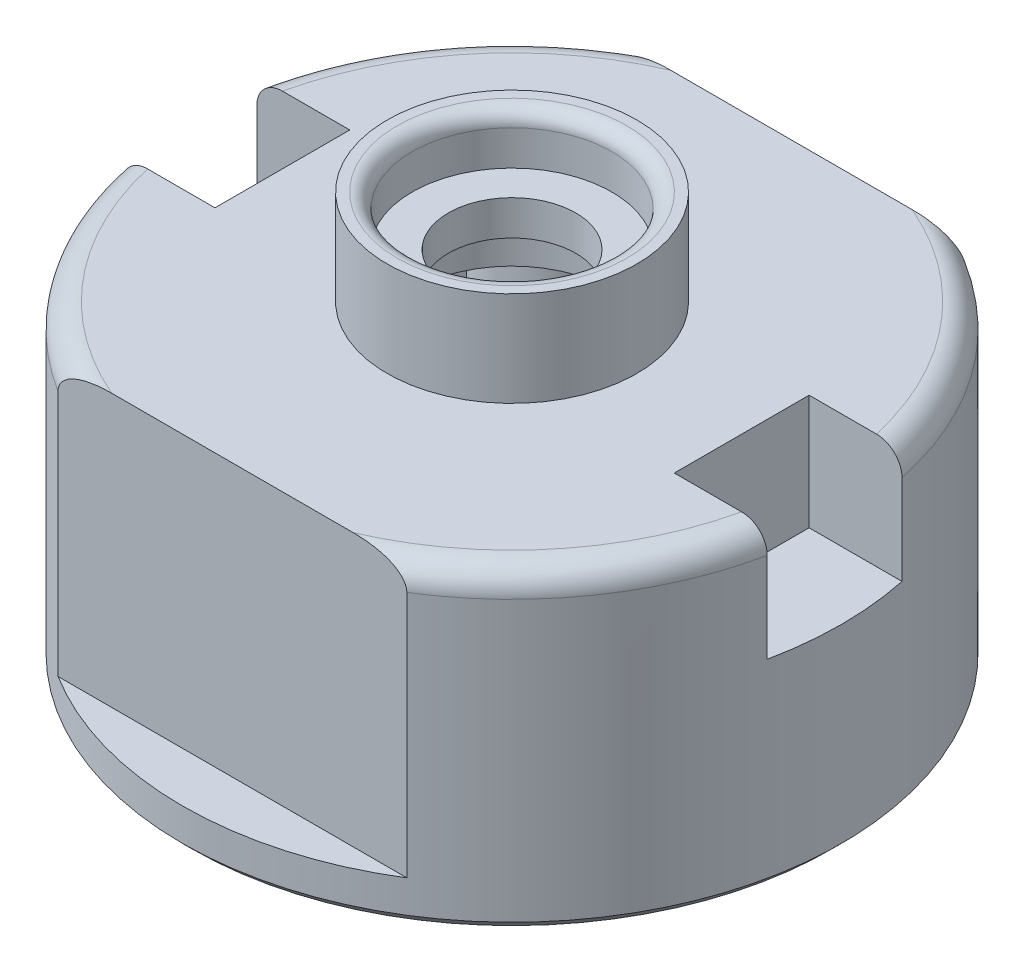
ISO-10303-21;
HEADER;
FILE_DESCRIPTION(('STEP AP214'),'2;1');
FILE_NAME('part.step','',(''),(''),'','','');
FILE_SCHEMA(('AUTOMOTIVE_DESIGN { 1 0 10303 214 1 1 1 1 }'));
ENDSEC;
DATA;
#1=APPLICATION_CONTEXT('core data for automotive mechanical design processes');
#2=APPLICATION_PROTOCOL_DEFINITION('international standard','automotive_design',2000,#1);
#3=PRODUCT_CONTEXT('',#1,'mechanical');
#4=PRODUCT('Part','Part','',(#3));
#5=PRODUCT_RELATED_PRODUCT_CATEGORY('part','',(#4));
#6=PRODUCT_DEFINITION_FORMATION('','',#4);
#7=PRODUCT_DEFINITION_CONTEXT('part definition',#1,'design');
#8=PRODUCT_DEFINITION('design','',#6,#7);
#9=PRODUCT_DEFINITION_SHAPE('','',#8);
#10=(LENGTH_UNIT() NAMED_UNIT(*) SI_UNIT(.MILLI.,.METRE.));
#11=(NAMED_UNIT(*) PLANE_ANGLE_UNIT() SI_UNIT($,.RADIAN.));
#12=(NAMED_UNIT(*) SI_UNIT($,.STERADIAN.) SOLID_ANGLE_UNIT());
#13=UNCERTAINTY_MEASURE_WITH_UNIT(LENGTH_MEASURE(1.E-05),#10,'distance_accuracy_value','');
#14=(GEOMETRIC_REPRESENTATION_CONTEXT(3) GLOBAL_UNCERTAINTY_ASSIGNED_CONTEXT((#13)) GLOBAL_UNIT_ASSIGNED_CONTEXT((#10,
#11,#12)) REPRESENTATION_CONTEXT('',''));
#15=CARTESIAN_POINT('',(0.,0.,0.));
#16=DIRECTION('',(0.,0.,1.));
#17=DIRECTION('',(1.,0.,0.));
#18=AXIS2_PLACEMENT_3D('',#15,#16,#17);
#19=CARTESIAN_POINT('',(0.,13.7878177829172,0.575122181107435));
#20=DIRECTION('',(0.,0.,-1.));
#21=DIRECTION('',(-1.,0.,0.));
#22=AXIS2_PLACEMENT_3D('',#19,#20,#21);
#23=PLANE('',#22);
#24=DIRECTION('',(0.,-1.,0.));
#25=VECTOR('',#24,1.);
#26=CARTESIAN_POINT('',(-10.8653558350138,9.6,0.575122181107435));
#27=LINE('',#26,#25);
#28=CARTESIAN_POINT('',(-10.8653558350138,8.89999999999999,0.575122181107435));
#29=VERTEX_POINT('',#28);
#30=CARTESIAN_POINT('',(-10.8653558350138,-0.399999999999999,0.575122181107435));
#31=VERTEX_POINT('',#30);
#32=EDGE_CURVE('E415',#29,#31,#27,.T.);
#33=ORIENTED_EDGE('',*,*,#32,.F.);
#34=CARTESIAN_POINT('',(-9.99461946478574,8.09999999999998,0.575122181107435));
#35=CARTESIAN_POINT('',(-10.1312785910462,8.22637586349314,0.575122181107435));
#36=CARTESIAN_POINT('',(-10.2681146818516,8.35256067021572,0.575122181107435));
#37=CARTESIAN_POINT('',(-10.5421840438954,8.60449464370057,0.575122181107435));
#38=CARTESIAN_POINT('',(-10.6794173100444,8.7302438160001,0.575122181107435));
#39=CARTESIAN_POINT('',(-10.9543281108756,8.98125654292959,0.575122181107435));
#40=CARTESIAN_POINT('',(-11.092005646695,9.10652009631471,0.575122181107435));
#41=CARTESIAN_POINT('',(-11.3678626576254,9.35649675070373,0.575122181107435));
#42=CARTESIAN_POINT('',(-11.506042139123,9.48120984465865,0.575122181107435));
#43=CARTESIAN_POINT('',(-11.6444998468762,9.60561385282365,0.575122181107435));
#44=B_SPLINE_CURVE_WITH_KNOTS('',3,(#34,#35,#36,#37,#38,#39,#40,#41,#42,#43),.UNSPECIFIED.,.F.,
.F.,(4,2,2,2,4),(0.,0.558407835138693,1.11680854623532,1.67521068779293,2.2336199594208),.UNSPECIFIED.);
#45=CARTESIAN_POINT('',(-11.6444998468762,9.60561385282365,0.575122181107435));
#46=VERTEX_POINT('',#45);
#47=EDGE_CURVE('E406',#29,#46,#44,.T.);
#48=ORIENTED_EDGE('',*,*,#47,.T.);
#49=DIRECTION('',(0.,-1.,0.));
#50=VECTOR('',#49,1.);
#51=CARTESIAN_POINT('',(-11.6444998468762,13.7878177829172,0.575122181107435));
#52=LINE('',#51,#50);
#53=CARTESIAN_POINT('',(-11.6444998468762,-0.399999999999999,0.575122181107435));
#54=VERTEX_POINT('',#53);
#55=EDGE_CURVE('E705',#46,#54,#52,.T.);
#56=ORIENTED_EDGE('',*,*,#55,.T.);
#57=DIRECTION('',(-1.,0.,0.));
#58=VECTOR('',#57,1.);
#59=CARTESIAN_POINT('',(0.,-0.399999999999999,0.575122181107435));
#60=LINE('',#59,#58);
#61=EDGE_CURVE('E55',#31,#54,#60,.T.);
#62=ORIENTED_EDGE('',*,*,#61,.F.);
#63=EDGE_LOOP('',(#33,#48,#56,#62));
#64=FACE_BOUND('',#63,.T.);
#65=ADVANCED_FACE('F39',(#64),#23,.F.);
#66=CARTESIAN_POINT('',(-13.700802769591,15.4618001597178,4.64680359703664));
#67=DIRECTION('',(0.,-1.,0.));
#68=DIRECTION('',(0.,0.,-1.));
#69=AXIS2_PLACEMENT_3D('',#66,#67,#68);
#70=CYLINDRICAL_SURFACE('',#69,2.45);
#71=CARTESIAN_POINT('',(-13.3007494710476,10.1,2.22968602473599));
#72=CARTESIAN_POINT('',(-13.2226304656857,10.0316842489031,2.24263945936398));
#73=CARTESIAN_POINT('',(-13.1462114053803,9.96216547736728,2.25915431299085));
#74=CARTESIAN_POINT('',(-12.9969164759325,9.82136072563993,2.29881839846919));
#75=CARTESIAN_POINT('',(-12.9240376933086,9.75007627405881,2.3219620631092));
#76=CARTESIAN_POINT('',(-12.7832127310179,9.60765545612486,2.37391055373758));
#77=CARTESIAN_POINT('',(-12.7151983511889,9.53654296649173,2.40259704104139));
#78=CARTESIAN_POINT('',(-12.5826742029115,9.39350339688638,2.46559406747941));
#79=CARTESIAN_POINT('',(-12.5181657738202,9.32157601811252,2.49990673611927));
#80=CARTESIAN_POINT('',(-12.3731160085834,9.15460256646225,2.58551818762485));
#81=CARTESIAN_POINT('',(-12.2939047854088,9.05939273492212,2.63876674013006));
#82=CARTESIAN_POINT('',(-12.142254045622,8.86890942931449,2.75405517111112));
#83=CARTESIAN_POINT('',(-12.0698148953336,8.77363595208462,2.81609552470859));
#84=CARTESIAN_POINT('',(-11.9304636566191,8.58116751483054,2.95033414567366));
#85=CARTESIAN_POINT('',(-11.8637449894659,8.48398724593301,3.02275513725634));
#86=CARTESIAN_POINT('',(-11.7388165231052,8.29087899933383,3.17613648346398));
#87=CARTESIAN_POINT('',(-11.680608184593,8.19495123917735,3.25709829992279));
#88=CARTESIAN_POINT('',(-11.6270672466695,8.09999999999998,3.34215001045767));
#89=B_SPLINE_CURVE_WITH_KNOTS('',3,(#71,#72,#73,#74,#75,#76,#77,#78,#79,#80,#81,#82,#83,#84,#85,
#86,#87,#88),.UNSPECIFIED.,.F.,.F.,(4,2,2,2,2,2,2,2,4),(0.,0.313602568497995,0.626942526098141,
0.934213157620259,1.24160036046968,1.645559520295,2.04954051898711,2.46405755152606,
2.87864564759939),.UNSPECIFIED.);
#90=CARTESIAN_POINT('',(-13.3007494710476,10.1,2.22968602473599));
#91=VERTEX_POINT('',#90);
#92=CARTESIAN_POINT('',(-12.1675227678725,8.89999999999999,2.73590003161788));
#93=VERTEX_POINT('',#92);
#94=EDGE_CURVE('E412',#91,#93,#89,.T.);
#95=ORIENTED_EDGE('',*,*,#94,.T.);
#96=DIRECTION('',(0.,-1.,0.));
#97=VECTOR('',#96,1.);
#98=CARTESIAN_POINT('',(-12.1675227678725,9.6,2.73590003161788));
#99=LINE('',#98,#97);
#100=CARTESIAN_POINT('',(-12.1675227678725,-0.399999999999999,2.73590003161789));
#101=VERTEX_POINT('',#100);
#102=EDGE_CURVE('E63',#93,#101,#99,.T.);
#103=ORIENTED_EDGE('',*,*,#102,.T.);
#104=CARTESIAN_POINT('',(-13.700802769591,-0.399999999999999,4.64680359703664));
#105=DIRECTION('',(0.,-1.,0.));
#106=DIRECTION('',(0.,0.,-1.));
#107=AXIS2_PLACEMENT_3D('',#104,#105,#106);
#108=CIRCLE('',#107,2.45);
#109=CARTESIAN_POINT('',(-16.1130720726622,-0.399999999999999,5.07512218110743));
#110=VERTEX_POINT('',#109);
#111=EDGE_CURVE('E556',#101,#110,#108,.F.);
#112=ORIENTED_EDGE('',*,*,#111,.T.);
#113=DIRECTION('',(0.,-1.,0.));
#114=VECTOR('',#113,1.);
#115=CARTESIAN_POINT('',(-16.1130720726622,15.4618001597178,5.07512218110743));
#116=LINE('',#115,#114);
#117=CARTESIAN_POINT('',(-16.1130720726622,9.1,5.07512218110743));
#118=VERTEX_POINT('',#117);
#119=EDGE_CURVE('E647',#118,#110,#116,.T.);
#120=ORIENTED_EDGE('',*,*,#119,.F.);
#121=CARTESIAN_POINT('',(-13.700802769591,9.5283185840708,4.64680359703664));
#122=DIRECTION('',(0.,0.707106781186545,0.70710678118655));
#123=DIRECTION('',(0.,-0.70710678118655,0.707106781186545));
#124=AXIS2_PLACEMENT_3D('',#121,#122,#123);
#125=ELLIPSE('',#124,3.4648232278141,2.45);
#126=CARTESIAN_POINT('',(-16.0831714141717,10.1,4.07512218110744));
#127=VERTEX_POINT('',#126);
#128=EDGE_CURVE('E1796',#118,#127,#125,.F.);
#129=ORIENTED_EDGE('',*,*,#128,.T.);
#130=CARTESIAN_POINT('',(-13.700802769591,10.1,4.64680359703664));
#131=DIRECTION('',(0.,1.,0.));
#132=DIRECTION('',(0.,0.,1.));
#133=AXIS2_PLACEMENT_3D('',#130,#131,#132);
#134=CIRCLE('',#133,2.45);
#135=EDGE_CURVE('E644',#127,#91,#134,.F.);
#136=ORIENTED_EDGE('',*,*,#135,.T.);
#137=EDGE_LOOP('',(#95,#103,#112,#120,#129,#136));
#138=FACE_BOUND('',#137,.T.);
#139=ADVANCED_FACE('F945',(#138),#70,.T.);
#140=CARTESIAN_POINT('',(-20.4444998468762,8.09999999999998,-3.72487781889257));
#141=DIRECTION('',(0.,-1.,0.));
#142=DIRECTION('',(0.,0.,-1.));
#143=AXIS2_PLACEMENT_3D('',#140,#141,#142);
#144=CONICAL_SURFACE('',#143,11.3,0.785398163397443);
#145=CARTESIAN_POINT('',(-20.4444998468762,8.89999999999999,-3.72487781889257));
#146=DIRECTION('',(0.,-1.,0.));
#147=DIRECTION('',(0.,0.,-1.));
#148=AXIS2_PLACEMENT_3D('',#145,#146,#147);
#149=CIRCLE('',#148,10.5);
#150=EDGE_CURVE('E11',#93,#29,#149,.F.);
#151=ORIENTED_EDGE('',*,*,#150,.F.);
#152=ORIENTED_EDGE('',*,*,#94,.F.);
#153=CARTESIAN_POINT('',(-20.4444998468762,10.1,-3.72487781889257));
#154=DIRECTION('',(0.,1.,0.));
#155=DIRECTION('',(0.,0.,1.));
#156=AXIS2_PLACEMENT_3D('',#153,#154,#155);
#157=CIRCLE('',#156,9.30000000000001);
#158=CARTESIAN_POINT('',(-11.6444998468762,10.1,-0.71655602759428));
#159=VERTEX_POINT('',#158);
#160=EDGE_CURVE('E1758',#159,#91,#157,.F.);
#161=ORIENTED_EDGE('',*,*,#160,.F.);
#162=CARTESIAN_POINT('',(-11.6444998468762,9.60561385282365,0.575122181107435));
#163=CARTESIAN_POINT('',(-11.6444998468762,9.65197613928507,0.469516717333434));
#164=CARTESIAN_POINT('',(-11.6444998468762,9.69718654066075,0.3634005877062));
#165=CARTESIAN_POINT('',(-11.6444998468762,9.7850729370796,0.150203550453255));
#166=CARTESIAN_POINT('',(-11.6444998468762,9.82775052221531,0.0431232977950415));
#167=CARTESIAN_POINT('',(-11.6444998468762,9.91040225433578,-0.17208529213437));
#168=CARTESIAN_POINT('',(-11.6444998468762,9.95037625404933,-0.280213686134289));
#169=CARTESIAN_POINT('',(-11.6444998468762,10.0274255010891,-0.497574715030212));
#170=CARTESIAN_POINT('',(-11.6444998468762,10.0644988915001,-0.606808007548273));
#171=CARTESIAN_POINT('',(-11.6444998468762,10.1,-0.71655602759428));
#172=B_SPLINE_CURVE_WITH_KNOTS('',3,(#162,#163,#164,#165,#166,#167,#168,#169,#170,#171),
.UNSPECIFIED.,.F.,.F.,(4,2,2,2,4),(0.,0.346002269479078,0.691784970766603,1.03758649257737,
1.38360760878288),.UNSPECIFIED.);
#173=EDGE_CURVE('E410',#46,#159,#172,.T.);
#174=ORIENTED_EDGE('',*,*,#173,.F.);
#175=ORIENTED_EDGE('',*,*,#47,.F.);
#176=EDGE_LOOP('',(#151,#152,#161,#174,#175));
#177=FACE_BOUND('',#176,.T.);
#178=ADVANCED_FACE('F407',(#177),#144,.F.);
#179=CARTESIAN_POINT('',(0.,13.7878177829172,-8.02487781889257));
#180=DIRECTION('',(0.,0.,-1.));
#181=DIRECTION('',(-1.,0.,0.));
#182=AXIS2_PLACEMENT_3D('',#179,#180,#181);
#183=PLANE('',#182);
#184=CARTESIAN_POINT('',(-11.6444998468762,9.60561385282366,-8.02487781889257));
#185=CARTESIAN_POINT('',(-11.506042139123,9.48120984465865,-8.02487781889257));
#186=CARTESIAN_POINT('',(-11.3678626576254,9.35649675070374,-8.02487781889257));
#187=CARTESIAN_POINT('',(-11.092005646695,9.10652009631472,-8.02487781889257));
#188=CARTESIAN_POINT('',(-10.9543281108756,8.98125654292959,-8.02487781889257));
#189=CARTESIAN_POINT('',(-10.6794173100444,8.73024381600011,-8.02487781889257));
#190=CARTESIAN_POINT('',(-10.5421840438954,8.60449464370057,-8.02487781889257));
#191=CARTESIAN_POINT('',(-10.2681146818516,8.35256067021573,-8.02487781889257));
#192=CARTESIAN_POINT('',(-10.1312785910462,8.22637586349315,-8.02487781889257));
#193=CARTESIAN_POINT('',(-9.99461946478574,8.09999999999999,-8.02487781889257));
#194=B_SPLINE_CURVE_WITH_KNOTS('',3,(#184,#185,#186,#187,#188,#189,#190,#191,#192,#193),
.UNSPECIFIED.,.F.,.F.,(4,2,2,2,4),(0.,0.55840927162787,1.11681141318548,1.6752121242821,
2.23361995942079),.UNSPECIFIED.);
#195=CARTESIAN_POINT('',(-11.6444998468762,9.60561385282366,-8.02487781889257));
#196=VERTEX_POINT('',#195);
#197=CARTESIAN_POINT('',(-10.8653558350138,8.89999999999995,-8.02487781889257));
#198=VERTEX_POINT('',#197);
#199=EDGE_CURVE('E413',#196,#198,#194,.T.);
#200=ORIENTED_EDGE('',*,*,#199,.T.);
#201=DIRECTION('',(0.,-1.,0.));
#202=VECTOR('',#201,1.);
#203=CARTESIAN_POINT('',(-10.8653558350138,9.6,-8.02487781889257));
#204=LINE('',#203,#202);
#205=CARTESIAN_POINT('',(-10.8653558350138,-0.399999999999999,-8.02487781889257));
#206=VERTEX_POINT('',#205);
#207=EDGE_CURVE('E429',#198,#206,#204,.T.);
#208=ORIENTED_EDGE('',*,*,#207,.T.);
#209=DIRECTION('',(-1.,0.,0.));
#210=VECTOR('',#209,1.);
#211=CARTESIAN_POINT('',(0.,-0.399999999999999,-8.02487781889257));
#212=LINE('',#211,#210);
#213=CARTESIAN_POINT('',(-11.6444998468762,-0.399999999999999,-8.02487781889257));
#214=VERTEX_POINT('',#213);
#215=EDGE_CURVE('E524',#206,#214,#212,.T.);
#216=ORIENTED_EDGE('',*,*,#215,.T.);
#217=DIRECTION('',(0.,-1.,0.));
#218=VECTOR('',#217,1.);
#219=CARTESIAN_POINT('',(-11.6444998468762,13.7878177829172,-8.02487781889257));
#220=LINE('',#219,#218);
#221=EDGE_CURVE('E689',#196,#214,#220,.T.);
#222=ORIENTED_EDGE('',*,*,#221,.F.);
#223=EDGE_LOOP('',(#200,#208,#216,#222));
#224=FACE_BOUND('',#223,.T.);
#225=ADVANCED_FACE('F954',(#224),#183,.T.);
#226=CARTESIAN_POINT('',(-13.700802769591,15.4618001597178,-12.0965592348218));
#227=DIRECTION('',(0.,-1.,0.));
#228=DIRECTION('',(0.,0.,-1.));
#229=AXIS2_PLACEMENT_3D('',#226,#227,#228);
#230=CYLINDRICAL_SURFACE('',#229,2.45);
#231=CARTESIAN_POINT('',(-13.700802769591,-0.399999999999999,-12.0965592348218));
#232=DIRECTION('',(0.,-1.,0.));
#233=DIRECTION('',(0.,0.,-1.));
#234=AXIS2_PLACEMENT_3D('',#231,#232,#233);
#235=CIRCLE('',#234,2.45);
#236=CARTESIAN_POINT('',(-16.1130720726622,-0.399999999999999,-12.5248778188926));
#237=VERTEX_POINT('',#236);
#238=CARTESIAN_POINT('',(-12.1675227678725,-0.399999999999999,-10.185655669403));
#239=VERTEX_POINT('',#238);
#240=EDGE_CURVE('E518',#237,#239,#235,.F.);
#241=ORIENTED_EDGE('',*,*,#240,.T.);
#242=DIRECTION('',(0.,-1.,0.));
#243=VECTOR('',#242,1.);
#244=CARTESIAN_POINT('',(-12.1675227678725,9.6,-10.185655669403));
#245=LINE('',#244,#243);
#246=CARTESIAN_POINT('',(-12.1675227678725,8.9,-10.185655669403));
#247=VERTEX_POINT('',#246);
#248=EDGE_CURVE('E425',#247,#239,#245,.T.);
#249=ORIENTED_EDGE('',*,*,#248,.F.);
#250=CARTESIAN_POINT('',(-11.6270672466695,8.09999999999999,-10.7919056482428));
#251=CARTESIAN_POINT('',(-11.6797024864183,8.19334752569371,-10.7082901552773));
#252=CARTESIAN_POINT('',(-11.7368507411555,8.28763906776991,-10.628627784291));
#253=CARTESIAN_POINT('',(-11.8593850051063,8.47744008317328,-10.4775568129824));
#254=CARTESIAN_POINT('',(-11.9247692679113,8.57294929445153,-10.4061464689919));
#255=CARTESIAN_POINT('',(-12.0612835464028,8.76216240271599,-10.2735682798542));
#256=CARTESIAN_POINT('',(-12.1322292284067,8.85585179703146,-10.2121891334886));
#257=CARTESIAN_POINT('',(-12.2806986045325,9.04320348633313,-10.0979143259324));
#258=CARTESIAN_POINT('',(-12.3582221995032,9.13686578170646,-10.0450185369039));
#259=CARTESIAN_POINT('',(-12.5025255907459,9.30394043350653,-9.95829919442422));
#260=CARTESIAN_POINT('',(-12.5681537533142,9.37748435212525,-9.92280160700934));
#261=CARTESIAN_POINT('',(-12.7030813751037,9.52374855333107,-9.85766211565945));
#262=CARTESIAN_POINT('',(-12.7723794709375,9.59646912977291,-9.82801805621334));
#263=CARTESIAN_POINT('',(-12.9159831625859,9.74213698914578,-9.77437046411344));
#264=CARTESIAN_POINT('',(-12.9903615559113,9.81505927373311,-9.75049272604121));
#265=CARTESIAN_POINT('',(-13.1428157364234,9.95907370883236,-9.70964679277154));
#266=CARTESIAN_POINT('',(-13.220894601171,10.0301642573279,-9.69268446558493));
#267=CARTESIAN_POINT('',(-13.3007494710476,10.1,-9.67944166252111));
#268=B_SPLINE_CURVE_WITH_KNOTS('',3,(#250,#251,#252,#253,#254,#255,#256,#257,#258,#259,#260,
#261,#262,#263,#264,#265,#266,#267),.UNSPECIFIED.,.F.,.F.,(4,2,2,2,2,2,2,2,4),(0.,
0.40759104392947,0.815095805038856,1.21242087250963,1.60973995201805,1.92382197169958,
2.23778811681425,2.55808535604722,2.87865381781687),.UNSPECIFIED.);
#269=CARTESIAN_POINT('',(-13.3007494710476,10.1,-9.67944166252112));
#270=VERTEX_POINT('',#269);
#271=EDGE_CURVE('E1746',#247,#270,#268,.T.);
#272=ORIENTED_EDGE('',*,*,#271,.T.);
#273=CARTESIAN_POINT('',(-13.700802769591,10.1,-12.0965592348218));
#274=DIRECTION('',(0.,1.,0.));
#275=DIRECTION('',(0.,0.,1.));
#276=AXIS2_PLACEMENT_3D('',#273,#274,#275);
#277=CIRCLE('',#276,2.45);
#278=CARTESIAN_POINT('',(-16.0831714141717,10.1,-11.5248778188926));
#279=VERTEX_POINT('',#278);
#280=EDGE_CURVE('E631',#270,#279,#277,.F.);
#281=ORIENTED_EDGE('',*,*,#280,.T.);
#282=CARTESIAN_POINT('',(-13.700802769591,9.5283185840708,-12.0965592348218));
#283=DIRECTION('',(0.,-0.70710678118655,0.707106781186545));
#284=DIRECTION('',(0.,-0.707106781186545,-0.70710678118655));
#285=AXIS2_PLACEMENT_3D('',#282,#283,#284);
#286=ELLIPSE('',#285,3.46482322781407,2.45);
#287=CARTESIAN_POINT('',(-16.1130720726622,9.1,-12.5248778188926));
#288=VERTEX_POINT('',#287);
#289=EDGE_CURVE('E1806',#279,#288,#286,.T.);
#290=ORIENTED_EDGE('',*,*,#289,.T.);
#291=DIRECTION('',(0.,-1.,0.));
#292=VECTOR('',#291,1.);
#293=CARTESIAN_POINT('',(-16.1130720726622,15.4618001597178,-12.5248778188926));
#294=LINE('',#293,#292);
#295=EDGE_CURVE('E633',#288,#237,#294,.T.);
#296=ORIENTED_EDGE('',*,*,#295,.T.);
#297=EDGE_LOOP('',(#241,#249,#272,#281,#290,#296));
#298=FACE_BOUND('',#297,.T.);
#299=ADVANCED_FACE('F1741',(#298),#230,.T.);
#300=CARTESIAN_POINT('',(-20.4444998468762,8.09999999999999,-3.72487781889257));
#301=DIRECTION('',(0.,-1.,0.));
#302=DIRECTION('',(0.,0.,-1.));
#303=AXIS2_PLACEMENT_3D('',#300,#301,#302);
#304=CONICAL_SURFACE('',#303,11.3,0.785398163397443);
#305=CARTESIAN_POINT('',(-20.4444998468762,8.9,-3.72487781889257));
#306=DIRECTION('',(0.,-1.,0.));
#307=DIRECTION('',(0.,0.,-1.));
#308=AXIS2_PLACEMENT_3D('',#305,#306,#307);
#309=CIRCLE('',#308,10.5);
#310=EDGE_CURVE('E48',#198,#247,#309,.F.);
#311=ORIENTED_EDGE('',*,*,#310,.F.);
#312=ORIENTED_EDGE('',*,*,#199,.F.);
#313=CARTESIAN_POINT('',(-11.6444998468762,10.1,-6.73319961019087));
#314=CARTESIAN_POINT('',(-11.6444998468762,10.0644988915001,-6.84294763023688));
#315=CARTESIAN_POINT('',(-11.6444998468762,10.0274255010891,-6.95218092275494));
#316=CARTESIAN_POINT('',(-11.6444998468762,9.95037625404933,-7.16954195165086));
#317=CARTESIAN_POINT('',(-11.6444998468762,9.91040225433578,-7.27767034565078));
#318=CARTESIAN_POINT('',(-11.6444998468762,9.82775052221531,-7.49287893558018));
#319=CARTESIAN_POINT('',(-11.6444998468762,9.7850729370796,-7.59995918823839));
#320=CARTESIAN_POINT('',(-11.6444998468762,9.69718654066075,-7.81315622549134));
#321=CARTESIAN_POINT('',(-11.6444998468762,9.65197613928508,-7.91927235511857));
#322=CARTESIAN_POINT('',(-11.6444998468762,9.60561385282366,-8.02487781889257));
#323=B_SPLINE_CURVE_WITH_KNOTS('',3,(#313,#314,#315,#316,#317,#318,#319,#320,#321,#322),
.UNSPECIFIED.,.F.,.F.,(4,2,2,2,4),(0.,0.346021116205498,0.691822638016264,1.03760533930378,
1.38360760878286),.UNSPECIFIED.);
#324=CARTESIAN_POINT('',(-11.6444998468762,10.1,-6.73319961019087));
#325=VERTEX_POINT('',#324);
#326=EDGE_CURVE('E996',#325,#196,#323,.T.);
#327=ORIENTED_EDGE('',*,*,#326,.F.);
#328=CARTESIAN_POINT('',(-20.4444998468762,10.1,-3.72487781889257));
#329=DIRECTION('',(0.,1.,0.));
#330=DIRECTION('',(0.,0.,1.));
#331=AXIS2_PLACEMENT_3D('',#328,#329,#330);
#332=CIRCLE('',#331,9.30000000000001);
#333=EDGE_CURVE('E997',#270,#325,#332,.F.);
#334=ORIENTED_EDGE('',*,*,#333,.F.);
#335=ORIENTED_EDGE('',*,*,#271,.F.);
#336=EDGE_LOOP('',(#311,#312,#327,#334,#335));
#337=FACE_BOUND('',#336,.T.);
#338=ADVANCED_FACE('F985',(#337),#304,.F.);
#339=CARTESIAN_POINT('',(0.,13.7878177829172,-8.02487781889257));
#340=DIRECTION('',(0.,0.,-1.));
#341=DIRECTION('',(-1.,0.,0.));
#342=AXIS2_PLACEMENT_3D('',#339,#340,#341);
#343=PLANE('',#342);
#344=DIRECTION('',(-1.,0.,0.));
#345=VECTOR('',#344,1.);
#346=CARTESIAN_POINT('',(0.,-0.399999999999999,-8.02487781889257));
#347=LINE('',#346,#345);
#348=CARTESIAN_POINT('',(-29.2444998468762,-0.399999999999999,-8.02487781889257));
#349=VERTEX_POINT('',#348);
#350=CARTESIAN_POINT('',(-30.0236438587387,-0.399999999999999,-8.02487781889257));
#351=VERTEX_POINT('',#350);
#352=EDGE_CURVE('E520',#349,#351,#347,.T.);
#353=ORIENTED_EDGE('',*,*,#352,.T.);
#354=DIRECTION('',(0.,-1.,0.));
#355=VECTOR('',#354,1.);
#356=CARTESIAN_POINT('',(-30.0236438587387,9.6,-8.02487781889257));
#357=LINE('',#356,#355);
#358=CARTESIAN_POINT('',(-30.0236438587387,8.89999999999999,-8.02487781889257));
#359=VERTEX_POINT('',#358);
#360=EDGE_CURVE('E436',#359,#351,#357,.T.);
#361=ORIENTED_EDGE('',*,*,#360,.F.);
#362=CARTESIAN_POINT('',(-30.8943802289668,8.09999999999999,-8.02487781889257));
#363=CARTESIAN_POINT('',(-30.7577211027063,8.22637586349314,-8.02487781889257));
#364=CARTESIAN_POINT('',(-30.6208850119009,8.35256067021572,-8.02487781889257));
#365=CARTESIAN_POINT('',(-30.3468156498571,8.60449464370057,-8.02487781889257));
#366=CARTESIAN_POINT('',(-30.2095823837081,8.7302438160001,-8.02487781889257));
#367=CARTESIAN_POINT('',(-29.9346715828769,8.98125654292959,-8.02487781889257));
#368=CARTESIAN_POINT('',(-29.7969940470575,9.10652009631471,-8.02487781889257));
#369=CARTESIAN_POINT('',(-29.5211370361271,9.35649675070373,-8.02487781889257));
#370=CARTESIAN_POINT('',(-29.3829575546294,9.48120984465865,-8.02487781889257));
#371=CARTESIAN_POINT('',(-29.2444998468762,9.60561385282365,-8.02487781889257));
#372=B_SPLINE_CURVE_WITH_KNOTS('',3,(#362,#363,#364,#365,#366,#367,#368,#369,#370,#371),
.UNSPECIFIED.,.F.,.F.,(4,2,2,2,4),(0.,0.55840783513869,1.11680854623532,1.67521068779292,
2.2336199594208),.UNSPECIFIED.);
#373=CARTESIAN_POINT('',(-29.2444998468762,9.60561385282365,-8.02487781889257));
#374=VERTEX_POINT('',#373);
#375=EDGE_CURVE('E1024',#359,#374,#372,.T.);
#376=ORIENTED_EDGE('',*,*,#375,.T.);
#377=DIRECTION('',(0.,-1.,0.));
#378=VECTOR('',#377,1.);
#379=CARTESIAN_POINT('',(-29.2444998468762,13.7878177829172,-8.02487781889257));
#380=LINE('',#379,#378);
#381=EDGE_CURVE('E710',#374,#349,#380,.T.);
#382=ORIENTED_EDGE('',*,*,#381,.T.);
#383=EDGE_LOOP('',(#353,#361,#376,#382));
#384=FACE_BOUND('',#383,.T.);
#385=ADVANCED_FACE('F1014',(#384),#343,.T.);
#386=CARTESIAN_POINT('',(-27.1881969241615,15.4618001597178,-12.0965592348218));
#387=DIRECTION('',(0.,-1.,0.));
#388=DIRECTION('',(0.,0.,-1.));
#389=AXIS2_PLACEMENT_3D('',#386,#387,#388);
#390=CYLINDRICAL_SURFACE('',#389,2.45);
#391=CARTESIAN_POINT('',(-27.5882502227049,10.1,-9.67944166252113));
#392=CARTESIAN_POINT('',(-27.6663692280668,10.0316842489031,-9.69239509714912));
#393=CARTESIAN_POINT('',(-27.7427882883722,9.96216547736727,-9.70890995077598));
#394=CARTESIAN_POINT('',(-27.89208321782,9.82136072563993,-9.74857403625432));
#395=CARTESIAN_POINT('',(-27.9649620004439,9.75007627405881,-9.77171770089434));
#396=CARTESIAN_POINT('',(-28.1057869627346,9.60765545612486,-9.82366619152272));
#397=CARTESIAN_POINT('',(-28.1738013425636,9.53654296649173,-9.85235267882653));
#398=CARTESIAN_POINT('',(-28.306325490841,9.39350339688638,-9.91534970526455));
#399=CARTESIAN_POINT('',(-28.3708339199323,9.32157601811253,-9.9496623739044));
#400=CARTESIAN_POINT('',(-28.5158836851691,9.15460256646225,-10.03527382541));
#401=CARTESIAN_POINT('',(-28.5950949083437,9.05939273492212,-10.0885223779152));
#402=CARTESIAN_POINT('',(-28.7467456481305,8.86890942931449,-10.2038108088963));
#403=CARTESIAN_POINT('',(-28.8191847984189,8.77363595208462,-10.2658511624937));
#404=CARTESIAN_POINT('',(-28.9585360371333,8.58116751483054,-10.4000897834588));
#405=CARTESIAN_POINT('',(-29.0252547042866,8.48398724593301,-10.4725107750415));
#406=CARTESIAN_POINT('',(-29.1501831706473,8.29087899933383,-10.6258921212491));
#407=CARTESIAN_POINT('',(-29.2083915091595,8.19495123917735,-10.7068539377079));
#408=CARTESIAN_POINT('',(-29.261932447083,8.09999999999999,-10.7919056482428));
#409=B_SPLINE_CURVE_WITH_KNOTS('',3,(#391,#392,#393,#394,#395,#396,#397,#398,#399,#400,#401,
#402,#403,#404,#405,#406,#407,#408),.UNSPECIFIED.,.F.,.F.,(4,2,2,2,2,2,2,2,4),(0.,
0.313602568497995,0.626942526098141,0.93421315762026,1.24160036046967,1.645559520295,
2.04954051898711,2.46405755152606,2.87864564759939),.UNSPECIFIED.);
#410=CARTESIAN_POINT('',(-27.5882502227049,10.1,-9.67944166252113));
#411=VERTEX_POINT('',#410);
#412=CARTESIAN_POINT('',(-28.72147692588,8.89999999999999,-10.185655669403));
#413=VERTEX_POINT('',#412);
#414=EDGE_CURVE('E1031',#411,#413,#409,.T.);
#415=ORIENTED_EDGE('',*,*,#414,.T.);
#416=DIRECTION('',(0.,-1.,0.));
#417=VECTOR('',#416,1.);
#418=CARTESIAN_POINT('',(-28.72147692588,9.6,-10.185655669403));
#419=LINE('',#418,#417);
#420=CARTESIAN_POINT('',(-28.72147692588,-0.399999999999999,-10.185655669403));
#421=VERTEX_POINT('',#420);
#422=EDGE_CURVE('E437',#413,#421,#419,.T.);
#423=ORIENTED_EDGE('',*,*,#422,.T.);
#424=CARTESIAN_POINT('',(-27.1881969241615,-0.399999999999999,-12.0965592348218));
#425=DIRECTION('',(0.,-1.,0.));
#426=DIRECTION('',(0.,0.,-1.));
#427=AXIS2_PLACEMENT_3D('',#424,#425,#426);
#428=CIRCLE('',#427,2.45);
#429=CARTESIAN_POINT('',(-24.7759276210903,-0.399999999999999,-12.5248778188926));
#430=VERTEX_POINT('',#429);
#431=EDGE_CURVE('E513',#421,#430,#428,.F.);
#432=ORIENTED_EDGE('',*,*,#431,.T.);
#433=DIRECTION('',(0.,-1.,0.));
#434=VECTOR('',#433,1.);
#435=CARTESIAN_POINT('',(-24.7759276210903,15.4618001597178,-12.5248778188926));
#436=LINE('',#435,#434);
#437=CARTESIAN_POINT('',(-24.7759276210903,9.1,-12.5248778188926));
#438=VERTEX_POINT('',#437);
#439=EDGE_CURVE('E620',#438,#430,#436,.T.);
#440=ORIENTED_EDGE('',*,*,#439,.F.);
#441=CARTESIAN_POINT('',(-27.1881969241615,9.5283185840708,-12.0965592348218));
#442=DIRECTION('',(0.,-0.70710678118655,0.707106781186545));
#443=DIRECTION('',(0.,-0.707106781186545,-0.70710678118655));
#444=AXIS2_PLACEMENT_3D('',#441,#442,#443);
#445=ELLIPSE('',#444,3.46482322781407,2.45);
#446=CARTESIAN_POINT('',(-24.8058282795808,10.1,-11.5248778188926));
#447=VERTEX_POINT('',#446);
#448=EDGE_CURVE('E1754',#438,#447,#445,.T.);
#449=ORIENTED_EDGE('',*,*,#448,.T.);
#450=CARTESIAN_POINT('',(-27.1881969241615,10.1,-12.0965592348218));
#451=DIRECTION('',(0.,1.,0.));
#452=DIRECTION('',(0.,0.,1.));
#453=AXIS2_PLACEMENT_3D('',#450,#451,#452);
#454=CIRCLE('',#453,2.45);
#455=EDGE_CURVE('E617',#447,#411,#454,.F.);
#456=ORIENTED_EDGE('',*,*,#455,.T.);
#457=EDGE_LOOP('',(#415,#423,#432,#440,#449,#456));
#458=FACE_BOUND('',#457,.T.);
#459=ADVANCED_FACE('F1018',(#458),#390,.T.);
#460=CARTESIAN_POINT('',(-20.4444998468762,8.09999999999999,-3.72487781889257));
#461=DIRECTION('',(0.,-1.,0.));
#462=DIRECTION('',(0.,0.,-1.));
#463=AXIS2_PLACEMENT_3D('',#460,#461,#462);
#464=CONICAL_SURFACE('',#463,11.3,0.785398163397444);
#465=CARTESIAN_POINT('',(-20.4444998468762,8.9,-3.72487781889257));
#466=DIRECTION('',(0.,-1.,0.));
#467=DIRECTION('',(0.,0.,-1.));
#468=AXIS2_PLACEMENT_3D('',#465,#466,#467);
#469=CIRCLE('',#468,10.5);
#470=EDGE_CURVE('E1824',#413,#359,#469,.F.);
#471=ORIENTED_EDGE('',*,*,#470,.F.);
#472=ORIENTED_EDGE('',*,*,#414,.F.);
#473=CARTESIAN_POINT('',(-20.4444998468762,10.1,-3.72487781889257));
#474=DIRECTION('',(0.,1.,0.));
#475=DIRECTION('',(0.,0.,1.));
#476=AXIS2_PLACEMENT_3D('',#473,#474,#475);
#477=CIRCLE('',#476,9.3);
#478=CARTESIAN_POINT('',(-29.2444998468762,10.1,-6.73319961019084));
#479=VERTEX_POINT('',#478);
#480=EDGE_CURVE('E1753',#479,#411,#477,.F.);
#481=ORIENTED_EDGE('',*,*,#480,.F.);
#482=CARTESIAN_POINT('',(-29.2444998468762,9.60561385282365,-8.02487781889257));
#483=CARTESIAN_POINT('',(-29.2444998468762,9.65197613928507,-7.91927235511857));
#484=CARTESIAN_POINT('',(-29.2444998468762,9.69718654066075,-7.81315622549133));
#485=CARTESIAN_POINT('',(-29.2444998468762,9.78507293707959,-7.59995918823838));
#486=CARTESIAN_POINT('',(-29.2444998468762,9.82775052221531,-7.49287893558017));
#487=CARTESIAN_POINT('',(-29.2444998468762,9.91040225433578,-7.27767034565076));
#488=CARTESIAN_POINT('',(-29.2444998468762,9.95037625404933,-7.16954195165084));
#489=CARTESIAN_POINT('',(-29.2444998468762,10.0274255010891,-6.95218092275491));
#490=CARTESIAN_POINT('',(-29.2444998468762,10.0644988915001,-6.84294763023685));
#491=CARTESIAN_POINT('',(-29.2444998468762,10.1,-6.73319961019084));
#492=B_SPLINE_CURVE_WITH_KNOTS('',3,(#482,#483,#484,#485,#486,#487,#488,#489,#490,#491),
.UNSPECIFIED.,.F.,.F.,(4,2,2,2,4),(0.,0.34600226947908,0.691784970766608,1.03758649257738,
1.38360760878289),.UNSPECIFIED.);
#493=EDGE_CURVE('E1054',#374,#479,#492,.T.);
#494=ORIENTED_EDGE('',*,*,#493,.F.);
#495=ORIENTED_EDGE('',*,*,#375,.F.);
#496=EDGE_LOOP('',(#471,#472,#481,#494,#495));
#497=FACE_BOUND('',#496,.T.);
#498=ADVANCED_FACE('F1045',(#497),#464,.F.);
#499=CARTESIAN_POINT('',(0.,13.7878177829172,0.575122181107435));
#500=DIRECTION('',(0.,0.,-1.));
#501=DIRECTION('',(-1.,0.,0.));
#502=AXIS2_PLACEMENT_3D('',#499,#500,#501);
#503=PLANE('',#502);
#504=DIRECTION('',(0.,-1.,0.));
#505=VECTOR('',#504,1.);
#506=CARTESIAN_POINT('',(-30.0236438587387,9.6,0.575122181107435));
#507=LINE('',#506,#505);
#508=CARTESIAN_POINT('',(-30.0236438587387,8.89999999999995,0.575122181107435));
#509=VERTEX_POINT('',#508);
#510=CARTESIAN_POINT('',(-30.0236438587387,-0.399999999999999,0.575122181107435));
#511=VERTEX_POINT('',#510);
#512=EDGE_CURVE('E445',#509,#511,#507,.T.);
#513=ORIENTED_EDGE('',*,*,#512,.T.);
#514=DIRECTION('',(-1.,0.,0.));
#515=VECTOR('',#514,1.);
#516=CARTESIAN_POINT('',(0.,-0.399999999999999,0.575122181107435));
#517=LINE('',#516,#515);
#518=CARTESIAN_POINT('',(-29.2444998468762,-0.399999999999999,0.575122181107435));
#519=VERTEX_POINT('',#518);
#520=EDGE_CURVE('E547',#519,#511,#517,.T.);
#521=ORIENTED_EDGE('',*,*,#520,.F.);
#522=DIRECTION('',(0.,-1.,0.));
#523=VECTOR('',#522,1.);
#524=CARTESIAN_POINT('',(-29.2444998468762,13.7878177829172,0.575122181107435));
#525=LINE('',#524,#523);
#526=CARTESIAN_POINT('',(-29.2444998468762,9.60561385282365,0.575122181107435));
#527=VERTEX_POINT('',#526);
#528=EDGE_CURVE('E715',#527,#519,#525,.T.);
#529=ORIENTED_EDGE('',*,*,#528,.F.);
#530=CARTESIAN_POINT('',(-29.2444998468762,9.60561385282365,0.575122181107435));
#531=CARTESIAN_POINT('',(-29.3829575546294,9.48120984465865,0.575122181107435));
#532=CARTESIAN_POINT('',(-29.5211370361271,9.35649675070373,0.575122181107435));
#533=CARTESIAN_POINT('',(-29.7969940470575,9.10652009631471,0.575122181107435));
#534=CARTESIAN_POINT('',(-29.9346715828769,8.98125654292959,0.575122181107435));
#535=CARTESIAN_POINT('',(-30.2095823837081,8.7302438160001,0.575122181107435));
#536=CARTESIAN_POINT('',(-30.3468156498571,8.60449464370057,0.575122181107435));
#537=CARTESIAN_POINT('',(-30.6208850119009,8.35256067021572,0.575122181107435));
#538=CARTESIAN_POINT('',(-30.7577211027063,8.22637586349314,0.575122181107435));
#539=CARTESIAN_POINT('',(-30.8943802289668,8.09999999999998,0.575122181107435));
#540=B_SPLINE_CURVE_WITH_KNOTS('',3,(#530,#531,#532,#533,#534,#535,#536,#537,#538,#539),
.UNSPECIFIED.,.F.,.F.,(4,2,2,2,4),(0.,0.558409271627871,1.11681141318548,1.67521212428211,
2.2336199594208),.UNSPECIFIED.);
#541=EDGE_CURVE('E1032',#527,#509,#540,.T.);
#542=ORIENTED_EDGE('',*,*,#541,.T.);
#543=EDGE_LOOP('',(#513,#521,#529,#542));
#544=FACE_BOUND('',#543,.T.);
#545=ADVANCED_FACE('F1020',(#544),#503,.F.);
#546=CARTESIAN_POINT('',(-27.1881969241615,15.4618001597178,4.64680359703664));
#547=DIRECTION('',(0.,-1.,0.));
#548=DIRECTION('',(0.,0.,-1.));
#549=AXIS2_PLACEMENT_3D('',#546,#547,#548);
#550=CYLINDRICAL_SURFACE('',#549,2.45);
#551=CARTESIAN_POINT('',(-27.1881969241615,-0.399999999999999,4.64680359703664));
#552=DIRECTION('',(0.,-1.,0.));
#553=DIRECTION('',(0.,0.,-1.));
#554=AXIS2_PLACEMENT_3D('',#551,#552,#553);
#555=CIRCLE('',#554,2.45);
#556=CARTESIAN_POINT('',(-24.7759276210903,-0.399999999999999,5.07512218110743));
#557=VERTEX_POINT('',#556);
#558=CARTESIAN_POINT('',(-28.72147692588,-0.399999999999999,2.73590003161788));
#559=VERTEX_POINT('',#558);
#560=EDGE_CURVE('E550',#557,#559,#555,.F.);
#561=ORIENTED_EDGE('',*,*,#560,.T.);
#562=DIRECTION('',(0.,-1.,0.));
#563=VECTOR('',#562,1.);
#564=CARTESIAN_POINT('',(-28.72147692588,9.6,2.73590003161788));
#565=LINE('',#564,#563);
#566=CARTESIAN_POINT('',(-28.72147692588,8.89999999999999,2.73590003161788));
#567=VERTEX_POINT('',#566);
#568=EDGE_CURVE('E444',#567,#559,#565,.T.);
#569=ORIENTED_EDGE('',*,*,#568,.F.);
#570=CARTESIAN_POINT('',(-29.261932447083,8.09999999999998,3.34215001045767));
#571=CARTESIAN_POINT('',(-29.2092972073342,8.1933475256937,3.25853451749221));
#572=CARTESIAN_POINT('',(-29.152148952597,8.2876390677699,3.17887214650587));
#573=CARTESIAN_POINT('',(-29.0296146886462,8.47744008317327,3.02780117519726));
#574=CARTESIAN_POINT('',(-28.9642304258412,8.57294929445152,2.95639083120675));
#575=CARTESIAN_POINT('',(-28.8277161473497,8.76216240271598,2.82381264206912));
#576=CARTESIAN_POINT('',(-28.7567704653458,8.85585179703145,2.76243349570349));
#577=CARTESIAN_POINT('',(-28.60830108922,9.04320348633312,2.6481586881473));
#578=CARTESIAN_POINT('',(-28.5307774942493,9.13686578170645,2.59526289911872));
#579=CARTESIAN_POINT('',(-28.3864741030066,9.30394043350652,2.50854355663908));
#580=CARTESIAN_POINT('',(-28.3208459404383,9.37748435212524,2.47304596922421));
#581=CARTESIAN_POINT('',(-28.1859183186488,9.52374855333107,2.40790647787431));
#582=CARTESIAN_POINT('',(-28.116620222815,9.59646912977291,2.37826241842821));
#583=CARTESIAN_POINT('',(-27.9730165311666,9.74213698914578,2.32461482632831));
#584=CARTESIAN_POINT('',(-27.8986381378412,9.81505927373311,2.30073708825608));
#585=CARTESIAN_POINT('',(-27.7461839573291,9.95907370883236,2.2598911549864));
#586=CARTESIAN_POINT('',(-27.6681050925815,10.0301642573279,2.24292882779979));
#587=CARTESIAN_POINT('',(-27.5882502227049,10.1,2.22968602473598));
#588=B_SPLINE_CURVE_WITH_KNOTS('',3,(#570,#571,#572,#573,#574,#575,#576,#577,#578,#579,#580,
#581,#582,#583,#584,#585,#586,#587),.UNSPECIFIED.,.F.,.F.,(4,2,2,2,2,2,2,2,4),(0.,
0.407591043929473,0.815095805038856,1.21242087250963,1.60973995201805,1.92382197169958,
2.23778811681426,2.55808535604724,2.87865381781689),.UNSPECIFIED.);
#589=CARTESIAN_POINT('',(-27.5882502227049,10.1,2.22968602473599));
#590=VERTEX_POINT('',#589);
#591=EDGE_CURVE('E1061',#567,#590,#588,.T.);
#592=ORIENTED_EDGE('',*,*,#591,.T.);
#593=CARTESIAN_POINT('',(-27.1881969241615,10.1,4.64680359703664));
#594=DIRECTION('',(0.,1.,0.));
#595=DIRECTION('',(0.,0.,1.));
#596=AXIS2_PLACEMENT_3D('',#593,#594,#595);
#597=CIRCLE('',#596,2.45);
#598=CARTESIAN_POINT('',(-24.8058282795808,10.1,4.07512218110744));
#599=VERTEX_POINT('',#598);
#600=EDGE_CURVE('E659',#590,#599,#597,.F.);
#601=ORIENTED_EDGE('',*,*,#600,.T.);
#602=CARTESIAN_POINT('',(-27.1881969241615,9.5283185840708,4.64680359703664));
#603=DIRECTION('',(0.,0.707106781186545,0.70710678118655));
#604=DIRECTION('',(0.,-0.70710678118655,0.707106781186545));
#605=AXIS2_PLACEMENT_3D('',#602,#603,#604);
#606=ELLIPSE('',#605,3.4648232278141,2.45);
#607=CARTESIAN_POINT('',(-24.7759276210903,9.1,5.07512218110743));
#608=VERTEX_POINT('',#607);
#609=EDGE_CURVE('E1804',#599,#608,#606,.F.);
#610=ORIENTED_EDGE('',*,*,#609,.T.);
#611=DIRECTION('',(0.,-1.,0.));
#612=VECTOR('',#611,1.);
#613=CARTESIAN_POINT('',(-24.7759276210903,15.4618001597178,5.07512218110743));
#614=LINE('',#613,#612);
#615=EDGE_CURVE('E661',#608,#557,#614,.T.);
#616=ORIENTED_EDGE('',*,*,#615,.T.);
#617=EDGE_LOOP('',(#561,#569,#592,#601,#610,#616));
#618=FACE_BOUND('',#617,.T.);
#619=ADVANCED_FACE('F1735',(#618),#550,.T.);
#620=CARTESIAN_POINT('',(-20.4444998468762,8.09999999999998,-3.72487781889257));
#621=DIRECTION('',(0.,-1.,0.));
#622=DIRECTION('',(0.,0.,-1.));
#623=AXIS2_PLACEMENT_3D('',#620,#621,#622);
#624=CONICAL_SURFACE('',#623,11.3,0.785398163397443);
#625=CARTESIAN_POINT('',(-20.4444998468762,8.89999999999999,-3.72487781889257));
#626=DIRECTION('',(0.,-1.,0.));
#627=DIRECTION('',(0.,0.,-1.));
#628=AXIS2_PLACEMENT_3D('',#625,#626,#627);
#629=CIRCLE('',#628,10.5);
#630=EDGE_CURVE('E1849',#509,#567,#629,.F.);
#631=ORIENTED_EDGE('',*,*,#630,.F.);
#632=ORIENTED_EDGE('',*,*,#541,.F.);
#633=CARTESIAN_POINT('',(-29.2444998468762,10.1,-0.716556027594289));
#634=CARTESIAN_POINT('',(-29.2444998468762,10.0644988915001,-0.606808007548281));
#635=CARTESIAN_POINT('',(-29.2444998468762,10.0274255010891,-0.497574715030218));
#636=CARTESIAN_POINT('',(-29.2444998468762,9.95037625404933,-0.280213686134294));
#637=CARTESIAN_POINT('',(-29.2444998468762,9.91040225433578,-0.172085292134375));
#638=CARTESIAN_POINT('',(-29.2444998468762,9.82775052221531,0.043123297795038));
#639=CARTESIAN_POINT('',(-29.2444998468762,9.7850729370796,0.150203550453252));
#640=CARTESIAN_POINT('',(-29.2444998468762,9.69718654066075,0.363400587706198));
#641=CARTESIAN_POINT('',(-29.2444998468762,9.65197613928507,0.469516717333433));
#642=CARTESIAN_POINT('',(-29.2444998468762,9.60561385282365,0.575122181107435));
#643=B_SPLINE_CURVE_WITH_KNOTS('',3,(#633,#634,#635,#636,#637,#638,#639,#640,#641,#642),
.UNSPECIFIED.,.F.,.F.,(4,2,2,2,4),(0.,0.346021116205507,0.691822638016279,1.03760533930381,
1.38360760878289),.UNSPECIFIED.);
#644=CARTESIAN_POINT('',(-29.2444998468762,10.1,-0.716556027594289));
#645=VERTEX_POINT('',#644);
#646=EDGE_CURVE('E1060',#645,#527,#643,.T.);
#647=ORIENTED_EDGE('',*,*,#646,.F.);
#648=CARTESIAN_POINT('',(-20.4444998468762,10.1,-3.72487781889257));
#649=DIRECTION('',(0.,1.,0.));
#650=DIRECTION('',(0.,0.,1.));
#651=AXIS2_PLACEMENT_3D('',#648,#649,#650);
#652=CIRCLE('',#651,9.30000000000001);
#653=EDGE_CURVE('E1757',#590,#645,#652,.F.);
#654=ORIENTED_EDGE('',*,*,#653,.F.);
#655=ORIENTED_EDGE('',*,*,#591,.F.);
#656=EDGE_LOOP('',(#631,#632,#647,#654,#655));
#657=FACE_BOUND('',#656,.T.);
#658=ADVANCED_FACE('F844',(#657),#624,.F.);
#659=CARTESIAN_POINT('',(-20.4444998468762,10.1,-3.72487781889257));
#660=DIRECTION('',(0.,-1.,0.));
#661=DIRECTION('',(0.,0.,-1.));
#662=AXIS2_PLACEMENT_3D('',#659,#660,#661);
#663=CYLINDRICAL_SURFACE('',#662,13.2);
#664=CARTESIAN_POINT('',(-20.4444998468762,-0.5,-3.72487781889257));
#665=DIRECTION('',(0.,-1.,0.));
#666=DIRECTION('',(0.,0.,-1.));
#667=AXIS2_PLACEMENT_3D('',#664,#665,#666);
#668=CIRCLE('',#667,13.2);
#669=CARTESIAN_POINT('',(-20.4444998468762,-0.5,9.47512218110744));
#670=VERTEX_POINT('',#669);
#671=EDGE_CURVE('E1851',#670,#670,#668,.F.);
#672=ORIENTED_EDGE('',*,*,#671,.T.);
#673=EDGE_LOOP('',(#672));
#674=FACE_BOUND('',#673,.T.);
#675=DIRECTION('',(0.,-1.,0.));
#676=VECTOR('',#675,1.);
#677=CARTESIAN_POINT('',(-27.4301995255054,10.1,7.47512218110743));
#678=LINE('',#677,#676);
#679=CARTESIAN_POINT('',(-27.4301995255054,10.7,7.47512218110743));
#680=VERTEX_POINT('',#679);
#681=CARTESIAN_POINT('',(-27.4301995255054,0.8,7.47512218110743));
#682=VERTEX_POINT('',#681);
#683=EDGE_CURVE('E788',#680,#682,#678,.T.);
#684=ORIENTED_EDGE('',*,*,#683,.F.);
#685=CARTESIAN_POINT('',(-20.4444998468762,10.7,-3.72487781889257));
#686=DIRECTION('',(0.,1.,0.));
#687=DIRECTION('',(0.,0.,1.));
#688=AXIS2_PLACEMENT_3D('',#685,#686,#687);
#689=CIRCLE('',#688,13.2);
#690=CARTESIAN_POINT('',(-33.3654131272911,10.7,-1.02487781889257));
#691=VERTEX_POINT('',#690);
#692=EDGE_CURVE('E925',#680,#691,#689,.F.);
#693=ORIENTED_EDGE('',*,*,#692,.T.);
#694=DIRECTION('',(0.,1.,0.));
#695=VECTOR('',#694,1.);
#696=CARTESIAN_POINT('',(-33.3654131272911,7.1,-1.02487781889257));
#697=LINE('',#696,#695);
#698=CARTESIAN_POINT('',(-33.3654131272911,7.1,-1.02487781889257));
#699=VERTEX_POINT('',#698);
#700=EDGE_CURVE('E570',#699,#691,#697,.T.);
#701=ORIENTED_EDGE('',*,*,#700,.F.);
#702=CARTESIAN_POINT('',(-20.4444998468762,7.1,-3.72487781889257));
#703=DIRECTION('',(0.,1.,0.));
#704=DIRECTION('',(0.,0.,1.));
#705=AXIS2_PLACEMENT_3D('',#702,#703,#704);
#706=CIRCLE('',#705,13.2);
#707=CARTESIAN_POINT('',(-33.3654131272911,7.1,-6.42487781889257));
#708=VERTEX_POINT('',#707);
#709=EDGE_CURVE('E559',#708,#699,#706,.T.);
#710=ORIENTED_EDGE('',*,*,#709,.F.);
#711=DIRECTION('',(0.,1.,0.));
#712=VECTOR('',#711,1.);
#713=CARTESIAN_POINT('',(-33.3654131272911,7.1,-6.42487781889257));
#714=LINE('',#713,#712);
#715=CARTESIAN_POINT('',(-33.3654131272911,10.7,-6.42487781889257));
#716=VERTEX_POINT('',#715);
#717=EDGE_CURVE('E578',#708,#716,#714,.T.);
#718=ORIENTED_EDGE('',*,*,#717,.T.);
#719=CARTESIAN_POINT('',(-20.4444998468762,10.7,-3.72487781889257));
#720=DIRECTION('',(0.,1.,0.));
#721=DIRECTION('',(0.,0.,1.));
#722=AXIS2_PLACEMENT_3D('',#719,#720,#721);
#723=CIRCLE('',#722,13.2);
#724=CARTESIAN_POINT('',(-27.4301995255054,10.7,-14.9248778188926));
#725=VERTEX_POINT('',#724);
#726=EDGE_CURVE('E1873',#716,#725,#723,.F.);
#727=ORIENTED_EDGE('',*,*,#726,.T.);
#728=DIRECTION('',(0.,-1.,0.));
#729=VECTOR('',#728,1.);
#730=CARTESIAN_POINT('',(-27.4301995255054,10.1,-14.9248778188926));
#731=LINE('',#730,#729);
#732=CARTESIAN_POINT('',(-27.4301995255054,0.8,-14.9248778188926));
#733=VERTEX_POINT('',#732);
#734=EDGE_CURVE('E790',#725,#733,#731,.T.);
#735=ORIENTED_EDGE('',*,*,#734,.T.);
#736=CARTESIAN_POINT('',(-20.4444998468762,0.8,-3.72487781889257));
#737=DIRECTION('',(0.,1.,0.));
#738=DIRECTION('',(0.,0.,1.));
#739=AXIS2_PLACEMENT_3D('',#736,#737,#738);
#740=CIRCLE('',#739,13.2);
#741=CARTESIAN_POINT('',(-13.4588001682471,0.8,-14.9248778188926));
#742=VERTEX_POINT('',#741);
#743=EDGE_CURVE('E495',#742,#733,#740,.T.);
#744=ORIENTED_EDGE('',*,*,#743,.F.);
#745=DIRECTION('',(0.,-1.,0.));
#746=VECTOR('',#745,1.);
#747=CARTESIAN_POINT('',(-13.4588001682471,10.1,-14.9248778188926));
#748=LINE('',#747,#746);
#749=CARTESIAN_POINT('',(-13.4588001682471,10.7,-14.9248778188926));
#750=VERTEX_POINT('',#749);
#751=EDGE_CURVE('E776',#750,#742,#748,.T.);
#752=ORIENTED_EDGE('',*,*,#751,.F.);
#753=CARTESIAN_POINT('',(-20.4444998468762,10.7,-3.72487781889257));
#754=DIRECTION('',(0.,1.,0.));
#755=DIRECTION('',(0.,0.,1.));
#756=AXIS2_PLACEMENT_3D('',#753,#754,#755);
#757=CIRCLE('',#756,13.2);
#758=CARTESIAN_POINT('',(-7.52358656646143,10.7,-6.42487781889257));
#759=VERTEX_POINT('',#758);
#760=EDGE_CURVE('E1870',#750,#759,#757,.F.);
#761=ORIENTED_EDGE('',*,*,#760,.T.);
#762=DIRECTION('',(0.,1.,0.));
#763=VECTOR('',#762,1.);
#764=CARTESIAN_POINT('',(-7.52358656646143,7.1,-6.42487781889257));
#765=LINE('',#764,#763);
#766=CARTESIAN_POINT('',(-7.52358656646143,7.1,-6.42487781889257));
#767=VERTEX_POINT('',#766);
#768=EDGE_CURVE('E610',#767,#759,#765,.T.);
#769=ORIENTED_EDGE('',*,*,#768,.F.);
#770=CARTESIAN_POINT('',(-20.4444998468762,7.1,-3.72487781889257));
#771=DIRECTION('',(0.,1.,0.));
#772=DIRECTION('',(0.,0.,1.));
#773=AXIS2_PLACEMENT_3D('',#770,#771,#772);
#774=CIRCLE('',#773,13.2);
#775=CARTESIAN_POINT('',(-7.52358656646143,7.1,-1.02487781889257));
#776=VERTEX_POINT('',#775);
#777=EDGE_CURVE('E596',#776,#767,#774,.T.);
#778=ORIENTED_EDGE('',*,*,#777,.F.);
#779=DIRECTION('',(0.,1.,0.));
#780=VECTOR('',#779,1.);
#781=CARTESIAN_POINT('',(-7.52358656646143,7.1,-1.02487781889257));
#782=LINE('',#781,#780);
#783=CARTESIAN_POINT('',(-7.52358656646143,10.7,-1.02487781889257));
#784=VERTEX_POINT('',#783);
#785=EDGE_CURVE('E613',#776,#784,#782,.T.);
#786=ORIENTED_EDGE('',*,*,#785,.T.);
#787=CARTESIAN_POINT('',(-20.4444998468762,10.7,-3.72487781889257));
#788=DIRECTION('',(0.,1.,0.));
#789=DIRECTION('',(0.,0.,1.));
#790=AXIS2_PLACEMENT_3D('',#787,#788,#789);
#791=CIRCLE('',#790,13.2);
#792=CARTESIAN_POINT('',(-13.4588001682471,10.7,7.47512218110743));
#793=VERTEX_POINT('',#792);
#794=EDGE_CURVE('E1869',#784,#793,#791,.F.);
#795=ORIENTED_EDGE('',*,*,#794,.T.);
#796=DIRECTION('',(0.,-1.,0.));
#797=VECTOR('',#796,1.);
#798=CARTESIAN_POINT('',(-13.4588001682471,10.1,7.47512218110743));
#799=LINE('',#798,#797);
#800=CARTESIAN_POINT('',(-13.4588001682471,0.8,7.47512218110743));
#801=VERTEX_POINT('',#800);
#802=EDGE_CURVE('E771',#793,#801,#799,.T.);
#803=ORIENTED_EDGE('',*,*,#802,.T.);
#804=CARTESIAN_POINT('',(-20.4444998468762,0.8,-3.72487781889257));
#805=DIRECTION('',(0.,1.,0.));
#806=DIRECTION('',(0.,0.,1.));
#807=AXIS2_PLACEMENT_3D('',#804,#805,#806);
#808=CIRCLE('',#807,13.2);
#809=EDGE_CURVE('E503',#682,#801,#808,.T.);
#810=ORIENTED_EDGE('',*,*,#809,.F.);
#811=EDGE_LOOP('',(#684,#693,#701,#710,#718,#727,#735,#744,#752,#761,#769,#778,#786,#795,#803,#810));
#812=FACE_BOUND('',#811,.T.);
#813=ADVANCED_FACE('F839',(#674,#812),#663,.T.);
#814=CARTESIAN_POINT('',(-20.4444998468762,-2.2,-3.72487781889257));
#815=DIRECTION('',(0.,1.,0.));
#816=DIRECTION('',(0.,0.,1.));
#817=AXIS2_PLACEMENT_3D('',#814,#815,#816);
#818=CYLINDRICAL_SURFACE('',#817,12.);
#819=CARTESIAN_POINT('',(-20.4444998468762,-0.4,-3.72487781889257));
#820=DIRECTION('',(0.,-1.,0.));
#821=DIRECTION('',(0.,0.,-1.));
#822=AXIS2_PLACEMENT_3D('',#819,#820,#821);
#823=CIRCLE('',#822,12.);
#824=CARTESIAN_POINT('',(-20.4444998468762,-0.4,-15.7248778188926));
#825=VERTEX_POINT('',#824);
#826=EDGE_CURVE('E510',#825,#825,#823,.T.);
#827=ORIENTED_EDGE('',*,*,#826,.F.);
#828=EDGE_LOOP('',(#827));
#829=FACE_BOUND('',#828,.T.);
#830=CARTESIAN_POINT('',(-20.4444998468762,-0.9,-3.72487781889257));
#831=DIRECTION('',(0.,-1.,0.));
#832=DIRECTION('',(0.,0.,-1.));
#833=AXIS2_PLACEMENT_3D('',#830,#831,#832);
#834=CIRCLE('',#833,12.);
#835=CARTESIAN_POINT('',(-20.4444998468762,-0.9,-15.7248778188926));
#836=VERTEX_POINT('',#835);
#837=EDGE_CURVE('E509',#836,#836,#834,.T.);
#838=ORIENTED_EDGE('',*,*,#837,.T.);
#839=EDGE_LOOP('',(#838));
#840=FACE_BOUND('',#839,.T.);
#841=ADVANCED_FACE('F843',(#829,#840),#818,.F.);
#842=CARTESIAN_POINT('',(-20.4444998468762,10.1,-3.72487781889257));
#843=DIRECTION('',(0.,-1.,0.));
#844=DIRECTION('',(0.,0.,-1.));
#845=AXIS2_PLACEMENT_3D('',#842,#843,#844);
#846=CYLINDRICAL_SURFACE('',#845,11.3);
#847=DIRECTION('',(0.,-1.,0.));
#848=VECTOR('',#847,1.);
#849=CARTESIAN_POINT('',(-9.24449984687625,13.7878177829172,-5.22487781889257));
#850=LINE('',#849,#848);
#851=CARTESIAN_POINT('',(-9.24449984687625,6.1,-5.22487781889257));
#852=VERTEX_POINT('',#851);
#853=CARTESIAN_POINT('',(-9.24449984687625,-0.399999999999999,-5.22487781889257));
#854=VERTEX_POINT('',#853);
#855=EDGE_CURVE('E690',#852,#854,#850,.T.);
#856=ORIENTED_EDGE('',*,*,#855,.T.);
#857=CARTESIAN_POINT('',(-20.4444998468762,-0.399999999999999,-3.72487781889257));
#858=DIRECTION('',(0.,-1.,0.));
#859=DIRECTION('',(0.,0.,-1.));
#860=AXIS2_PLACEMENT_3D('',#857,#858,#859);
#861=CIRCLE('',#860,11.3);
#862=CARTESIAN_POINT('',(-9.24449984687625,-0.399999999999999,-2.22487781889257));
#863=VERTEX_POINT('',#862);
#864=EDGE_CURVE('E541',#854,#863,#861,.T.);
#865=ORIENTED_EDGE('',*,*,#864,.T.);
#866=DIRECTION('',(0.,-1.,0.));
#867=VECTOR('',#866,1.);
#868=CARTESIAN_POINT('',(-9.24449984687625,13.7878177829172,-2.22487781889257));
#869=LINE('',#868,#867);
#870=CARTESIAN_POINT('',(-9.24449984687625,6.1,-2.22487781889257));
#871=VERTEX_POINT('',#870);
#872=EDGE_CURVE('E702',#871,#863,#869,.T.);
#873=ORIENTED_EDGE('',*,*,#872,.F.);
#874=CARTESIAN_POINT('',(-20.4444998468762,6.1,-3.72487781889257));
#875=DIRECTION('',(0.,-1.,0.));
#876=DIRECTION('',(0.,0.,-1.));
#877=AXIS2_PLACEMENT_3D('',#874,#875,#876);
#878=CIRCLE('',#877,11.3);
#879=EDGE_CURVE('E678',#852,#871,#878,.T.);
#880=ORIENTED_EDGE('',*,*,#879,.F.);
#881=EDGE_LOOP('',(#856,#865,#873,#880));
#882=FACE_BOUND('',#881,.T.);
#883=ADVANCED_FACE('F1122',(#882),#846,.F.);
#884=CARTESIAN_POINT('',(-20.4444998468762,10.1,-3.72487781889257));
#885=DIRECTION('',(0.,-1.,0.));
#886=DIRECTION('',(0.,0.,-1.));
#887=AXIS2_PLACEMENT_3D('',#884,#885,#886);
#888=CYLINDRICAL_SURFACE('',#887,11.3);
#889=DIRECTION('',(0.,-1.,0.));
#890=VECTOR('',#889,1.);
#891=CARTESIAN_POINT('',(-31.6444998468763,13.7878177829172,-2.22487781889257));
#892=LINE('',#891,#890);
#893=CARTESIAN_POINT('',(-31.6444998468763,6.1,-2.22487781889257));
#894=VERTEX_POINT('',#893);
#895=CARTESIAN_POINT('',(-31.6444998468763,-0.399999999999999,-2.22487781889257));
#896=VERTEX_POINT('',#895);
#897=EDGE_CURVE('E722',#894,#896,#892,.T.);
#898=ORIENTED_EDGE('',*,*,#897,.T.);
#899=CARTESIAN_POINT('',(-20.4444998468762,-0.399999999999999,-3.72487781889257));
#900=DIRECTION('',(0.,-1.,0.));
#901=DIRECTION('',(0.,0.,-1.));
#902=AXIS2_PLACEMENT_3D('',#899,#900,#901);
#903=CIRCLE('',#902,11.3);
#904=CARTESIAN_POINT('',(-31.6444998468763,-0.399999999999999,-5.22487781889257));
#905=VERTEX_POINT('',#904);
#906=EDGE_CURVE('E533',#896,#905,#903,.T.);
#907=ORIENTED_EDGE('',*,*,#906,.T.);
#908=DIRECTION('',(0.,-1.,0.));
#909=VECTOR('',#908,1.);
#910=CARTESIAN_POINT('',(-31.6444998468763,13.7878177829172,-5.22487781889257));
#911=LINE('',#910,#909);
#912=CARTESIAN_POINT('',(-31.6444998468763,6.1,-5.22487781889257));
#913=VERTEX_POINT('',#912);
#914=EDGE_CURVE('E712',#913,#905,#911,.T.);
#915=ORIENTED_EDGE('',*,*,#914,.F.);
#916=CARTESIAN_POINT('',(-20.4444998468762,6.1,-3.72487781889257));
#917=DIRECTION('',(0.,-1.,0.));
#918=DIRECTION('',(0.,0.,-1.));
#919=AXIS2_PLACEMENT_3D('',#916,#917,#918);
#920=CIRCLE('',#919,11.3);
#921=EDGE_CURVE('E685',#894,#913,#920,.T.);
#922=ORIENTED_EDGE('',*,*,#921,.F.);
#923=EDGE_LOOP('',(#898,#907,#915,#922));
#924=FACE_BOUND('',#923,.T.);
#925=ADVANCED_FACE('F837',(#924),#888,.F.);
#926=CARTESIAN_POINT('',(0.,10.1,-12.5248778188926));
#927=DIRECTION('',(0.,0.,-1.));
#928=DIRECTION('',(-1.,0.,0.));
#929=AXIS2_PLACEMENT_3D('',#926,#927,#928);
#930=PLANE('',#929);
#931=ORIENTED_EDGE('',*,*,#295,.F.);
#932=DIRECTION('',(-1.,0.,0.));
#933=VECTOR('',#932,1.);
#934=CARTESIAN_POINT('',(-24.7759276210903,9.1,-12.5248778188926));
#935=LINE('',#934,#933);
#936=EDGE_CURVE('E1807',#288,#438,#935,.T.);
#937=ORIENTED_EDGE('',*,*,#936,.T.);
#938=ORIENTED_EDGE('',*,*,#439,.T.);
#939=DIRECTION('',(-1.,0.,0.));
#940=VECTOR('',#939,1.);
#941=CARTESIAN_POINT('',(0.,-0.399999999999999,-12.5248778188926));
#942=LINE('',#941,#940);
#943=EDGE_CURVE('E515',#237,#430,#942,.T.);
#944=ORIENTED_EDGE('',*,*,#943,.F.);
#945=EDGE_LOOP('',(#931,#937,#938,#944));
#946=FACE_BOUND('',#945,.T.);
#947=ADVANCED_FACE('F1118',(#946),#930,.F.);
#948=CARTESIAN_POINT('',(0.,10.1,5.07512218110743));
#949=DIRECTION('',(0.,0.,-1.));
#950=DIRECTION('',(-1.,0.,0.));
#951=AXIS2_PLACEMENT_3D('',#948,#949,#950);
#952=PLANE('',#951);
#953=ORIENTED_EDGE('',*,*,#615,.F.);
#954=DIRECTION('',(1.,0.,0.));
#955=VECTOR('',#954,1.);
#956=CARTESIAN_POINT('',(0.,9.1,5.07512218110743));
#957=LINE('',#956,#955);
#958=EDGE_CURVE('E897',#608,#118,#957,.T.);
#959=ORIENTED_EDGE('',*,*,#958,.T.);
#960=ORIENTED_EDGE('',*,*,#119,.T.);
#961=DIRECTION('',(-1.,0.,0.));
#962=VECTOR('',#961,1.);
#963=CARTESIAN_POINT('',(0.,-0.399999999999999,5.07512218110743));
#964=LINE('',#963,#962);
#965=EDGE_CURVE('E553',#110,#557,#964,.T.);
#966=ORIENTED_EDGE('',*,*,#965,.T.);
#967=EDGE_LOOP('',(#953,#959,#960,#966));
#968=FACE_BOUND('',#967,.T.);
#969=ADVANCED_FACE('F1075',(#968),#952,.T.);
#970=CARTESIAN_POINT('',(-29.2444998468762,13.7878177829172,0.));
#971=DIRECTION('',(-1.,0.,0.));
#972=DIRECTION('',(0.,0.,1.));
#973=AXIS2_PLACEMENT_3D('',#970,#971,#972);
#974=PLANE('',#973);
#975=DIRECTION('',(0.,0.,-1.));
#976=VECTOR('',#975,1.);
#977=CARTESIAN_POINT('',(-29.2444998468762,10.1,0.));
#978=LINE('',#977,#976);
#979=EDGE_CURVE('E718',#645,#479,#978,.T.);
#980=ORIENTED_EDGE('',*,*,#979,.F.);
#981=ORIENTED_EDGE('',*,*,#646,.T.);
#982=ORIENTED_EDGE('',*,*,#528,.T.);
#983=DIRECTION('',(0.,0.,1.));
#984=VECTOR('',#983,1.);
#985=CARTESIAN_POINT('',(-29.2444998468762,-0.399999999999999,0.));
#986=LINE('',#985,#984);
#987=CARTESIAN_POINT('',(-29.2444998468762,-0.399999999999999,-2.22487781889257));
#988=VERTEX_POINT('',#987);
#989=EDGE_CURVE('E525',#988,#519,#986,.T.);
#990=ORIENTED_EDGE('',*,*,#989,.F.);
#991=DIRECTION('',(0.,-1.,0.));
#992=VECTOR('',#991,1.);
#993=CARTESIAN_POINT('',(-29.2444998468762,13.7878177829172,-2.22487781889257));
#994=LINE('',#993,#992);
#995=CARTESIAN_POINT('',(-29.2444998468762,6.1,-2.22487781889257));
#996=VERTEX_POINT('',#995);
#997=EDGE_CURVE('E723',#996,#988,#994,.T.);
#998=ORIENTED_EDGE('',*,*,#997,.F.);
#999=DIRECTION('',(0.,0.,-1.));
#1000=VECTOR('',#999,1.);
#1001=CARTESIAN_POINT('',(-29.2444998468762,6.1,0.));
#1002=LINE('',#1001,#1000);
#1003=CARTESIAN_POINT('',(-29.2444998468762,6.1,-5.22487781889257));
#1004=VERTEX_POINT('',#1003);
#1005=EDGE_CURVE('E680',#996,#1004,#1002,.T.);
#1006=ORIENTED_EDGE('',*,*,#1005,.T.);
#1007=DIRECTION('',(0.,-1.,0.));
#1008=VECTOR('',#1007,1.);
#1009=CARTESIAN_POINT('',(-29.2444998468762,13.7878177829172,-5.22487781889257));
#1010=LINE('',#1009,#1008);
#1011=CARTESIAN_POINT('',(-29.2444998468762,-0.399999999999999,-5.22487781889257));
#1012=VERTEX_POINT('',#1011);
#1013=EDGE_CURVE('E709',#1004,#1012,#1010,.T.);
#1014=ORIENTED_EDGE('',*,*,#1013,.T.);
#1015=EDGE_CURVE('E522',#349,#1012,#986,.T.);
#1016=ORIENTED_EDGE('',*,*,#1015,.F.);
#1017=ORIENTED_EDGE('',*,*,#381,.F.);
#1018=ORIENTED_EDGE('',*,*,#493,.T.);
#1019=EDGE_LOOP('',(#980,#981,#982,#990,#998,#1006,#1014,#1016,#1017,#1018));
#1020=FACE_BOUND('',#1019,.T.);
#1021=ADVANCED_FACE('F1071',(#1020),#974,.F.);
#1022=CARTESIAN_POINT('',(0.,13.7878177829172,-2.22487781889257));
#1023=DIRECTION('',(0.,0.,-1.));
#1024=DIRECTION('',(-1.,0.,0.));
#1025=AXIS2_PLACEMENT_3D('',#1022,#1023,#1024);
#1026=PLANE('',#1025);
#1027=ORIENTED_EDGE('',*,*,#997,.T.);
#1028=DIRECTION('',(-1.,0.,0.));
#1029=VECTOR('',#1028,1.);
#1030=CARTESIAN_POINT('',(0.,-0.399999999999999,-2.22487781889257));
#1031=LINE('',#1030,#1029);
#1032=EDGE_CURVE('E538',#988,#896,#1031,.T.);
#1033=ORIENTED_EDGE('',*,*,#1032,.T.);
#1034=ORIENTED_EDGE('',*,*,#897,.F.);
#1035=DIRECTION('',(-1.,0.,0.));
#1036=VECTOR('',#1035,1.);
#1037=CARTESIAN_POINT('',(0.,6.1,-2.22487781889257));
#1038=LINE('',#1037,#1036);
#1039=EDGE_CURVE('E683',#996,#894,#1038,.T.);
#1040=ORIENTED_EDGE('',*,*,#1039,.F.);
#1041=EDGE_LOOP('',(#1027,#1033,#1034,#1040));
#1042=FACE_BOUND('',#1041,.T.);
#1043=ADVANCED_FACE('F1012',(#1042),#1026,.T.);
#1044=CARTESIAN_POINT('',(0.,13.7878177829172,-5.22487781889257));
#1045=DIRECTION('',(0.,0.,-1.));
#1046=DIRECTION('',(-1.,0.,0.));
#1047=AXIS2_PLACEMENT_3D('',#1044,#1045,#1046);
#1048=PLANE('',#1047);
#1049=DIRECTION('',(-1.,0.,0.));
#1050=VECTOR('',#1049,1.);
#1051=CARTESIAN_POINT('',(0.,-0.399999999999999,-5.22487781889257));
#1052=LINE('',#1051,#1050);
#1053=EDGE_CURVE('E530',#1012,#905,#1052,.T.);
#1054=ORIENTED_EDGE('',*,*,#1053,.F.);
#1055=ORIENTED_EDGE('',*,*,#1013,.F.);
#1056=DIRECTION('',(1.,0.,0.));
#1057=VECTOR('',#1056,1.);
#1058=CARTESIAN_POINT('',(0.,6.1,-5.22487781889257));
#1059=LINE('',#1058,#1057);
#1060=EDGE_CURVE('E687',#913,#1004,#1059,.T.);
#1061=ORIENTED_EDGE('',*,*,#1060,.F.);
#1062=ORIENTED_EDGE('',*,*,#914,.T.);
#1063=EDGE_LOOP('',(#1054,#1055,#1061,#1062));
#1064=FACE_BOUND('',#1063,.T.);
#1065=ADVANCED_FACE('F1007',(#1064),#1048,.F.);
#1066=CARTESIAN_POINT('',(-11.6444998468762,13.7878177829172,0.));
#1067=DIRECTION('',(-1.,0.,0.));
#1068=DIRECTION('',(0.,0.,1.));
#1069=AXIS2_PLACEMENT_3D('',#1066,#1067,#1068);
#1070=PLANE('',#1069);
#1071=DIRECTION('',(0.,0.,-1.));
#1072=VECTOR('',#1071,1.);
#1073=CARTESIAN_POINT('',(-11.6444998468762,10.1,0.));
#1074=LINE('',#1073,#1072);
#1075=EDGE_CURVE('E698',#159,#325,#1074,.T.);
#1076=ORIENTED_EDGE('',*,*,#1075,.T.);
#1077=ORIENTED_EDGE('',*,*,#326,.T.);
#1078=ORIENTED_EDGE('',*,*,#221,.T.);
#1079=DIRECTION('',(0.,0.,1.));
#1080=VECTOR('',#1079,1.);
#1081=CARTESIAN_POINT('',(-11.6444998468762,-0.399999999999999,0.));
#1082=LINE('',#1081,#1080);
#1083=CARTESIAN_POINT('',(-11.6444998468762,-0.399999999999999,-5.22487781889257));
#1084=VERTEX_POINT('',#1083);
#1085=EDGE_CURVE('E527',#214,#1084,#1082,.T.);
#1086=ORIENTED_EDGE('',*,*,#1085,.T.);
#1087=DIRECTION('',(0.,-1.,0.));
#1088=VECTOR('',#1087,1.);
#1089=CARTESIAN_POINT('',(-11.6444998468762,13.7878177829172,-5.22487781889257));
#1090=LINE('',#1089,#1088);
#1091=CARTESIAN_POINT('',(-11.6444998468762,6.1,-5.22487781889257));
#1092=VERTEX_POINT('',#1091);
#1093=EDGE_CURVE('E693',#1092,#1084,#1090,.T.);
#1094=ORIENTED_EDGE('',*,*,#1093,.F.);
#1095=DIRECTION('',(0.,0.,-1.));
#1096=VECTOR('',#1095,1.);
#1097=CARTESIAN_POINT('',(-11.6444998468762,6.1,0.));
#1098=LINE('',#1097,#1096);
#1099=CARTESIAN_POINT('',(-11.6444998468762,6.1,-2.22487781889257));
#1100=VERTEX_POINT('',#1099);
#1101=EDGE_CURVE('E674',#1100,#1092,#1098,.T.);
#1102=ORIENTED_EDGE('',*,*,#1101,.F.);
#1103=DIRECTION('',(0.,-1.,0.));
#1104=VECTOR('',#1103,1.);
#1105=CARTESIAN_POINT('',(-11.6444998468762,13.7878177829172,-2.22487781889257));
#1106=LINE('',#1105,#1104);
#1107=CARTESIAN_POINT('',(-11.6444998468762,-0.399999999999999,-2.22487781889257));
#1108=VERTEX_POINT('',#1107);
#1109=EDGE_CURVE('E701',#1100,#1108,#1106,.T.);
#1110=ORIENTED_EDGE('',*,*,#1109,.T.);
#1111=EDGE_CURVE('E531',#1108,#54,#1082,.T.);
#1112=ORIENTED_EDGE('',*,*,#1111,.T.);
#1113=ORIENTED_EDGE('',*,*,#55,.F.);
#1114=ORIENTED_EDGE('',*,*,#173,.T.);
#1115=EDGE_LOOP('',(#1076,#1077,#1078,#1086,#1094,#1102,#1110,#1112,#1113,#1114));
#1116=FACE_BOUND('',#1115,.T.);
#1117=ADVANCED_FACE('F1003',(#1116),#1070,.T.);
#1118=CARTESIAN_POINT('',(0.,13.7878177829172,-2.22487781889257));
#1119=DIRECTION('',(0.,0.,-1.));
#1120=DIRECTION('',(-1.,0.,0.));
#1121=AXIS2_PLACEMENT_3D('',#1118,#1119,#1120);
#1122=PLANE('',#1121);
#1123=ORIENTED_EDGE('',*,*,#872,.T.);
#1124=DIRECTION('',(-1.,0.,0.));
#1125=VECTOR('',#1124,1.);
#1126=CARTESIAN_POINT('',(0.,-0.399999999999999,-2.22487781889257));
#1127=LINE('',#1126,#1125);
#1128=EDGE_CURVE('E544',#863,#1108,#1127,.T.);
#1129=ORIENTED_EDGE('',*,*,#1128,.T.);
#1130=ORIENTED_EDGE('',*,*,#1109,.F.);
#1131=DIRECTION('',(-1.,0.,0.));
#1132=VECTOR('',#1131,1.);
#1133=CARTESIAN_POINT('',(0.,6.1,-2.22487781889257));
#1134=LINE('',#1133,#1132);
#1135=EDGE_CURVE('E666',#871,#1100,#1134,.T.);
#1136=ORIENTED_EDGE('',*,*,#1135,.F.);
#1137=EDGE_LOOP('',(#1123,#1129,#1130,#1136));
#1138=FACE_BOUND('',#1137,.T.);
#1139=ADVANCED_FACE('F957',(#1138),#1122,.T.);
#1140=CARTESIAN_POINT('',(0.,13.7878177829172,-5.22487781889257));
#1141=DIRECTION('',(0.,0.,-1.));
#1142=DIRECTION('',(-1.,0.,0.));
#1143=AXIS2_PLACEMENT_3D('',#1140,#1141,#1142);
#1144=PLANE('',#1143);
#1145=DIRECTION('',(-1.,0.,0.));
#1146=VECTOR('',#1145,1.);
#1147=CARTESIAN_POINT('',(0.,-0.399999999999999,-5.22487781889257));
#1148=LINE('',#1147,#1146);
#1149=EDGE_CURVE('E536',#854,#1084,#1148,.T.);
#1150=ORIENTED_EDGE('',*,*,#1149,.F.);
#1151=ORIENTED_EDGE('',*,*,#855,.F.);
#1152=DIRECTION('',(1.,0.,0.));
#1153=VECTOR('',#1152,1.);
#1154=CARTESIAN_POINT('',(0.,6.1,-5.22487781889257));
#1155=LINE('',#1154,#1153);
#1156=EDGE_CURVE('E676',#1092,#852,#1155,.T.);
#1157=ORIENTED_EDGE('',*,*,#1156,.F.);
#1158=ORIENTED_EDGE('',*,*,#1093,.T.);
#1159=EDGE_LOOP('',(#1150,#1151,#1157,#1158));
#1160=FACE_BOUND('',#1159,.T.);
#1161=ADVANCED_FACE('F1106',(#1160),#1144,.F.);
#1162=CARTESIAN_POINT('',(0.,11.7,0.));
#1163=DIRECTION('',(0.,1.,0.));
#1164=DIRECTION('',(0.,0.,1.));
#1165=AXIS2_PLACEMENT_3D('',#1162,#1163,#1164);
#1166=PLANE('',#1165);
#1167=CARTESIAN_POINT('',(-20.4444998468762,11.7,-3.72487781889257));
#1168=DIRECTION('',(0.,1.,0.));
#1169=DIRECTION('',(0.,0.,1.));
#1170=AXIS2_PLACEMENT_3D('',#1167,#1168,#1169);
#1171=CIRCLE('',#1170,5.);
#1172=CARTESIAN_POINT('',(-20.4444998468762,11.7,-8.72487781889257));
#1173=VERTEX_POINT('',#1172);
#1174=EDGE_CURVE('E741',#1173,#1173,#1171,.T.);
#1175=ORIENTED_EDGE('',*,*,#1174,.F.);
#1176=EDGE_LOOP('',(#1175));
#1177=FACE_BOUND('',#1176,.T.);
#1178=DIRECTION('',(1.,0.,0.));
#1179=VECTOR('',#1178,1.);
#1180=CARTESIAN_POINT('',(0.,11.7,-1.02487781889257));
#1181=LINE('',#1180,#1179);
#1182=CARTESIAN_POINT('',(-32.3419785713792,11.7,-1.02487781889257));
#1183=VERTEX_POINT('',#1182);
#1184=CARTESIAN_POINT('',(-29.6444998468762,11.7,-1.02487781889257));
#1185=VERTEX_POINT('',#1184);
#1186=EDGE_CURVE('E571',#1183,#1185,#1181,.T.);
#1187=ORIENTED_EDGE('',*,*,#1186,.F.);
#1188=CARTESIAN_POINT('',(-20.4444998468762,11.7,-3.72487781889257));
#1189=DIRECTION('',(0.,1.,0.));
#1190=DIRECTION('',(0.,0.,1.));
#1191=AXIS2_PLACEMENT_3D('',#1188,#1189,#1190);
#1192=CIRCLE('',#1191,12.2);
#1193=CARTESIAN_POINT('',(-25.2818544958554,11.7,7.47512218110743));
#1194=VERTEX_POINT('',#1193);
#1195=EDGE_CURVE('E808',#1183,#1194,#1192,.T.);
#1196=ORIENTED_EDGE('',*,*,#1195,.T.);
#1197=DIRECTION('',(1.,0.,0.));
#1198=VECTOR('',#1197,1.);
#1199=CARTESIAN_POINT('',(0.,11.7,7.47512218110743));
#1200=LINE('',#1199,#1198);
#1201=CARTESIAN_POINT('',(-15.6071451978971,11.7,7.47512218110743));
#1202=VERTEX_POINT('',#1201);
#1203=EDGE_CURVE('E747',#1194,#1202,#1200,.T.);
#1204=ORIENTED_EDGE('',*,*,#1203,.T.);
#1205=CARTESIAN_POINT('',(-20.4444998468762,11.7,-3.72487781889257));
#1206=DIRECTION('',(0.,1.,0.));
#1207=DIRECTION('',(0.,0.,1.));
#1208=AXIS2_PLACEMENT_3D('',#1205,#1206,#1207);
#1209=CIRCLE('',#1208,12.2);
#1210=CARTESIAN_POINT('',(-8.54702112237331,11.7,-1.02487781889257));
#1211=VERTEX_POINT('',#1210);
#1212=EDGE_CURVE('E805',#1202,#1211,#1209,.T.);
#1213=ORIENTED_EDGE('',*,*,#1212,.T.);
#1214=DIRECTION('',(1.,0.,0.));
#1215=VECTOR('',#1214,1.);
#1216=CARTESIAN_POINT('',(0.,11.7,-1.02487781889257));
#1217=LINE('',#1216,#1215);
#1218=CARTESIAN_POINT('',(-11.2444998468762,11.7,-1.02487781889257));
#1219=VERTEX_POINT('',#1218);
#1220=EDGE_CURVE('E604',#1219,#1211,#1217,.T.);
#1221=ORIENTED_EDGE('',*,*,#1220,.F.);
#1222=DIRECTION('',(0.,0.,1.));
#1223=VECTOR('',#1222,1.);
#1224=CARTESIAN_POINT('',(-11.2444998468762,11.7,0.));
#1225=LINE('',#1224,#1223);
#1226=CARTESIAN_POINT('',(-11.2444998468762,11.7,-6.42487781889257));
#1227=VERTEX_POINT('',#1226);
#1228=EDGE_CURVE('E558',#1227,#1219,#1225,.T.);
#1229=ORIENTED_EDGE('',*,*,#1228,.F.);
#1230=DIRECTION('',(1.,0.,0.));
#1231=VECTOR('',#1230,1.);
#1232=CARTESIAN_POINT('',(0.,11.7,-6.42487781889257));
#1233=LINE('',#1232,#1231);
#1234=CARTESIAN_POINT('',(-8.54702112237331,11.7,-6.42487781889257));
#1235=VERTEX_POINT('',#1234);
#1236=EDGE_CURVE('E594',#1227,#1235,#1233,.T.);
#1237=ORIENTED_EDGE('',*,*,#1236,.T.);
#1238=CARTESIAN_POINT('',(-20.4444998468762,11.7,-3.72487781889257));
#1239=DIRECTION('',(0.,1.,0.));
#1240=DIRECTION('',(0.,0.,1.));
#1241=AXIS2_PLACEMENT_3D('',#1238,#1239,#1240);
#1242=CIRCLE('',#1241,12.2);
#1243=CARTESIAN_POINT('',(-15.6071451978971,11.7,-14.9248778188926));
#1244=VERTEX_POINT('',#1243);
#1245=EDGE_CURVE('E802',#1235,#1244,#1242,.T.);
#1246=ORIENTED_EDGE('',*,*,#1245,.T.);
#1247=DIRECTION('',(-1.,0.,0.));
#1248=VECTOR('',#1247,1.);
#1249=CARTESIAN_POINT('',(0.,11.7,-14.9248778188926));
#1250=LINE('',#1249,#1248);
#1251=CARTESIAN_POINT('',(-25.2818544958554,11.7,-14.9248778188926));
#1252=VERTEX_POINT('',#1251);
#1253=EDGE_CURVE('E752',#1244,#1252,#1250,.T.);
#1254=ORIENTED_EDGE('',*,*,#1253,.T.);
#1255=CARTESIAN_POINT('',(-20.4444998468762,11.7,-3.72487781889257));
#1256=DIRECTION('',(0.,1.,0.));
#1257=DIRECTION('',(0.,0.,1.));
#1258=AXIS2_PLACEMENT_3D('',#1255,#1256,#1257);
#1259=CIRCLE('',#1258,12.2);
#1260=CARTESIAN_POINT('',(-32.3419785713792,11.7,-6.42487781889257));
#1261=VERTEX_POINT('',#1260);
#1262=EDGE_CURVE('E799',#1252,#1261,#1259,.T.);
#1263=ORIENTED_EDGE('',*,*,#1262,.T.);
#1264=DIRECTION('',(1.,0.,0.));
#1265=VECTOR('',#1264,1.);
#1266=CARTESIAN_POINT('',(0.,11.7,-6.42487781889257));
#1267=LINE('',#1266,#1265);
#1268=CARTESIAN_POINT('',(-29.6444998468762,11.7,-6.42487781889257));
#1269=VERTEX_POINT('',#1268);
#1270=EDGE_CURVE('E563',#1261,#1269,#1267,.T.);
#1271=ORIENTED_EDGE('',*,*,#1270,.T.);
#1272=DIRECTION('',(0.,0.,1.));
#1273=VECTOR('',#1272,1.);
#1274=CARTESIAN_POINT('',(-29.6444998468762,11.7,0.));
#1275=LINE('',#1274,#1273);
#1276=EDGE_CURVE('E573',#1269,#1185,#1275,.T.);
#1277=ORIENTED_EDGE('',*,*,#1276,.T.);
#1278=EDGE_LOOP('',(#1187,#1196,#1204,#1213,#1221,#1229,#1237,#1246,#1254,#1263,#1271,#1277));
#1279=FACE_BOUND('',#1278,.T.);
#1280=ADVANCED_FACE('F1102',(#1177,#1279),#1166,.T.);
#1281=CARTESIAN_POINT('',(0.,10.1,0.));
#1282=DIRECTION('',(0.,1.,0.));
#1283=DIRECTION('',(0.,0.,1.));
#1284=AXIS2_PLACEMENT_3D('',#1281,#1282,#1283);
#1285=PLANE('',#1284);
#1286=CARTESIAN_POINT('',(-20.4444998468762,10.1,-3.72487781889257));
#1287=DIRECTION('',(0.,1.,0.));
#1288=DIRECTION('',(0.,0.,1.));
#1289=AXIS2_PLACEMENT_3D('',#1286,#1287,#1288);
#1290=CIRCLE('',#1289,4.);
#1291=CARTESIAN_POINT('',(-20.4444998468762,10.1,0.275122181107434));
#1292=VERTEX_POINT('',#1291);
#1293=EDGE_CURVE('E734',#1292,#1292,#1290,.T.);
#1294=ORIENTED_EDGE('',*,*,#1293,.T.);
#1295=EDGE_LOOP('',(#1294));
#1296=FACE_BOUND('',#1295,.T.);
#1297=ORIENTED_EDGE('',*,*,#280,.F.);
#1298=ORIENTED_EDGE('',*,*,#333,.T.);
#1299=ORIENTED_EDGE('',*,*,#1075,.F.);
#1300=ORIENTED_EDGE('',*,*,#160,.T.);
#1301=ORIENTED_EDGE('',*,*,#135,.F.);
#1302=DIRECTION('',(-1.,0.,0.));
#1303=VECTOR('',#1302,1.);
#1304=CARTESIAN_POINT('',(0.,10.1,4.07512218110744));
#1305=LINE('',#1304,#1303);
#1306=EDGE_CURVE('E1801',#127,#599,#1305,.T.);
#1307=ORIENTED_EDGE('',*,*,#1306,.T.);
#1308=ORIENTED_EDGE('',*,*,#600,.F.);
#1309=ORIENTED_EDGE('',*,*,#653,.T.);
#1310=ORIENTED_EDGE('',*,*,#979,.T.);
#1311=ORIENTED_EDGE('',*,*,#480,.T.);
#1312=ORIENTED_EDGE('',*,*,#455,.F.);
#1313=DIRECTION('',(1.,0.,0.));
#1314=VECTOR('',#1313,1.);
#1315=CARTESIAN_POINT('',(-16.1130720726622,10.1,-11.5248778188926));
#1316=LINE('',#1315,#1314);
#1317=EDGE_CURVE('E1797',#447,#279,#1316,.T.);
#1318=ORIENTED_EDGE('',*,*,#1317,.T.);
#1319=EDGE_LOOP('',(#1297,#1298,#1299,#1300,#1301,#1307,#1308,#1309,#1310,#1311,#1312,#1318));
#1320=FACE_BOUND('',#1319,.T.);
#1321=ADVANCED_FACE('F1105',(#1296,#1320),#1285,.F.);
#1322=CARTESIAN_POINT('',(-20.4444998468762,11.7,-3.72487781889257));
#1323=DIRECTION('',(0.,-1.,0.));
#1324=DIRECTION('',(0.,0.,-1.));
#1325=AXIS2_PLACEMENT_3D('',#1322,#1323,#1324);
#1326=CYLINDRICAL_SURFACE('',#1325,2.55);
#1327=CARTESIAN_POINT('',(-20.4444998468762,12.1,-3.72487781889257));
#1328=DIRECTION('',(0.,1.,0.));
#1329=DIRECTION('',(0.,0.,1.));
#1330=AXIS2_PLACEMENT_3D('',#1327,#1328,#1329);
#1331=CIRCLE('',#1330,2.55);
#1332=CARTESIAN_POINT('',(-20.4444998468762,12.1,-1.17487781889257));
#1333=VERTEX_POINT('',#1332);
#1334=EDGE_CURVE('E735',#1333,#1333,#1331,.T.);
#1335=ORIENTED_EDGE('',*,*,#1334,.F.);
#1336=EDGE_LOOP('',(#1335));
#1337=FACE_BOUND('',#1336,.T.);
#1338=CARTESIAN_POINT('',(-20.4444998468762,13.5,-3.72487781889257));
#1339=DIRECTION('',(0.,1.,0.));
#1340=DIRECTION('',(0.,0.,1.));
#1341=AXIS2_PLACEMENT_3D('',#1338,#1339,#1340);
#1342=CIRCLE('',#1341,2.55);
#1343=CARTESIAN_POINT('',(-20.4444998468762,13.5,-1.17487781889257));
#1344=VERTEX_POINT('',#1343);
#1345=EDGE_CURVE('E721',#1344,#1344,#1342,.T.);
#1346=ORIENTED_EDGE('',*,*,#1345,.T.);
#1347=EDGE_LOOP('',(#1346));
#1348=FACE_BOUND('',#1347,.T.);
#1349=ADVANCED_FACE('F849',(#1337,#1348),#1326,.F.);
#1350=CARTESIAN_POINT('',(0.,10.1,-14.9248778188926));
#1351=DIRECTION('',(0.,0.,-1.));
#1352=DIRECTION('',(-1.,0.,0.));
#1353=AXIS2_PLACEMENT_3D('',#1350,#1351,#1352);
#1354=PLANE('',#1353);
#1355=DIRECTION('',(1.,0.,0.));
#1356=VECTOR('',#1355,1.);
#1357=CARTESIAN_POINT('',(-27.4301995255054,0.8,-14.9248778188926));
#1358=LINE('',#1357,#1356);
#1359=EDGE_CURVE('E500',#733,#742,#1358,.T.);
#1360=ORIENTED_EDGE('',*,*,#1359,.F.);
#1361=ORIENTED_EDGE('',*,*,#734,.F.);
#1362=CARTESIAN_POINT('',(-27.4301995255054,10.7,-14.9248778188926));
#1363=CARTESIAN_POINT('',(-27.4302741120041,10.731677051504,-14.9248778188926));
#1364=CARTESIAN_POINT('',(-27.4273599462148,10.7632733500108,-14.9248778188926));
#1365=CARTESIAN_POINT('',(-27.4162062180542,10.8252442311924,-14.9248778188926));
#1366=CARTESIAN_POINT('',(-27.4080126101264,10.8556269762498,-14.9248778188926));
#1367=CARTESIAN_POINT('',(-27.3869627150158,10.9145966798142,-14.9248778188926));
#1368=CARTESIAN_POINT('',(-27.3741199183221,10.943188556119,-14.9248778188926));
#1369=CARTESIAN_POINT('',(-27.3445849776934,10.9983548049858,-14.9248778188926));
#1370=CARTESIAN_POINT('',(-27.3278841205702,11.024924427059,-14.9248778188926));
#1371=CARTESIAN_POINT('',(-27.2792165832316,11.0929133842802,-14.9248778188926));
#1372=CARTESIAN_POINT('',(-27.2445133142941,11.1323709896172,-14.9248778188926));
#1373=CARTESIAN_POINT('',(-27.1694510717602,11.2054716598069,-14.9248778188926));
#1374=CARTESIAN_POINT('',(-27.1290767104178,11.2390983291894,-14.9248778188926));
#1375=CARTESIAN_POINT('',(-27.0506829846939,11.2967152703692,-14.9248778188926));
#1376=CARTESIAN_POINT('',(-27.0131617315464,11.3213959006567,-14.9248778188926));
#1377=CARTESIAN_POINT('',(-26.9361222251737,11.3674401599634,-14.9248778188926));
#1378=CARTESIAN_POINT('',(-26.8966024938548,11.388801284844,-14.9248778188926));
#1379=CARTESIAN_POINT('',(-26.7757862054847,11.4485687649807,-14.9248778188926));
#1380=CARTESIAN_POINT('',(-26.6923226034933,11.4825972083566,-14.9248778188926));
#1381=CARTESIAN_POINT('',(-26.5228376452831,11.5413094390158,-14.9248778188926));
#1382=CARTESIAN_POINT('',(-26.4368329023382,11.5660436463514,-14.9248778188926));
#1383=CARTESIAN_POINT('',(-26.2629915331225,11.6082239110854,-14.9248778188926));
#1384=CARTESIAN_POINT('',(-26.1751531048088,11.625662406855,-14.9248778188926));
#1385=CARTESIAN_POINT('',(-25.998449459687,11.654496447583,-14.9248778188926));
#1386=CARTESIAN_POINT('',(-25.9095834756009,11.6658871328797,-14.9248778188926));
#1387=CARTESIAN_POINT('',(-25.7313447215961,11.6835642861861,-14.9248778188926));
#1388=CARTESIAN_POINT('',(-25.6419718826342,11.6898500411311,-14.9248778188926));
#1389=CARTESIAN_POINT('',(-25.5073577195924,11.6960208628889,-14.9248778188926));
#1390=CARTESIAN_POINT('',(-25.4621821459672,11.6975341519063,-14.9248778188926));
#1391=CARTESIAN_POINT('',(-25.3719560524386,11.6995214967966,-14.9248778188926));
#1392=CARTESIAN_POINT('',(-25.3269056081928,11.6999989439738,-14.9248778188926));
#1393=CARTESIAN_POINT('',(-25.2818544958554,11.7,-14.9248778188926));
#1394=B_SPLINE_CURVE_WITH_KNOTS('',3,(#1362,#1363,#1364,#1365,#1366,#1367,#1368,#1369,#1370,
#1371,#1372,#1373,#1374,#1375,#1376,#1377,#1378,#1379,#1380,#1381,#1382,#1383,#1384,#1385,#1386,
#1387,#1388,#1389,#1390,#1391,#1392,#1393),.UNSPECIFIED.,.F.,.F.,(4,2,2,2,2,2,2,2,2,2,2,2,2,2,2,
4),(0.,0.0947690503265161,0.188724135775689,0.282408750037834,0.376307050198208,
0.533044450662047,0.690215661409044,0.824753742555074,0.95939282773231,1.22899553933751,
1.49711381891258,1.76550930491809,2.03412013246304,2.3027684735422,2.43836159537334,
2.57351011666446),.UNSPECIFIED.);
#1395=EDGE_CURVE('E854',#725,#1252,#1394,.T.);
#1396=ORIENTED_EDGE('',*,*,#1395,.T.);
#1397=ORIENTED_EDGE('',*,*,#1253,.F.);
#1398=CARTESIAN_POINT('',(-15.6071451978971,11.7,-14.9248778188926));
#1399=CARTESIAN_POINT('',(-15.557000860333,11.6999984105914,-14.9248778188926));
#1400=CARTESIAN_POINT('',(-15.5068576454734,11.6994072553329,-14.9248778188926));
#1401=CARTESIAN_POINT('',(-15.4065929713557,11.6969388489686,-14.9248778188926));
#1402=CARTESIAN_POINT('',(-15.3564715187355,11.6950613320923,-14.9248778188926));
#1403=CARTESIAN_POINT('',(-15.2057947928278,11.6873182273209,-14.9248778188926));
#1404=CARTESIAN_POINT('',(-15.1053335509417,11.6793403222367,-14.9248778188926));
#1405=CARTESIAN_POINT('',(-14.904281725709,11.6565745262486,-14.9248778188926));
#1406=CARTESIAN_POINT('',(-14.8036976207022,11.6417279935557,-14.9248778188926));
#1407=CARTESIAN_POINT('',(-14.6042301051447,11.603722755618,-14.9248778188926));
#1408=CARTESIAN_POINT('',(-14.5053438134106,11.5805799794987,-14.9248778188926));
#1409=CARTESIAN_POINT('',(-14.3442646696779,11.5336542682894,-14.9248778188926));
#1410=CARTESIAN_POINT('',(-14.2812057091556,11.5128589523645,-14.9248778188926));
#1411=CARTESIAN_POINT('',(-14.1570557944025,11.4659579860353,-14.9248778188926));
#1412=CARTESIAN_POINT('',(-14.0959647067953,11.4398526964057,-14.9248778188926));
#1413=CARTESIAN_POINT('',(-13.9763804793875,11.381050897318,-14.9248778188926));
#1414=CARTESIAN_POINT('',(-13.9179121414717,11.3483031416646,-14.9248778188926));
#1415=CARTESIAN_POINT('',(-13.8060729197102,11.2749985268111,-14.9248778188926));
#1416=CARTESIAN_POINT('',(-13.7526899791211,11.2344608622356,-14.9248778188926));
#1417=CARTESIAN_POINT('',(-13.6750469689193,11.1630834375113,-14.9248778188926));
#1418=CARTESIAN_POINT('',(-13.6479708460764,11.1353195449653,-14.9248778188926));
#1419=CARTESIAN_POINT('',(-13.5976798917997,11.0764099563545,-14.9248778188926));
#1420=CARTESIAN_POINT('',(-13.5744665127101,11.0452629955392,-14.9248778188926));
#1421=CARTESIAN_POINT('',(-13.5330021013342,10.9792023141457,-14.9248778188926));
#1422=CARTESIAN_POINT('',(-13.5148187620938,10.9442452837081,-14.9248778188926));
#1423=CARTESIAN_POINT('',(-13.4855186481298,10.8715207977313,-14.9248778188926));
#1424=CARTESIAN_POINT('',(-13.4743756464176,10.8337643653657,-14.9248778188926));
#1425=CARTESIAN_POINT('',(-13.4645573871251,10.7795929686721,-14.9248778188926));
#1426=CARTESIAN_POINT('',(-13.462406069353,10.7637639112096,-14.9248778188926));
#1427=CARTESIAN_POINT('',(-13.4595258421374,10.7319604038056,-14.9248778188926));
#1428=CARTESIAN_POINT('',(-13.4587984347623,10.7159858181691,-14.9248778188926));
#1429=CARTESIAN_POINT('',(-13.458800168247,10.7,-14.9248778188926));
#1430=B_SPLINE_CURVE_WITH_KNOTS('',3,(#1398,#1399,#1400,#1401,#1402,#1403,#1404,#1405,#1406,
#1407,#1408,#1409,#1410,#1411,#1412,#1413,#1414,#1415,#1416,#1417,#1418,#1419,#1420,#1421,#1422,
#1423,#1424,#1425,#1426,#1427,#1428,#1429),.UNSPECIFIED.,.F.,.F.,(4,2,2,2,2,2,2,2,2,2,2,2,2,2,2,
4),(0.,0.150425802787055,0.300882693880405,0.603014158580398,0.907774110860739,1.21195201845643,
1.41096542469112,1.60996531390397,1.81056323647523,2.01067307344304,2.1267520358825,
2.24287454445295,2.36049118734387,2.47766705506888,2.5255361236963,2.57345566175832),.UNSPECIFIED.);
#1431=EDGE_CURVE('E862',#1244,#750,#1430,.T.);
#1432=ORIENTED_EDGE('',*,*,#1431,.T.);
#1433=ORIENTED_EDGE('',*,*,#751,.T.);
#1434=EDGE_LOOP('',(#1360,#1361,#1396,#1397,#1432,#1433));
#1435=FACE_BOUND('',#1434,.T.);
#1436=ADVANCED_FACE('F835',(#1435),#1354,.T.);
#1437=CARTESIAN_POINT('',(0.,10.1,7.47512218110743));
#1438=DIRECTION('',(0.,0.,-1.));
#1439=DIRECTION('',(-1.,0.,0.));
#1440=AXIS2_PLACEMENT_3D('',#1437,#1438,#1439);
#1441=PLANE('',#1440);
#1442=ORIENTED_EDGE('',*,*,#683,.T.);
#1443=DIRECTION('',(-1.,0.,0.));
#1444=VECTOR('',#1443,1.);
#1445=CARTESIAN_POINT('',(-13.4588001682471,0.8,7.47512218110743));
#1446=LINE('',#1445,#1444);
#1447=EDGE_CURVE('E506',#801,#682,#1446,.T.);
#1448=ORIENTED_EDGE('',*,*,#1447,.F.);
#1449=ORIENTED_EDGE('',*,*,#802,.F.);
#1450=CARTESIAN_POINT('',(-13.4588001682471,10.7,7.47512218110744));
#1451=CARTESIAN_POINT('',(-13.4587255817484,10.731677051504,7.47512218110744));
#1452=CARTESIAN_POINT('',(-13.4616397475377,10.7632733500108,7.47512218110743));
#1453=CARTESIAN_POINT('',(-13.4727934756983,10.8252442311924,7.47512218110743));
#1454=CARTESIAN_POINT('',(-13.4809870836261,10.8556269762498,7.47512218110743));
#1455=CARTESIAN_POINT('',(-13.5020369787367,10.9145966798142,7.47512218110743));
#1456=CARTESIAN_POINT('',(-13.5148797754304,10.943188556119,7.47512218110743));
#1457=CARTESIAN_POINT('',(-13.5444147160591,10.9983548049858,7.47512218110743));
#1458=CARTESIAN_POINT('',(-13.5611155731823,11.024924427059,7.47512218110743));
#1459=CARTESIAN_POINT('',(-13.6097831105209,11.0929133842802,7.47512218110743));
#1460=CARTESIAN_POINT('',(-13.6444863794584,11.1323709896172,7.47512218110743));
#1461=CARTESIAN_POINT('',(-13.7195486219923,11.2054716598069,7.47512218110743));
#1462=CARTESIAN_POINT('',(-13.7599229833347,11.2390983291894,7.47512218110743));
#1463=CARTESIAN_POINT('',(-13.8383167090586,11.2967152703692,7.47512218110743));
#1464=CARTESIAN_POINT('',(-13.8758379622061,11.3213959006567,7.47512218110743));
#1465=CARTESIAN_POINT('',(-13.9528774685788,11.3674401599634,7.47512218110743));
#1466=CARTESIAN_POINT('',(-13.9923971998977,11.388801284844,7.47512218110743));
#1467=CARTESIAN_POINT('',(-14.1132134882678,11.4485687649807,7.47512218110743));
#1468=CARTESIAN_POINT('',(-14.1966770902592,11.4825972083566,7.47512218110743));
#1469=CARTESIAN_POINT('',(-14.3661620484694,11.5413094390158,7.47512218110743));
#1470=CARTESIAN_POINT('',(-14.4521667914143,11.5660436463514,7.47512218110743));
#1471=CARTESIAN_POINT('',(-14.62600816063,11.6082239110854,7.47512218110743));
#1472=CARTESIAN_POINT('',(-14.7138465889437,11.625662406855,7.47512218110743));
#1473=CARTESIAN_POINT('',(-14.8905502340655,11.654496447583,7.47512218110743));
#1474=CARTESIAN_POINT('',(-14.9794162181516,11.6658871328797,7.47512218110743));
#1475=CARTESIAN_POINT('',(-15.1576549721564,11.6835642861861,7.47512218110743));
#1476=CARTESIAN_POINT('',(-15.2470278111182,11.6898500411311,7.47512218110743));
#1477=CARTESIAN_POINT('',(-15.3816419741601,11.6960208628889,7.47512218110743));
#1478=CARTESIAN_POINT('',(-15.4268175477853,11.6975341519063,7.47512218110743));
#1479=CARTESIAN_POINT('',(-15.5170436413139,11.6995214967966,7.47512218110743));
#1480=CARTESIAN_POINT('',(-15.5620940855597,11.6999989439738,7.47512218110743));
#1481=CARTESIAN_POINT('',(-15.6071451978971,11.7,7.47512218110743));
#1482=B_SPLINE_CURVE_WITH_KNOTS('',3,(#1450,#1451,#1452,#1453,#1454,#1455,#1456,#1457,#1458,
#1459,#1460,#1461,#1462,#1463,#1464,#1465,#1466,#1467,#1468,#1469,#1470,#1471,#1472,#1473,#1474,
#1475,#1476,#1477,#1478,#1479,#1480,#1481),.UNSPECIFIED.,.F.,.F.,(4,2,2,2,2,2,2,2,2,2,2,2,2,2,2,
4),(0.,0.0947690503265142,0.188724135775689,0.282408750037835,0.376307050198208,
0.533044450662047,0.690215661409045,0.824753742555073,0.959392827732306,1.22899553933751,
1.49711381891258,1.76550930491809,2.03412013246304,2.3027684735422,2.43836159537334,
2.57351011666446),.UNSPECIFIED.);
#1483=EDGE_CURVE('E811',#793,#1202,#1482,.T.);
#1484=ORIENTED_EDGE('',*,*,#1483,.T.);
#1485=ORIENTED_EDGE('',*,*,#1203,.F.);
#1486=CARTESIAN_POINT('',(-25.2818544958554,11.7,7.47512218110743));
#1487=CARTESIAN_POINT('',(-25.3319988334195,11.6999984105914,7.47512218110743));
#1488=CARTESIAN_POINT('',(-25.3821420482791,11.6994072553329,7.47512218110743));
#1489=CARTESIAN_POINT('',(-25.4824067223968,11.6969388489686,7.47512218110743));
#1490=CARTESIAN_POINT('',(-25.532528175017,11.6950613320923,7.47512218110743));
#1491=CARTESIAN_POINT('',(-25.6832049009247,11.6873182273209,7.47512218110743));
#1492=CARTESIAN_POINT('',(-25.7836661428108,11.6793403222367,7.47512218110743));
#1493=CARTESIAN_POINT('',(-25.9847179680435,11.6565745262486,7.47512218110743));
#1494=CARTESIAN_POINT('',(-26.0853020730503,11.6417279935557,7.47512218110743));
#1495=CARTESIAN_POINT('',(-26.2847695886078,11.603722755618,7.47512218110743));
#1496=CARTESIAN_POINT('',(-26.3836558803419,11.5805799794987,7.47512218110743));
#1497=CARTESIAN_POINT('',(-26.5447350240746,11.5336542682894,7.47512218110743));
#1498=CARTESIAN_POINT('',(-26.6077939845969,11.5128589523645,7.47512218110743));
#1499=CARTESIAN_POINT('',(-26.73194389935,11.4659579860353,7.47512218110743));
#1500=CARTESIAN_POINT('',(-26.7930349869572,11.4398526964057,7.47512218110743));
#1501=CARTESIAN_POINT('',(-26.912619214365,11.3810508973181,7.47512218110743));
#1502=CARTESIAN_POINT('',(-26.9710875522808,11.3483031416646,7.47512218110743));
#1503=CARTESIAN_POINT('',(-27.0829267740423,11.2749985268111,7.47512218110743));
#1504=CARTESIAN_POINT('',(-27.1363097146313,11.2344608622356,7.47512218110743));
#1505=CARTESIAN_POINT('',(-27.2139527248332,11.1630834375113,7.47512218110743));
#1506=CARTESIAN_POINT('',(-27.2410288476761,11.1353195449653,7.47512218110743));
#1507=CARTESIAN_POINT('',(-27.2913198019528,11.0764099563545,7.47512218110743));
#1508=CARTESIAN_POINT('',(-27.3145331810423,11.0452629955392,7.47512218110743));
#1509=CARTESIAN_POINT('',(-27.3559975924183,10.9792023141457,7.47512218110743));
#1510=CARTESIAN_POINT('',(-27.3741809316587,10.9442452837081,7.47512218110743));
#1511=CARTESIAN_POINT('',(-27.4034810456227,10.8715207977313,7.47512218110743));
#1512=CARTESIAN_POINT('',(-27.4146240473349,10.8337643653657,7.47512218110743));
#1513=CARTESIAN_POINT('',(-27.4244423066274,10.7795929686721,7.47512218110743));
#1514=CARTESIAN_POINT('',(-27.4265936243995,10.7637639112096,7.47512218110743));
#1515=CARTESIAN_POINT('',(-27.4294738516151,10.7319604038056,7.47512218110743));
#1516=CARTESIAN_POINT('',(-27.4302012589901,10.7159858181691,7.47512218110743));
#1517=CARTESIAN_POINT('',(-27.4301995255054,10.7,7.47512218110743));
#1518=B_SPLINE_CURVE_WITH_KNOTS('',3,(#1486,#1487,#1488,#1489,#1490,#1491,#1492,#1493,#1494,
#1495,#1496,#1497,#1498,#1499,#1500,#1501,#1502,#1503,#1504,#1505,#1506,#1507,#1508,#1509,#1510,
#1511,#1512,#1513,#1514,#1515,#1516,#1517),.UNSPECIFIED.,.F.,.F.,(4,2,2,2,2,2,2,2,2,2,2,2,2,2,2,
4),(0.,0.150425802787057,0.300882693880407,0.603014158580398,0.907774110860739,1.21195201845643,
1.41096542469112,1.60996531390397,1.81056323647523,2.01067307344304,2.12675203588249,
2.24287454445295,2.36049118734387,2.47766705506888,2.5255361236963,2.57345566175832),.UNSPECIFIED.);
#1519=EDGE_CURVE('E819',#1194,#680,#1518,.T.);
#1520=ORIENTED_EDGE('',*,*,#1519,.T.);
#1521=EDGE_LOOP('',(#1442,#1448,#1449,#1484,#1485,#1520));
#1522=FACE_BOUND('',#1521,.T.);
#1523=ADVANCED_FACE('F829',(#1522),#1441,.F.);
#1524=CARTESIAN_POINT('',(-20.4444998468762,15.5,-3.72487781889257));
#1525=DIRECTION('',(0.,1.,0.));
#1526=DIRECTION('',(0.,0.,1.));
#1527=AXIS2_PLACEMENT_3D('',#1524,#1525,#1526);
#1528=PLANE('',#1527);
#1529=CARTESIAN_POINT('',(-20.4444998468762,15.5,-3.72487781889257));
#1530=DIRECTION('',(0.,1.,0.));
#1531=DIRECTION('',(0.,0.,1.));
#1532=AXIS2_PLACEMENT_3D('',#1529,#1530,#1531);
#1533=CIRCLE('',#1532,4.6);
#1534=CARTESIAN_POINT('',(-20.4444998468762,15.5,0.875122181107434));
#1535=VERTEX_POINT('',#1534);
#1536=EDGE_CURVE('E796',#1535,#1535,#1533,.F.);
#1537=ORIENTED_EDGE('',*,*,#1536,.T.);
#1538=EDGE_LOOP('',(#1537));
#1539=FACE_BOUND('',#1538,.T.);
#1540=CARTESIAN_POINT('',(-20.4444998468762,15.5,-3.72487781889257));
#1541=DIRECTION('',(0.,1.,0.));
#1542=DIRECTION('',(0.,0.,1.));
#1543=AXIS2_PLACEMENT_3D('',#1540,#1541,#1542);
#1544=CIRCLE('',#1543,5.);
#1545=CARTESIAN_POINT('',(-20.4444998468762,15.5,-8.72487781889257));
#1546=VERTEX_POINT('',#1545);
#1547=EDGE_CURVE('E744',#1546,#1546,#1544,.T.);
#1548=ORIENTED_EDGE('',*,*,#1547,.T.);
#1549=EDGE_LOOP('',(#1548));
#1550=FACE_BOUND('',#1549,.T.);
#1551=ADVANCED_FACE('F834',(#1539,#1550),#1528,.T.);
#1552=CARTESIAN_POINT('',(-20.4444998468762,15.5,-3.72487781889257));
#1553=DIRECTION('',(0.,-1.,0.));
#1554=DIRECTION('',(0.,0.,-1.));
#1555=AXIS2_PLACEMENT_3D('',#1552,#1553,#1554);
#1556=CYLINDRICAL_SURFACE('',#1555,5.);
#1557=CARTESIAN_POINT('',(-20.4444998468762,15.5,-8.72487781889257));
#1558=CARTESIAN_POINT('',(-20.4444998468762,15.4604166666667,-8.72487781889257));
#1559=CARTESIAN_POINT('',(-20.4444998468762,15.4208333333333,-8.72487781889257));
#1560=CARTESIAN_POINT('',(-20.4444998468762,15.3416666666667,-8.72487781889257));
#1561=CARTESIAN_POINT('',(-20.4444998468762,15.3020833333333,-8.72487781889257));
#1562=CARTESIAN_POINT('',(-20.4444998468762,15.2229166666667,-8.72487781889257));
#1563=CARTESIAN_POINT('',(-20.4444998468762,15.1833333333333,-8.72487781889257));
#1564=CARTESIAN_POINT('',(-20.4444998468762,15.1041666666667,-8.72487781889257));
#1565=CARTESIAN_POINT('',(-20.4444998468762,15.0645833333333,-8.72487781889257));
#1566=CARTESIAN_POINT('',(-20.4444998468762,14.9854166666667,-8.72487781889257));
#1567=CARTESIAN_POINT('',(-20.4444998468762,14.9458333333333,-8.72487781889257));
#1568=CARTESIAN_POINT('',(-20.4444998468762,14.8666666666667,-8.72487781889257));
#1569=CARTESIAN_POINT('',(-20.4444998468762,14.8270833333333,-8.72487781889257));
#1570=CARTESIAN_POINT('',(-20.4444998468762,14.7479166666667,-8.72487781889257));
#1571=CARTESIAN_POINT('',(-20.4444998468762,14.7083333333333,-8.72487781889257));
#1572=CARTESIAN_POINT('',(-20.4444998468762,14.6291666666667,-8.72487781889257));
#1573=CARTESIAN_POINT('',(-20.4444998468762,14.5895833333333,-8.72487781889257));
#1574=CARTESIAN_POINT('',(-20.4444998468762,14.5104166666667,-8.72487781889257));
#1575=CARTESIAN_POINT('',(-20.4444998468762,14.4708333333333,-8.72487781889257));
#1576=CARTESIAN_POINT('',(-20.4444998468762,14.3916666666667,-8.72487781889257));
#1577=CARTESIAN_POINT('',(-20.4444998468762,14.3520833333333,-8.72487781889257));
#1578=CARTESIAN_POINT('',(-20.4444998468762,14.2729166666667,-8.72487781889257));
#1579=CARTESIAN_POINT('',(-20.4444998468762,14.2333333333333,-8.72487781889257));
#1580=CARTESIAN_POINT('',(-20.4444998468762,14.1541666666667,-8.72487781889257));
#1581=CARTESIAN_POINT('',(-20.4444998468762,14.1145833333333,-8.72487781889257));
#1582=CARTESIAN_POINT('',(-20.4444998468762,14.0354166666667,-8.72487781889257));
#1583=CARTESIAN_POINT('',(-20.4444998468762,13.9958333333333,-8.72487781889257));
#1584=CARTESIAN_POINT('',(-20.4444998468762,13.9166666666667,-8.72487781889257));
#1585=CARTESIAN_POINT('',(-20.4444998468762,13.8770833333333,-8.72487781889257));
#1586=CARTESIAN_POINT('',(-20.4444998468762,13.7979166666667,-8.72487781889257));
#1587=CARTESIAN_POINT('',(-20.4444998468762,13.7583333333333,-8.72487781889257));
#1588=CARTESIAN_POINT('',(-20.4444998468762,13.6791666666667,-8.72487781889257));
#1589=CARTESIAN_POINT('',(-20.4444998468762,13.6395833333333,-8.72487781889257));
#1590=CARTESIAN_POINT('',(-20.4444998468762,13.5604166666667,-8.72487781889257));
#1591=CARTESIAN_POINT('',(-20.4444998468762,13.5208333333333,-8.72487781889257));
#1592=CARTESIAN_POINT('',(-20.4444998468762,13.4416666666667,-8.72487781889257));
#1593=CARTESIAN_POINT('',(-20.4444998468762,13.4020833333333,-8.72487781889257));
#1594=CARTESIAN_POINT('',(-20.4444998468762,13.3229166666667,-8.72487781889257));
#1595=CARTESIAN_POINT('',(-20.4444998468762,13.2833333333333,-8.72487781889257));
#1596=CARTESIAN_POINT('',(-20.4444998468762,13.2041666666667,-8.72487781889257));
#1597=CARTESIAN_POINT('',(-20.4444998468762,13.1645833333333,-8.72487781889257));
#1598=CARTESIAN_POINT('',(-20.4444998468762,13.0854166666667,-8.72487781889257));
#1599=CARTESIAN_POINT('',(-20.4444998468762,13.0458333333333,-8.72487781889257));
#1600=CARTESIAN_POINT('',(-20.4444998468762,12.9666666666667,-8.72487781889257));
#1601=CARTESIAN_POINT('',(-20.4444998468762,12.9270833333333,-8.72487781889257));
#1602=CARTESIAN_POINT('',(-20.4444998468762,12.8479166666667,-8.72487781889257));
#1603=CARTESIAN_POINT('',(-20.4444998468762,12.8083333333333,-8.72487781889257));
#1604=CARTESIAN_POINT('',(-20.4444998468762,12.7291666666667,-8.72487781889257));
#1605=CARTESIAN_POINT('',(-20.4444998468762,12.6895833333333,-8.72487781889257));
#1606=CARTESIAN_POINT('',(-20.4444998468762,12.6104166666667,-8.72487781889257));
#1607=CARTESIAN_POINT('',(-20.4444998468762,12.5708333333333,-8.72487781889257));
#1608=CARTESIAN_POINT('',(-20.4444998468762,12.4916666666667,-8.72487781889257));
#1609=CARTESIAN_POINT('',(-20.4444998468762,12.4520833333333,-8.72487781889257));
#1610=CARTESIAN_POINT('',(-20.4444998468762,12.3729166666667,-8.72487781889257));
#1611=CARTESIAN_POINT('',(-20.4444998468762,12.3333333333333,-8.72487781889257));
#1612=CARTESIAN_POINT('',(-20.4444998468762,12.2541666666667,-8.72487781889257));
#1613=CARTESIAN_POINT('',(-20.4444998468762,12.2145833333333,-8.72487781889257));
#1614=CARTESIAN_POINT('',(-20.4444998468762,12.1354166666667,-8.72487781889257));
#1615=CARTESIAN_POINT('',(-20.4444998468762,12.0958333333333,-8.72487781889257));
#1616=CARTESIAN_POINT('',(-20.4444998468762,12.0166666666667,-8.72487781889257));
#1617=CARTESIAN_POINT('',(-20.4444998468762,11.9770833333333,-8.72487781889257));
#1618=CARTESIAN_POINT('',(-20.4444998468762,11.8979166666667,-8.72487781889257));
#1619=CARTESIAN_POINT('',(-20.4444998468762,11.8583333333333,-8.72487781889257));
#1620=CARTESIAN_POINT('',(-20.4444998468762,11.7791666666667,-8.72487781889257));
#1621=CARTESIAN_POINT('',(-20.4444998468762,11.7395833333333,-8.72487781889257));
#1622=CARTESIAN_POINT('',(-20.4444998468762,11.7,-8.72487781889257));
#1623=B_SPLINE_CURVE_WITH_KNOTS('',3,(#1557,#1558,#1559,#1560,#1561,#1562,#1563,#1564,#1565,
#1566,#1567,#1568,#1569,#1570,#1571,#1572,#1573,#1574,#1575,#1576,#1577,#1578,#1579,#1580,#1581,
#1582,#1583,#1584,#1585,#1586,#1587,#1588,#1589,#1590,#1591,#1592,#1593,#1594,#1595,#1596,#1597,
#1598,#1599,#1600,#1601,#1602,#1603,#1604,#1605,#1606,#1607,#1608,#1609,#1610,#1611,#1612,#1613,
#1614,#1615,#1616,#1617,#1618,#1619,#1620,#1621,#1622),.UNSPECIFIED.,.F.,.F.,(4,2,2,2,2,2,2,2,2,
2,2,2,2,2,2,2,2,2,2,2,2,2,2,2,2,2,2,2,2,2,2,2,4),(0.,0.118750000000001,0.237500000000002,
0.356250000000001,0.475000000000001,0.593750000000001,0.712500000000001,0.83125,
0.950000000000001,1.06875,1.1875,1.30625,1.425,1.54375,1.6625,1.78125,1.9,2.01875,2.1375,
2.25625,2.375,2.49375,2.6125,2.73125,2.85,2.96875,3.0875,3.20625,3.325,3.44375,3.5625,3.68125,
3.8),.UNSPECIFIED.);
#1624=EDGE_CURVE('BSEAM1094',#1546,#1173,#1623,.T.);
#1625=ORIENTED_EDGE('',*,*,#1547,.F.);
#1626=ORIENTED_EDGE('',*,*,#1174,.T.);
#1627=ORIENTED_EDGE('',*,*,#1624,.T.);
#1628=ORIENTED_EDGE('',*,*,#1624,.F.);
#1629=EDGE_LOOP('',(#1625,#1627,#1626,#1628));
#1630=FACE_BOUND('',#1629,.T.);
#1631=ADVANCED_FACE('F1094',(#1630),#1556,.T.);
#1632=CARTESIAN_POINT('',(-20.4444998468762,12.1,-3.72487781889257));
#1633=DIRECTION('',(0.,-1.,0.));
#1634=DIRECTION('',(0.,0.,-1.));
#1635=AXIS2_PLACEMENT_3D('',#1632,#1633,#1634);
#1636=CYLINDRICAL_SURFACE('',#1635,4.);
#1637=CARTESIAN_POINT('',(-20.4444998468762,12.1,-3.72487781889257));
#1638=DIRECTION('',(0.,1.,0.));
#1639=DIRECTION('',(0.,0.,1.));
#1640=AXIS2_PLACEMENT_3D('',#1637,#1638,#1639);
#1641=CIRCLE('',#1640,4.);
#1642=CARTESIAN_POINT('',(-20.4444998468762,12.1,0.275122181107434));
#1643=VERTEX_POINT('',#1642);
#1644=EDGE_CURVE('E738',#1643,#1643,#1641,.T.);
#1645=ORIENTED_EDGE('',*,*,#1644,.T.);
#1646=EDGE_LOOP('',(#1645));
#1647=FACE_BOUND('',#1646,.T.);
#1648=ORIENTED_EDGE('',*,*,#1293,.F.);
#1649=EDGE_LOOP('',(#1648));
#1650=FACE_BOUND('',#1649,.T.);
#1651=ADVANCED_FACE('F1090',(#1647,#1650),#1636,.F.);
#1652=CARTESIAN_POINT('',(0.,12.1,0.));
#1653=DIRECTION('',(0.,1.,0.));
#1654=DIRECTION('',(0.,0.,1.));
#1655=AXIS2_PLACEMENT_3D('',#1652,#1653,#1654);
#1656=PLANE('',#1655);
#1657=ORIENTED_EDGE('',*,*,#1334,.T.);
#1658=EDGE_LOOP('',(#1657));
#1659=FACE_BOUND('',#1658,.T.);
#1660=ORIENTED_EDGE('',*,*,#1644,.F.);
#1661=EDGE_LOOP('',(#1660));
#1662=FACE_BOUND('',#1661,.T.);
#1663=ADVANCED_FACE('F1086',(#1659,#1662),#1656,.F.);
#1664=CARTESIAN_POINT('',(-20.4444998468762,13.5,-3.72487781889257));
#1665=DIRECTION('',(0.,1.,0.));
#1666=DIRECTION('',(0.,0.,1.));
#1667=AXIS2_PLACEMENT_3D('',#1664,#1665,#1666);
#1668=CYLINDRICAL_SURFACE('',#1667,4.);
#1669=CARTESIAN_POINT('',(-20.4444998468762,14.9,-3.72487781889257));
#1670=DIRECTION('',(0.,1.,0.));
#1671=DIRECTION('',(0.,0.,1.));
#1672=AXIS2_PLACEMENT_3D('',#1669,#1670,#1671);
#1673=CIRCLE('',#1672,4.);
#1674=CARTESIAN_POINT('',(-20.4444998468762,14.9,0.275122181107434));
#1675=VERTEX_POINT('',#1674);
#1676=EDGE_CURVE('E785',#1675,#1675,#1673,.T.);
#1677=ORIENTED_EDGE('',*,*,#1676,.T.);
#1678=EDGE_LOOP('',(#1677));
#1679=FACE_BOUND('',#1678,.T.);
#1680=CARTESIAN_POINT('',(-20.4444998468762,13.5,-3.72487781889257));
#1681=DIRECTION('',(0.,1.,0.));
#1682=DIRECTION('',(0.,0.,1.));
#1683=AXIS2_PLACEMENT_3D('',#1680,#1681,#1682);
#1684=CIRCLE('',#1683,4.);
#1685=CARTESIAN_POINT('',(-20.4444998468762,13.5,0.275122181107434));
#1686=VERTEX_POINT('',#1685);
#1687=EDGE_CURVE('E731',#1686,#1686,#1684,.T.);
#1688=ORIENTED_EDGE('',*,*,#1687,.F.);
#1689=EDGE_LOOP('',(#1688));
#1690=FACE_BOUND('',#1689,.T.);
#1691=ADVANCED_FACE('F1082',(#1679,#1690),#1668,.F.);
#1692=CARTESIAN_POINT('',(-20.4444998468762,13.5,-3.72487781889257));
#1693=DIRECTION('',(0.,1.,0.));
#1694=DIRECTION('',(0.,0.,1.));
#1695=AXIS2_PLACEMENT_3D('',#1692,#1693,#1694);
#1696=PLANE('',#1695);
#1697=ORIENTED_EDGE('',*,*,#1345,.F.);
#1698=EDGE_LOOP('',(#1697));
#1699=FACE_BOUND('',#1698,.T.);
#1700=ORIENTED_EDGE('',*,*,#1687,.T.);
#1701=EDGE_LOOP('',(#1700));
#1702=FACE_BOUND('',#1701,.T.);
#1703=ADVANCED_FACE('F1077',(#1699,#1702),#1696,.T.);
#1704=CARTESIAN_POINT('',(0.,6.1,0.));
#1705=DIRECTION('',(0.,-1.,0.));
#1706=DIRECTION('',(0.,0.,-1.));
#1707=AXIS2_PLACEMENT_3D('',#1704,#1705,#1706);
#1708=PLANE('',#1707);
#1709=ORIENTED_EDGE('',*,*,#1005,.F.);
#1710=ORIENTED_EDGE('',*,*,#1039,.T.);
#1711=ORIENTED_EDGE('',*,*,#921,.T.);
#1712=ORIENTED_EDGE('',*,*,#1060,.T.);
#1713=EDGE_LOOP('',(#1709,#1710,#1711,#1712));
#1714=FACE_BOUND('',#1713,.T.);
#1715=ADVANCED_FACE('F1081',(#1714),#1708,.T.);
#1716=CARTESIAN_POINT('',(0.,6.1,0.));
#1717=DIRECTION('',(0.,-1.,0.));
#1718=DIRECTION('',(0.,0.,-1.));
#1719=AXIS2_PLACEMENT_3D('',#1716,#1717,#1718);
#1720=PLANE('',#1719);
#1721=ORIENTED_EDGE('',*,*,#1135,.T.);
#1722=ORIENTED_EDGE('',*,*,#1101,.T.);
#1723=ORIENTED_EDGE('',*,*,#1156,.T.);
#1724=ORIENTED_EDGE('',*,*,#879,.T.);
#1725=EDGE_LOOP('',(#1721,#1722,#1723,#1724));
#1726=FACE_BOUND('',#1725,.T.);
#1727=ADVANCED_FACE('F1651',(#1726),#1720,.T.);
#1728=CARTESIAN_POINT('',(-11.2444998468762,7.1,0.));
#1729=DIRECTION('',(-1.,0.,0.));
#1730=DIRECTION('',(0.,0.,1.));
#1731=AXIS2_PLACEMENT_3D('',#1728,#1729,#1730);
#1732=PLANE('',#1731);
#1733=ORIENTED_EDGE('',*,*,#1228,.T.);
#1734=DIRECTION('',(0.,1.,0.));
#1735=VECTOR('',#1734,1.);
#1736=CARTESIAN_POINT('',(-11.2444998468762,7.1,-1.02487781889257));
#1737=LINE('',#1736,#1735);
#1738=CARTESIAN_POINT('',(-11.2444998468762,7.1,-1.02487781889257));
#1739=VERTEX_POINT('',#1738);
#1740=EDGE_CURVE('E601',#1739,#1219,#1737,.T.);
#1741=ORIENTED_EDGE('',*,*,#1740,.F.);
#1742=DIRECTION('',(0.,0.,1.));
#1743=VECTOR('',#1742,1.);
#1744=CARTESIAN_POINT('',(-11.2444998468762,7.1,0.));
#1745=LINE('',#1744,#1743);
#1746=CARTESIAN_POINT('',(-11.2444998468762,7.1,-6.42487781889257));
#1747=VERTEX_POINT('',#1746);
#1748=EDGE_CURVE('E590',#1747,#1739,#1745,.T.);
#1749=ORIENTED_EDGE('',*,*,#1748,.F.);
#1750=DIRECTION('',(0.,1.,0.));
#1751=VECTOR('',#1750,1.);
#1752=CARTESIAN_POINT('',(-11.2444998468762,7.1,-6.42487781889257));
#1753=LINE('',#1752,#1751);
#1754=EDGE_CURVE('E574',#1747,#1227,#1753,.T.);
#1755=ORIENTED_EDGE('',*,*,#1754,.T.);
#1756=EDGE_LOOP('',(#1733,#1741,#1749,#1755));
#1757=FACE_BOUND('',#1756,.T.);
#1758=ADVANCED_FACE('F1599',(#1757),#1732,.F.);
#1759=CARTESIAN_POINT('',(0.,7.1,-6.42487781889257));
#1760=DIRECTION('',(0.,0.,1.));
#1761=DIRECTION('',(1.,0.,0.));
#1762=AXIS2_PLACEMENT_3D('',#1759,#1760,#1761);
#1763=PLANE('',#1762);
#1764=ORIENTED_EDGE('',*,*,#768,.T.);
#1765=CARTESIAN_POINT('',(-7.52358656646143,10.7,-6.42487781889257));
#1766=CARTESIAN_POINT('',(-7.52358646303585,10.7276933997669,-6.42487781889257));
#1767=CARTESIAN_POINT('',(-7.52476256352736,10.7553733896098,-6.42487781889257));
#1768=CARTESIAN_POINT('',(-7.52945253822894,10.8105321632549,-6.42487781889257));
#1769=CARTESIAN_POINT('',(-7.53296620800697,10.8380109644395,-6.42487781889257));
#1770=CARTESIAN_POINT('',(-7.54697128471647,10.9197707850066,-6.42487781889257));
#1771=CARTESIAN_POINT('',(-7.56092690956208,10.973499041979,-6.42487781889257));
#1772=CARTESIAN_POINT('',(-7.59764407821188,11.0778401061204,-6.42487781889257));
#1773=CARTESIAN_POINT('',(-7.62040815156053,11.1284520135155,-6.42487781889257));
#1774=CARTESIAN_POINT('',(-7.67403851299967,11.2251851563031,-6.42487781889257));
#1775=CARTESIAN_POINT('',(-7.70490465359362,11.2713064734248,-6.42487781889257));
#1776=CARTESIAN_POINT('',(-7.7741139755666,11.3582050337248,-6.42487781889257));
#1777=CARTESIAN_POINT('',(-7.81252011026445,11.3989320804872,-6.42487781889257));
#1778=CARTESIAN_POINT('',(-7.89551032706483,11.4735213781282,-6.42487781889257));
#1779=CARTESIAN_POINT('',(-7.94009573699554,11.5073821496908,-6.42487781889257));
#1780=CARTESIAN_POINT('',(-8.03513120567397,11.5680094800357,-6.42487781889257));
#1781=CARTESIAN_POINT('',(-8.08568201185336,11.5946179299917,-6.42487781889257));
#1782=CARTESIAN_POINT('',(-8.19046317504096,11.639168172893,-6.42487781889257));
#1783=CARTESIAN_POINT('',(-8.24469267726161,11.6571119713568,-6.42487781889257));
#1784=CARTESIAN_POINT('',(-8.34042252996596,11.6803215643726,-6.42487781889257));
#1785=CARTESIAN_POINT('',(-8.38142507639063,11.6876989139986,-6.42487781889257));
#1786=CARTESIAN_POINT('',(-8.4639547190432,11.6975380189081,-6.42487781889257));
#1787=CARTESIAN_POINT('',(-8.50548095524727,11.7000069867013,-6.42487781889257));
#1788=CARTESIAN_POINT('',(-8.54702112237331,11.7,-6.42487781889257));
#1789=B_SPLINE_CURVE_WITH_KNOTS('',3,(#1765,#1766,#1767,#1768,#1769,#1770,#1771,#1772,#1773,
#1774,#1775,#1776,#1777,#1778,#1779,#1780,#1781,#1782,#1783,#1784,#1785,#1786,#1787,#1788),
.UNSPECIFIED.,.F.,.F.,(4,2,2,2,2,2,2,2,2,2,2,4),(0.,0.0830286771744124,0.166050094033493,
0.331726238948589,0.49744999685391,0.663170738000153,0.830338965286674,0.997543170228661,
1.16814443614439,1.33870619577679,1.46340920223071,1.58792883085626),.UNSPECIFIED.);
#1790=EDGE_CURVE('E868',#759,#1235,#1789,.T.);
#1791=ORIENTED_EDGE('',*,*,#1790,.T.);
#1792=ORIENTED_EDGE('',*,*,#1236,.F.);
#1793=ORIENTED_EDGE('',*,*,#1754,.F.);
#1794=DIRECTION('',(1.,0.,0.));
#1795=VECTOR('',#1794,1.);
#1796=CARTESIAN_POINT('',(0.,7.1,-6.42487781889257));
#1797=LINE('',#1796,#1795);
#1798=EDGE_CURVE('E599',#1747,#767,#1797,.T.);
#1799=ORIENTED_EDGE('',*,*,#1798,.T.);
#1800=EDGE_LOOP('',(#1764,#1791,#1792,#1793,#1799));
#1801=FACE_BOUND('',#1800,.T.);
#1802=ADVANCED_FACE('F1589',(#1801),#1763,.T.);
#1803=CARTESIAN_POINT('',(0.,7.1,-1.02487781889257));
#1804=DIRECTION('',(0.,0.,1.));
#1805=DIRECTION('',(1.,0.,0.));
#1806=AXIS2_PLACEMENT_3D('',#1803,#1804,#1805);
#1807=PLANE('',#1806);
#1808=ORIENTED_EDGE('',*,*,#1220,.T.);
#1809=CARTESIAN_POINT('',(-8.54702112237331,11.7,-1.02487781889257));
#1810=CARTESIAN_POINT('',(-8.48840004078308,11.700043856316,-1.02487781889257));
#1811=CARTESIAN_POINT('',(-8.42978168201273,11.6951001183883,-1.02487781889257));
#1812=CARTESIAN_POINT('',(-8.31418409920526,11.6755257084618,-1.02487781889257));
#1813=CARTESIAN_POINT('',(-8.25720489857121,11.6608948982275,-1.02487781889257));
#1814=CARTESIAN_POINT('',(-8.14647633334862,11.6222189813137,-1.02487781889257));
#1815=CARTESIAN_POINT('',(-8.0927296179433,11.5981662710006,-1.02487781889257));
#1816=CARTESIAN_POINT('',(-7.99013099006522,11.5412720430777,-1.02487781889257));
#1817=CARTESIAN_POINT('',(-7.94127703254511,11.5084342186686,-1.02487781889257));
#1818=CARTESIAN_POINT('',(-7.85054955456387,11.4353209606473,-1.02487781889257));
#1819=CARTESIAN_POINT('',(-7.80859264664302,11.3951490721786,-1.02487781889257));
#1820=CARTESIAN_POINT('',(-7.73219615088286,11.3081766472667,-1.02487781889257));
#1821=CARTESIAN_POINT('',(-7.69775770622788,11.2613751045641,-1.02487781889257));
#1822=CARTESIAN_POINT('',(-7.63819809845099,11.1635998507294,-1.02487781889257));
#1823=CARTESIAN_POINT('',(-7.61288810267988,11.1127409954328,-1.02487781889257));
#1824=CARTESIAN_POINT('',(-7.57137003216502,11.0074566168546,-1.02487781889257));
#1825=CARTESIAN_POINT('',(-7.55515372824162,10.9530343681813,-1.02487781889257));
#1826=CARTESIAN_POINT('',(-7.53704236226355,10.8651449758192,-1.02487781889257));
#1827=CARTESIAN_POINT('',(-7.53199905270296,10.8322951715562,-1.02487781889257));
#1828=CARTESIAN_POINT('',(-7.52527231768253,10.7663021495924,-1.02487781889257));
#1829=CARTESIAN_POINT('',(-7.52358397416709,10.7331594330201,-1.02487781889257));
#1830=CARTESIAN_POINT('',(-7.52358656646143,10.7,-1.02487781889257));
#1831=B_SPLINE_CURVE_WITH_KNOTS('',3,(#1809,#1810,#1811,#1812,#1813,#1814,#1815,#1816,#1817,
#1818,#1819,#1820,#1821,#1822,#1823,#1824,#1825,#1826,#1827,#1828,#1829,#1830),.UNSPECIFIED.,
.F.,.F.,(4,2,2,2,2,2,2,2,2,2,4),(0.,0.175652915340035,0.351308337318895,0.527105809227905,
0.702829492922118,0.876241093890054,1.04967904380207,1.2192897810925,1.38874678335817,
1.48829545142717,1.58769808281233),.UNSPECIFIED.);
#1832=EDGE_CURVE('E924',#1211,#784,#1831,.T.);
#1833=ORIENTED_EDGE('',*,*,#1832,.T.);
#1834=ORIENTED_EDGE('',*,*,#785,.F.);
#1835=DIRECTION('',(1.,0.,0.));
#1836=VECTOR('',#1835,1.);
#1837=CARTESIAN_POINT('',(0.,7.1,-1.02487781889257));
#1838=LINE('',#1837,#1836);
#1839=EDGE_CURVE('E593',#1739,#776,#1838,.T.);
#1840=ORIENTED_EDGE('',*,*,#1839,.F.);
#1841=ORIENTED_EDGE('',*,*,#1740,.T.);
#1842=EDGE_LOOP('',(#1808,#1833,#1834,#1840,#1841));
#1843=FACE_BOUND('',#1842,.T.);
#1844=ADVANCED_FACE('F1584',(#1843),#1807,.F.);
#1845=CARTESIAN_POINT('',(0.,7.1,0.));
#1846=DIRECTION('',(0.,1.,0.));
#1847=DIRECTION('',(0.,0.,1.));
#1848=AXIS2_PLACEMENT_3D('',#1845,#1846,#1847);
#1849=PLANE('',#1848);
#1850=ORIENTED_EDGE('',*,*,#1748,.T.);
#1851=ORIENTED_EDGE('',*,*,#1839,.T.);
#1852=ORIENTED_EDGE('',*,*,#777,.T.);
#1853=ORIENTED_EDGE('',*,*,#1798,.F.);
#1854=EDGE_LOOP('',(#1850,#1851,#1852,#1853));
#1855=FACE_BOUND('',#1854,.T.);
#1856=ADVANCED_FACE('F905',(#1855),#1849,.T.);
#1857=CARTESIAN_POINT('',(0.,7.1,-6.42487781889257));
#1858=DIRECTION('',(0.,0.,1.));
#1859=DIRECTION('',(1.,0.,0.));
#1860=AXIS2_PLACEMENT_3D('',#1857,#1858,#1859);
#1861=PLANE('',#1860);
#1862=ORIENTED_EDGE('',*,*,#1270,.F.);
#1863=CARTESIAN_POINT('',(-32.3419785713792,11.7,-6.42487781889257));
#1864=CARTESIAN_POINT('',(-32.4005996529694,11.700043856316,-6.42487781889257));
#1865=CARTESIAN_POINT('',(-32.4592180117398,11.6951001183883,-6.42487781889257));
#1866=CARTESIAN_POINT('',(-32.5748155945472,11.6755257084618,-6.42487781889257));
#1867=CARTESIAN_POINT('',(-32.6317947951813,11.6608948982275,-6.42487781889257));
#1868=CARTESIAN_POINT('',(-32.7425233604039,11.6222189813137,-6.42487781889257));
#1869=CARTESIAN_POINT('',(-32.7962700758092,11.5981662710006,-6.42487781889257));
#1870=CARTESIAN_POINT('',(-32.8988687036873,11.5412720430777,-6.42487781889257));
#1871=CARTESIAN_POINT('',(-32.9477226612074,11.5084342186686,-6.42487781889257));
#1872=CARTESIAN_POINT('',(-33.0384501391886,11.4353209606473,-6.42487781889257));
#1873=CARTESIAN_POINT('',(-33.0804070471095,11.3951490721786,-6.42487781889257));
#1874=CARTESIAN_POINT('',(-33.1568035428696,11.3081766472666,-6.42487781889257));
#1875=CARTESIAN_POINT('',(-33.1912419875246,11.2613751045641,-6.42487781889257));
#1876=CARTESIAN_POINT('',(-33.2508015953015,11.1635998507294,-6.42487781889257));
#1877=CARTESIAN_POINT('',(-33.2761115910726,11.1127409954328,-6.42487781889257));
#1878=CARTESIAN_POINT('',(-33.3176296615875,11.0074566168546,-6.42487781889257));
#1879=CARTESIAN_POINT('',(-33.3338459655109,10.9530343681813,-6.42487781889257));
#1880=CARTESIAN_POINT('',(-33.3519573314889,10.8651449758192,-6.42487781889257));
#1881=CARTESIAN_POINT('',(-33.3570006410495,10.8322951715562,-6.42487781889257));
#1882=CARTESIAN_POINT('',(-33.36372737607,10.7663021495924,-6.42487781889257));
#1883=CARTESIAN_POINT('',(-33.3654157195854,10.7331594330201,-6.42487781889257));
#1884=CARTESIAN_POINT('',(-33.3654131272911,10.7,-6.42487781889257));
#1885=B_SPLINE_CURVE_WITH_KNOTS('',3,(#1863,#1864,#1865,#1866,#1867,#1868,#1869,#1870,#1871,
#1872,#1873,#1874,#1875,#1876,#1877,#1878,#1879,#1880,#1881,#1882,#1883,#1884),.UNSPECIFIED.,
.F.,.F.,(4,2,2,2,2,2,2,2,2,2,4),(0.,0.175652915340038,0.351308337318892,0.527105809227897,
0.702829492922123,0.876241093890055,1.04967904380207,1.2192897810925,1.38874678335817,
1.48829545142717,1.58769808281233),.UNSPECIFIED.);
#1886=EDGE_CURVE('E890',#1261,#716,#1885,.T.);
#1887=ORIENTED_EDGE('',*,*,#1886,.T.);
#1888=ORIENTED_EDGE('',*,*,#717,.F.);
#1889=DIRECTION('',(1.,0.,0.));
#1890=VECTOR('',#1889,1.);
#1891=CARTESIAN_POINT('',(0.,7.1,-6.42487781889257));
#1892=LINE('',#1891,#1890);
#1893=CARTESIAN_POINT('',(-29.6444998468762,7.1,-6.42487781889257));
#1894=VERTEX_POINT('',#1893);
#1895=EDGE_CURVE('E568',#708,#1894,#1892,.T.);
#1896=ORIENTED_EDGE('',*,*,#1895,.T.);
#1897=DIRECTION('',(0.,1.,0.));
#1898=VECTOR('',#1897,1.);
#1899=CARTESIAN_POINT('',(-29.6444998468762,7.1,-6.42487781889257));
#1900=LINE('',#1899,#1898);
#1901=EDGE_CURVE('E582',#1894,#1269,#1900,.T.);
#1902=ORIENTED_EDGE('',*,*,#1901,.T.);
#1903=EDGE_LOOP('',(#1862,#1887,#1888,#1896,#1902));
#1904=FACE_BOUND('',#1903,.T.);
#1905=ADVANCED_FACE('F899',(#1904),#1861,.T.);
#1906=CARTESIAN_POINT('',(-29.6444998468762,7.1,0.));
#1907=DIRECTION('',(-1.,0.,0.));
#1908=DIRECTION('',(0.,0.,1.));
#1909=AXIS2_PLACEMENT_3D('',#1906,#1907,#1908);
#1910=PLANE('',#1909);
#1911=ORIENTED_EDGE('',*,*,#1276,.F.);
#1912=ORIENTED_EDGE('',*,*,#1901,.F.);
#1913=DIRECTION('',(0.,0.,1.));
#1914=VECTOR('',#1913,1.);
#1915=CARTESIAN_POINT('',(-29.6444998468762,7.1,0.));
#1916=LINE('',#1915,#1914);
#1917=CARTESIAN_POINT('',(-29.6444998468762,7.1,-1.02487781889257));
#1918=VERTEX_POINT('',#1917);
#1919=EDGE_CURVE('E566',#1894,#1918,#1916,.T.);
#1920=ORIENTED_EDGE('',*,*,#1919,.T.);
#1921=DIRECTION('',(0.,1.,0.));
#1922=VECTOR('',#1921,1.);
#1923=CARTESIAN_POINT('',(-29.6444998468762,7.1,-1.02487781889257));
#1924=LINE('',#1923,#1922);
#1925=EDGE_CURVE('E585',#1918,#1185,#1924,.T.);
#1926=ORIENTED_EDGE('',*,*,#1925,.T.);
#1927=EDGE_LOOP('',(#1911,#1912,#1920,#1926));
#1928=FACE_BOUND('',#1927,.T.);
#1929=ADVANCED_FACE('F904',(#1928),#1910,.T.);
#1930=CARTESIAN_POINT('',(0.,7.1,-1.02487781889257));
#1931=DIRECTION('',(0.,0.,1.));
#1932=DIRECTION('',(1.,0.,0.));
#1933=AXIS2_PLACEMENT_3D('',#1930,#1931,#1932);
#1934=PLANE('',#1933);
#1935=ORIENTED_EDGE('',*,*,#700,.T.);
#1936=CARTESIAN_POINT('',(-33.3654131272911,10.7,-1.02487781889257));
#1937=CARTESIAN_POINT('',(-33.3654132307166,10.7276933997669,-1.02487781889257));
#1938=CARTESIAN_POINT('',(-33.3642371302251,10.7553733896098,-1.02487781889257));
#1939=CARTESIAN_POINT('',(-33.3595471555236,10.8105321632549,-1.02487781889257));
#1940=CARTESIAN_POINT('',(-33.3560334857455,10.8380109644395,-1.02487781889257));
#1941=CARTESIAN_POINT('',(-33.342028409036,10.9197707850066,-1.02487781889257));
#1942=CARTESIAN_POINT('',(-33.3280727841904,10.973499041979,-1.02487781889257));
#1943=CARTESIAN_POINT('',(-33.2913556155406,11.0778401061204,-1.02487781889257));
#1944=CARTESIAN_POINT('',(-33.268591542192,11.1284520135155,-1.02487781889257));
#1945=CARTESIAN_POINT('',(-33.2149611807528,11.2251851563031,-1.02487781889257));
#1946=CARTESIAN_POINT('',(-33.1840950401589,11.2713064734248,-1.02487781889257));
#1947=CARTESIAN_POINT('',(-33.1148857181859,11.3582050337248,-1.02487781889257));
#1948=CARTESIAN_POINT('',(-33.0764795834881,11.3989320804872,-1.02487781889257));
#1949=CARTESIAN_POINT('',(-32.9934893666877,11.4735213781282,-1.02487781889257));
#1950=CARTESIAN_POINT('',(-32.948903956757,11.5073821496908,-1.02487781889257));
#1951=CARTESIAN_POINT('',(-32.8538684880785,11.5680094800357,-1.02487781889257));
#1952=CARTESIAN_POINT('',(-32.8033176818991,11.5946179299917,-1.02487781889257));
#1953=CARTESIAN_POINT('',(-32.6985365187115,11.639168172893,-1.02487781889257));
#1954=CARTESIAN_POINT('',(-32.6443070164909,11.6571119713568,-1.02487781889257));
#1955=CARTESIAN_POINT('',(-32.5485771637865,11.6803215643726,-1.02487781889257));
#1956=CARTESIAN_POINT('',(-32.5075746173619,11.6876989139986,-1.02487781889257));
#1957=CARTESIAN_POINT('',(-32.4250449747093,11.6975380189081,-1.02487781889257));
#1958=CARTESIAN_POINT('',(-32.3835187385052,11.7000069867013,-1.02487781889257));
#1959=CARTESIAN_POINT('',(-32.3419785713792,11.7,-1.02487781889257));
#1960=B_SPLINE_CURVE_WITH_KNOTS('',3,(#1936,#1937,#1938,#1939,#1940,#1941,#1942,#1943,#1944,
#1945,#1946,#1947,#1948,#1949,#1950,#1951,#1952,#1953,#1954,#1955,#1956,#1957,#1958,#1959),
.UNSPECIFIED.,.F.,.F.,(4,2,2,2,2,2,2,2,2,2,2,4),(0.,0.083028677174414,0.166050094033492,
0.33172623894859,0.49744999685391,0.663170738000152,0.83033896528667,0.997543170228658,
1.16814443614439,1.33870619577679,1.46340920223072,1.58792883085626),.UNSPECIFIED.);
#1961=EDGE_CURVE('E918',#691,#1183,#1960,.T.);
#1962=ORIENTED_EDGE('',*,*,#1961,.T.);
#1963=ORIENTED_EDGE('',*,*,#1186,.T.);
#1964=ORIENTED_EDGE('',*,*,#1925,.F.);
#1965=DIRECTION('',(1.,0.,0.));
#1966=VECTOR('',#1965,1.);
#1967=CARTESIAN_POINT('',(0.,7.1,-1.02487781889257));
#1968=LINE('',#1967,#1966);
#1969=EDGE_CURVE('E562',#699,#1918,#1968,.T.);
#1970=ORIENTED_EDGE('',*,*,#1969,.F.);
#1971=EDGE_LOOP('',(#1935,#1962,#1963,#1964,#1970));
#1972=FACE_BOUND('',#1971,.T.);
#1973=ADVANCED_FACE('F911',(#1972),#1934,.F.);
#1974=CARTESIAN_POINT('',(0.,7.1,0.));
#1975=DIRECTION('',(0.,1.,0.));
#1976=DIRECTION('',(0.,0.,1.));
#1977=AXIS2_PLACEMENT_3D('',#1974,#1975,#1976);
#1978=PLANE('',#1977);
#1979=ORIENTED_EDGE('',*,*,#709,.T.);
#1980=ORIENTED_EDGE('',*,*,#1969,.T.);
#1981=ORIENTED_EDGE('',*,*,#1919,.F.);
#1982=ORIENTED_EDGE('',*,*,#1895,.F.);
#1983=EDGE_LOOP('',(#1979,#1980,#1981,#1982));
#1984=FACE_BOUND('',#1983,.T.);
#1985=ADVANCED_FACE('F907',(#1984),#1978,.T.);
#1986=CARTESIAN_POINT('',(-20.4444998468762,14.9,-3.72487781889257));
#1987=DIRECTION('',(0.,1.,0.));
#1988=DIRECTION('',(0.,0.,1.));
#1989=AXIS2_PLACEMENT_3D('',#1986,#1987,#1988);
#1990=TOROIDAL_SURFACE('',#1989,4.6,0.6);
#1991=ORIENTED_EDGE('',*,*,#1536,.F.);
#1992=EDGE_LOOP('',(#1991));
#1993=FACE_BOUND('',#1992,.T.);
#1994=ORIENTED_EDGE('',*,*,#1676,.F.);
#1995=EDGE_LOOP('',(#1994));
#1996=FACE_BOUND('',#1995,.T.);
#1997=ADVANCED_FACE('F851',(#1993,#1996),#1990,.T.);
#1998=CARTESIAN_POINT('',(-20.4444998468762,10.7,-3.72487781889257));
#1999=DIRECTION('',(0.,1.,0.));
#2000=DIRECTION('',(0.,0.,1.));
#2001=AXIS2_PLACEMENT_3D('',#1998,#1999,#2000);
#2002=TOROIDAL_SURFACE('',#2001,12.2,1.);
#2003=ORIENTED_EDGE('',*,*,#1961,.F.);
#2004=ORIENTED_EDGE('',*,*,#692,.F.);
#2005=ORIENTED_EDGE('',*,*,#1519,.F.);
#2006=ORIENTED_EDGE('',*,*,#1195,.F.);
#2007=EDGE_LOOP('',(#2003,#2004,#2005,#2006));
#2008=FACE_BOUND('',#2007,.T.);
#2009=ADVANCED_FACE('F932',(#2008),#2002,.T.);
#2010=CARTESIAN_POINT('',(-20.4444998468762,10.7,-3.72487781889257));
#2011=DIRECTION('',(0.,1.,0.));
#2012=DIRECTION('',(0.,0.,1.));
#2013=AXIS2_PLACEMENT_3D('',#2010,#2011,#2012);
#2014=TOROIDAL_SURFACE('',#2013,12.2,1.);
#2015=ORIENTED_EDGE('',*,*,#1483,.F.);
#2016=ORIENTED_EDGE('',*,*,#794,.F.);
#2017=ORIENTED_EDGE('',*,*,#1832,.F.);
#2018=ORIENTED_EDGE('',*,*,#1212,.F.);
#2019=EDGE_LOOP('',(#2015,#2016,#2017,#2018));
#2020=FACE_BOUND('',#2019,.T.);
#2021=ADVANCED_FACE('F826',(#2020),#2014,.T.);
#2022=CARTESIAN_POINT('',(-20.4444998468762,10.7,-3.72487781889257));
#2023=DIRECTION('',(0.,1.,0.));
#2024=DIRECTION('',(0.,0.,1.));
#2025=AXIS2_PLACEMENT_3D('',#2022,#2023,#2024);
#2026=TOROIDAL_SURFACE('',#2025,12.2,1.);
#2027=ORIENTED_EDGE('',*,*,#1790,.F.);
#2028=ORIENTED_EDGE('',*,*,#760,.F.);
#2029=ORIENTED_EDGE('',*,*,#1431,.F.);
#2030=ORIENTED_EDGE('',*,*,#1245,.F.);
#2031=EDGE_LOOP('',(#2027,#2028,#2029,#2030));
#2032=FACE_BOUND('',#2031,.T.);
#2033=ADVANCED_FACE('F875',(#2032),#2026,.T.);
#2034=CARTESIAN_POINT('',(-20.4444998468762,10.7,-3.72487781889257));
#2035=DIRECTION('',(0.,1.,0.));
#2036=DIRECTION('',(0.,0.,1.));
#2037=AXIS2_PLACEMENT_3D('',#2034,#2035,#2036);
#2038=TOROIDAL_SURFACE('',#2037,12.2,1.);
#2039=ORIENTED_EDGE('',*,*,#1395,.F.);
#2040=ORIENTED_EDGE('',*,*,#726,.F.);
#2041=ORIENTED_EDGE('',*,*,#1886,.F.);
#2042=ORIENTED_EDGE('',*,*,#1262,.F.);
#2043=EDGE_LOOP('',(#2039,#2040,#2041,#2042));
#2044=FACE_BOUND('',#2043,.T.);
#2045=ADVANCED_FACE('F878',(#2044),#2038,.T.);
#2046=CARTESIAN_POINT('',(-20.4444998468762,-0.4,-3.72487781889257));
#2047=DIRECTION('',(0.,-1.,0.));
#2048=DIRECTION('',(0.,0.,-1.));
#2049=AXIS2_PLACEMENT_3D('',#2046,#2047,#2048);
#2050=PLANE('',#2049);
#2051=ORIENTED_EDGE('',*,*,#111,.F.);
#2052=CARTESIAN_POINT('',(-20.4444998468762,-0.4,-3.72487781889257));
#2053=DIRECTION('',(0.,-1.,0.));
#2054=DIRECTION('',(0.,0.,-1.));
#2055=AXIS2_PLACEMENT_3D('',#2052,#2053,#2054);
#2056=CIRCLE('',#2055,10.5);
#2057=EDGE_CURVE('E419',#31,#101,#2056,.T.);
#2058=ORIENTED_EDGE('',*,*,#2057,.F.);
#2059=ORIENTED_EDGE('',*,*,#61,.T.);
#2060=ORIENTED_EDGE('',*,*,#1111,.F.);
#2061=ORIENTED_EDGE('',*,*,#1128,.F.);
#2062=ORIENTED_EDGE('',*,*,#864,.F.);
#2063=ORIENTED_EDGE('',*,*,#1149,.T.);
#2064=ORIENTED_EDGE('',*,*,#1085,.F.);
#2065=ORIENTED_EDGE('',*,*,#215,.F.);
#2066=CARTESIAN_POINT('',(-20.4444998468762,-0.4,-3.72487781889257));
#2067=DIRECTION('',(0.,-1.,0.));
#2068=DIRECTION('',(0.,0.,-1.));
#2069=AXIS2_PLACEMENT_3D('',#2066,#2067,#2068);
#2070=CIRCLE('',#2069,10.5);
#2071=EDGE_CURVE('E422',#239,#206,#2070,.T.);
#2072=ORIENTED_EDGE('',*,*,#2071,.F.);
#2073=ORIENTED_EDGE('',*,*,#240,.F.);
#2074=ORIENTED_EDGE('',*,*,#943,.T.);
#2075=ORIENTED_EDGE('',*,*,#431,.F.);
#2076=CARTESIAN_POINT('',(-20.4444998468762,-0.4,-3.72487781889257));
#2077=DIRECTION('',(0.,-1.,0.));
#2078=DIRECTION('',(0.,0.,-1.));
#2079=AXIS2_PLACEMENT_3D('',#2076,#2077,#2078);
#2080=CIRCLE('',#2079,10.5);
#2081=EDGE_CURVE('E431',#351,#421,#2080,.T.);
#2082=ORIENTED_EDGE('',*,*,#2081,.F.);
#2083=ORIENTED_EDGE('',*,*,#352,.F.);
#2084=ORIENTED_EDGE('',*,*,#1015,.T.);
#2085=ORIENTED_EDGE('',*,*,#1053,.T.);
#2086=ORIENTED_EDGE('',*,*,#906,.F.);
#2087=ORIENTED_EDGE('',*,*,#1032,.F.);
#2088=ORIENTED_EDGE('',*,*,#989,.T.);
#2089=ORIENTED_EDGE('',*,*,#520,.T.);
#2090=CARTESIAN_POINT('',(-20.4444998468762,-0.4,-3.72487781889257));
#2091=DIRECTION('',(0.,-1.,0.));
#2092=DIRECTION('',(0.,0.,-1.));
#2093=AXIS2_PLACEMENT_3D('',#2090,#2091,#2092);
#2094=CIRCLE('',#2093,10.5);
#2095=EDGE_CURVE('E439',#559,#511,#2094,.T.);
#2096=ORIENTED_EDGE('',*,*,#2095,.F.);
#2097=ORIENTED_EDGE('',*,*,#560,.F.);
#2098=ORIENTED_EDGE('',*,*,#965,.F.);
#2099=EDGE_LOOP('',(#2051,#2058,#2059,#2060,#2061,#2062,#2063,#2064,#2065,#2072,#2073,#2074,
#2075,#2082,#2083,#2084,#2085,#2086,#2087,#2088,#2089,#2096,#2097,#2098));
#2100=FACE_BOUND('',#2099,.T.);
#2101=CARTESIAN_POINT('',(-27.1881969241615,-0.4,4.64680359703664));
#2102=DIRECTION('',(0.,-1.,0.));
#2103=DIRECTION('',(0.,0.,-1.));
#2104=AXIS2_PLACEMENT_3D('',#2101,#2102,#2103);
#2105=CIRCLE('',#2104,0.950000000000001);
#2106=CARTESIAN_POINT('',(-27.1881969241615,-0.4,3.69680359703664));
#2107=VERTEX_POINT('',#2106);
#2108=EDGE_CURVE('E465',#2107,#2107,#2105,.T.);
#2109=ORIENTED_EDGE('',*,*,#2108,.F.);
#2110=EDGE_LOOP('',(#2109));
#2111=FACE_BOUND('',#2110,.T.);
#2112=CARTESIAN_POINT('',(-13.700802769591,-0.4,-12.0965592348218));
#2113=DIRECTION('',(0.,-1.,0.));
#2114=DIRECTION('',(0.,0.,-1.));
#2115=AXIS2_PLACEMENT_3D('',#2112,#2113,#2114);
#2116=CIRCLE('',#2115,0.949999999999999);
#2117=CARTESIAN_POINT('',(-13.700802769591,-0.4,-13.0465592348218));
#2118=VERTEX_POINT('',#2117);
#2119=EDGE_CURVE('E459',#2118,#2118,#2116,.T.);
#2120=ORIENTED_EDGE('',*,*,#2119,.F.);
#2121=EDGE_LOOP('',(#2120));
#2122=FACE_BOUND('',#2121,.T.);
#2123=CARTESIAN_POINT('',(-13.700802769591,-0.4,4.64680359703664));
#2124=DIRECTION('',(0.,-1.,0.));
#2125=DIRECTION('',(0.,0.,-1.));
#2126=AXIS2_PLACEMENT_3D('',#2123,#2124,#2125);
#2127=CIRCLE('',#2126,0.949999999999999);
#2128=CARTESIAN_POINT('',(-13.700802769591,-0.4,3.69680359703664));
#2129=VERTEX_POINT('',#2128);
#2130=EDGE_CURVE('E447',#2129,#2129,#2127,.T.);
#2131=ORIENTED_EDGE('',*,*,#2130,.F.);
#2132=EDGE_LOOP('',(#2131));
#2133=FACE_BOUND('',#2132,.T.);
#2134=CARTESIAN_POINT('',(-27.1881969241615,-0.4,-12.0965592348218));
#2135=DIRECTION('',(0.,-1.,0.));
#2136=DIRECTION('',(0.,0.,-1.));
#2137=AXIS2_PLACEMENT_3D('',#2134,#2135,#2136);
#2138=CIRCLE('',#2137,0.950000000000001);
#2139=CARTESIAN_POINT('',(-27.1881969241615,-0.4,-13.0465592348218));
#2140=VERTEX_POINT('',#2139);
#2141=EDGE_CURVE('E472',#2140,#2140,#2138,.T.);
#2142=ORIENTED_EDGE('',*,*,#2141,.F.);
#2143=EDGE_LOOP('',(#2142));
#2144=FACE_BOUND('',#2143,.T.);
#2145=ORIENTED_EDGE('',*,*,#826,.T.);
#2146=EDGE_LOOP('',(#2145));
#2147=FACE_BOUND('',#2146,.T.);
#2148=ADVANCED_FACE('F884',(#2100,#2111,#2122,#2133,#2144,#2147),#2050,.T.);
#2149=CARTESIAN_POINT('',(-20.4444998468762,-0.9,-3.72487781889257));
#2150=DIRECTION('',(0.,-1.,0.));
#2151=DIRECTION('',(0.,0.,-1.));
#2152=AXIS2_PLACEMENT_3D('',#2149,#2150,#2151);
#2153=PLANE('',#2152);
#2154=CARTESIAN_POINT('',(-20.4444998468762,-0.9,-3.72487781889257));
#2155=DIRECTION('',(0.,-1.,0.));
#2156=DIRECTION('',(0.,0.,-1.));
#2157=AXIS2_PLACEMENT_3D('',#2154,#2155,#2156);
#2158=CIRCLE('',#2157,12.8);
#2159=CARTESIAN_POINT('',(-20.4444998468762,-0.9,9.07512218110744));
#2160=VERTEX_POINT('',#2159);
#2161=EDGE_CURVE('E1855',#2160,#2160,#2158,.T.);
#2162=ORIENTED_EDGE('',*,*,#2161,.T.);
#2163=EDGE_LOOP('',(#2162));
#2164=FACE_BOUND('',#2163,.T.);
#2165=ORIENTED_EDGE('',*,*,#837,.F.);
#2166=EDGE_LOOP('',(#2165));
#2167=FACE_BOUND('',#2166,.T.);
#2168=ADVANCED_FACE('F1177',(#2164,#2167),#2153,.T.);
#2169=CARTESIAN_POINT('',(-20.4444998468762,0.8,-3.72487781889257));
#2170=DIRECTION('',(0.,1.,0.));
#2171=DIRECTION('',(0.,0.,1.));
#2172=AXIS2_PLACEMENT_3D('',#2169,#2170,#2171);
#2173=PLANE('',#2172);
#2174=ORIENTED_EDGE('',*,*,#809,.T.);
#2175=ORIENTED_EDGE('',*,*,#1447,.T.);
#2176=EDGE_LOOP('',(#2174,#2175));
#2177=FACE_BOUND('',#2176,.T.);
#2178=ADVANCED_FACE('F1188',(#2177),#2173,.T.);
#2179=CARTESIAN_POINT('',(-20.4444998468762,0.8,-3.72487781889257));
#2180=DIRECTION('',(0.,1.,0.));
#2181=DIRECTION('',(0.,0.,1.));
#2182=AXIS2_PLACEMENT_3D('',#2179,#2180,#2181);
#2183=PLANE('',#2182);
#2184=ORIENTED_EDGE('',*,*,#743,.T.);
#2185=ORIENTED_EDGE('',*,*,#1359,.T.);
#2186=EDGE_LOOP('',(#2184,#2185));
#2187=FACE_BOUND('',#2186,.T.);
#2188=ADVANCED_FACE('F1194',(#2187),#2183,.T.);
#2189=CARTESIAN_POINT('',(0.,9.1,5.07512218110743));
#2190=DIRECTION('',(0.,0.707106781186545,0.70710678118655));
#2191=DIRECTION('',(1.,0.,0.));
#2192=AXIS2_PLACEMENT_3D('',#2189,#2190,#2191);
#2193=PLANE('',#2192);
#2194=ORIENTED_EDGE('',*,*,#609,.F.);
#2195=ORIENTED_EDGE('',*,*,#1306,.F.);
#2196=ORIENTED_EDGE('',*,*,#128,.F.);
#2197=ORIENTED_EDGE('',*,*,#958,.F.);
#2198=EDGE_LOOP('',(#2194,#2195,#2196,#2197));
#2199=FACE_BOUND('',#2198,.T.);
#2200=ADVANCED_FACE('F887',(#2199),#2193,.F.);
#2201=CARTESIAN_POINT('',(0.,10.1,-11.5248778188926));
#2202=DIRECTION('',(0.,-0.70710678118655,0.707106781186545));
#2203=DIRECTION('',(-1.,0.,0.));
#2204=AXIS2_PLACEMENT_3D('',#2201,#2202,#2203);
#2205=PLANE('',#2204);
#2206=ORIENTED_EDGE('',*,*,#448,.F.);
#2207=ORIENTED_EDGE('',*,*,#936,.F.);
#2208=ORIENTED_EDGE('',*,*,#289,.F.);
#2209=ORIENTED_EDGE('',*,*,#1317,.F.);
#2210=EDGE_LOOP('',(#2206,#2207,#2208,#2209));
#2211=FACE_BOUND('',#2210,.T.);
#2212=ADVANCED_FACE('F1213',(#2211),#2205,.T.);
#2213=CARTESIAN_POINT('',(-27.1881969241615,7.6,4.64680359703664));
#2214=DIRECTION('',(0.,-1.,0.));
#2215=DIRECTION('',(0.,0.,-1.));
#2216=AXIS2_PLACEMENT_3D('',#2213,#2214,#2215);
#2217=CYLINDRICAL_SURFACE('',#2216,0.950000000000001);
#2218=CARTESIAN_POINT('',(-27.1881969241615,7.6,4.64680359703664));
#2219=DIRECTION('',(0.,-1.,0.));
#2220=DIRECTION('',(0.,0.,-1.));
#2221=AXIS2_PLACEMENT_3D('',#2218,#2219,#2220);
#2222=CIRCLE('',#2221,0.950000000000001);
#2223=CARTESIAN_POINT('',(-27.1881969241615,7.6,3.69680359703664));
#2224=VERTEX_POINT('',#2223);
#2225=EDGE_CURVE('E469',#2224,#2224,#2222,.T.);
#2226=ORIENTED_EDGE('',*,*,#2225,.F.);
#2227=EDGE_LOOP('',(#2226));
#2228=FACE_BOUND('',#2227,.T.);
#2229=ORIENTED_EDGE('',*,*,#2108,.T.);
#2230=EDGE_LOOP('',(#2229));
#2231=FACE_BOUND('',#2230,.T.);
#2232=ADVANCED_FACE('F1210',(#2228,#2231),#2217,.F.);
#2233=CARTESIAN_POINT('',(0.,7.6,0.));
#2234=DIRECTION('',(0.,-1.,0.));
#2235=DIRECTION('',(0.,0.,-1.));
#2236=AXIS2_PLACEMENT_3D('',#2233,#2234,#2235);
#2237=PLANE('',#2236);
#2238=DIRECTION('',(1.,0.,0.));
#2239=VECTOR('',#2238,1.);
#2240=CARTESIAN_POINT('',(0.,7.6,5.07512218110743));
#2241=LINE('',#2240,#2239);
#2242=CARTESIAN_POINT('',(-27.5332232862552,7.6,5.07512218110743));
#2243=VERTEX_POINT('',#2242);
#2244=CARTESIAN_POINT('',(-26.6992764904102,7.6,5.07512218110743));
#2245=VERTEX_POINT('',#2244);
#2246=EDGE_CURVE('E462',#2243,#2245,#2241,.T.);
#2247=ORIENTED_EDGE('',*,*,#2246,.T.);
#2248=CARTESIAN_POINT('',(-27.1881969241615,7.6,4.64680359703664));
#2249=DIRECTION('',(0.,-1.,0.));
#2250=DIRECTION('',(0.,0.,-1.));
#2251=AXIS2_PLACEMENT_3D('',#2248,#2249,#2250);
#2252=CIRCLE('',#2251,0.650000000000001);
#2253=CARTESIAN_POINT('',(-27.8062735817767,7.6,4.84800311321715));
#2254=VERTEX_POINT('',#2253);
#2255=EDGE_CURVE('E464',#2245,#2254,#2252,.F.);
#2256=ORIENTED_EDGE('',*,*,#2255,.T.);
#2257=CARTESIAN_POINT('',(-20.4444998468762,7.6,-3.72487781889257));
#2258=DIRECTION('',(0.,-1.,0.));
#2259=DIRECTION('',(0.,0.,-1.));
#2260=AXIS2_PLACEMENT_3D('',#2257,#2258,#2259);
#2261=CIRCLE('',#2260,11.3);
#2262=EDGE_CURVE('E467',#2254,#2243,#2261,.F.);
#2263=ORIENTED_EDGE('',*,*,#2262,.T.);
#2264=EDGE_LOOP('',(#2247,#2256,#2263));
#2265=FACE_BOUND('',#2264,.T.);
#2266=ORIENTED_EDGE('',*,*,#2225,.T.);
#2267=EDGE_LOOP('',(#2266));
#2268=FACE_BOUND('',#2267,.T.);
#2269=ADVANCED_FACE('F1171',(#2265,#2268),#2237,.T.);
#2270=CARTESIAN_POINT('',(-27.1881969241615,7.6,-12.0965592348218));
#2271=DIRECTION('',(0.,-1.,0.));
#2272=DIRECTION('',(0.,0.,-1.));
#2273=AXIS2_PLACEMENT_3D('',#2270,#2271,#2272);
#2274=CYLINDRICAL_SURFACE('',#2273,0.950000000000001);
#2275=CARTESIAN_POINT('',(-27.1881969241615,7.6,-12.0965592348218));
#2276=DIRECTION('',(0.,-1.,0.));
#2277=DIRECTION('',(0.,0.,-1.));
#2278=AXIS2_PLACEMENT_3D('',#2275,#2276,#2277);
#2279=CIRCLE('',#2278,0.950000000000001);
#2280=CARTESIAN_POINT('',(-27.1881969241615,7.6,-13.0465592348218));
#2281=VERTEX_POINT('',#2280);
#2282=EDGE_CURVE('E492',#2281,#2281,#2279,.T.);
#2283=ORIENTED_EDGE('',*,*,#2282,.F.);
#2284=EDGE_LOOP('',(#2283));
#2285=FACE_BOUND('',#2284,.T.);
#2286=ORIENTED_EDGE('',*,*,#2141,.T.);
#2287=EDGE_LOOP('',(#2286));
#2288=FACE_BOUND('',#2287,.T.);
#2289=ADVANCED_FACE('F1165',(#2285,#2288),#2274,.F.);
#2290=CARTESIAN_POINT('',(0.,7.6,0.));
#2291=DIRECTION('',(0.,-1.,0.));
#2292=DIRECTION('',(0.,0.,-1.));
#2293=AXIS2_PLACEMENT_3D('',#2290,#2291,#2292);
#2294=PLANE('',#2293);
#2295=CARTESIAN_POINT('',(-20.4444998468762,7.6,-3.72487781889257));
#2296=DIRECTION('',(0.,-1.,0.));
#2297=DIRECTION('',(0.,0.,-1.));
#2298=AXIS2_PLACEMENT_3D('',#2295,#2296,#2297);
#2299=CIRCLE('',#2298,11.3);
#2300=CARTESIAN_POINT('',(-27.5332232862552,7.6,-12.5248778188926));
#2301=VERTEX_POINT('',#2300);
#2302=CARTESIAN_POINT('',(-27.8062735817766,7.6,-12.2977587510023));
#2303=VERTEX_POINT('',#2302);
#2304=EDGE_CURVE('E486',#2301,#2303,#2299,.F.);
#2305=ORIENTED_EDGE('',*,*,#2304,.T.);
#2306=CARTESIAN_POINT('',(-27.1881969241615,7.6,-12.0965592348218));
#2307=DIRECTION('',(0.,-1.,0.));
#2308=DIRECTION('',(0.,0.,-1.));
#2309=AXIS2_PLACEMENT_3D('',#2306,#2307,#2308);
#2310=CIRCLE('',#2309,0.650000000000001);
#2311=CARTESIAN_POINT('',(-26.6992764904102,7.6,-12.5248778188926));
#2312=VERTEX_POINT('',#2311);
#2313=EDGE_CURVE('E488',#2303,#2312,#2310,.F.);
#2314=ORIENTED_EDGE('',*,*,#2313,.T.);
#2315=DIRECTION('',(-1.,0.,0.));
#2316=VECTOR('',#2315,1.);
#2317=CARTESIAN_POINT('',(0.,7.6,-12.5248778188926));
#2318=LINE('',#2317,#2316);
#2319=EDGE_CURVE('E490',#2312,#2301,#2318,.T.);
#2320=ORIENTED_EDGE('',*,*,#2319,.T.);
#2321=EDGE_LOOP('',(#2305,#2314,#2320));
#2322=FACE_BOUND('',#2321,.T.);
#2323=ORIENTED_EDGE('',*,*,#2282,.T.);
#2324=EDGE_LOOP('',(#2323));
#2325=FACE_BOUND('',#2324,.T.);
#2326=ADVANCED_FACE('F1161',(#2322,#2325),#2294,.T.);
#2327=CARTESIAN_POINT('',(-13.700802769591,7.6,-12.0965592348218));
#2328=DIRECTION('',(0.,-1.,0.));
#2329=DIRECTION('',(0.,0.,-1.));
#2330=AXIS2_PLACEMENT_3D('',#2327,#2328,#2329);
#2331=CYLINDRICAL_SURFACE('',#2330,0.949999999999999);
#2332=CARTESIAN_POINT('',(-13.700802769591,7.6,-12.0965592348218));
#2333=DIRECTION('',(0.,-1.,0.));
#2334=DIRECTION('',(0.,0.,-1.));
#2335=AXIS2_PLACEMENT_3D('',#2332,#2333,#2334);
#2336=CIRCLE('',#2335,0.949999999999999);
#2337=CARTESIAN_POINT('',(-13.700802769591,7.6,-13.0465592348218));
#2338=VERTEX_POINT('',#2337);
#2339=EDGE_CURVE('E475',#2338,#2338,#2336,.T.);
#2340=ORIENTED_EDGE('',*,*,#2339,.F.);
#2341=EDGE_LOOP('',(#2340));
#2342=FACE_BOUND('',#2341,.T.);
#2343=ORIENTED_EDGE('',*,*,#2119,.T.);
#2344=EDGE_LOOP('',(#2343));
#2345=FACE_BOUND('',#2344,.T.);
#2346=ADVANCED_FACE('F1164',(#2342,#2345),#2331,.F.);
#2347=CARTESIAN_POINT('',(0.,7.6,0.));
#2348=DIRECTION('',(0.,-1.,0.));
#2349=DIRECTION('',(0.,0.,-1.));
#2350=AXIS2_PLACEMENT_3D('',#2347,#2348,#2349);
#2351=PLANE('',#2350);
#2352=DIRECTION('',(-1.,0.,0.));
#2353=VECTOR('',#2352,1.);
#2354=CARTESIAN_POINT('',(0.,7.6,-12.5248778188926));
#2355=LINE('',#2354,#2353);
#2356=CARTESIAN_POINT('',(-13.3557764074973,7.6,-12.5248778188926));
#2357=VERTEX_POINT('',#2356);
#2358=CARTESIAN_POINT('',(-14.1897232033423,7.6,-12.5248778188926));
#2359=VERTEX_POINT('',#2358);
#2360=EDGE_CURVE('E476',#2357,#2359,#2355,.T.);
#2361=ORIENTED_EDGE('',*,*,#2360,.T.);
#2362=CARTESIAN_POINT('',(-13.700802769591,7.6,-12.0965592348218));
#2363=DIRECTION('',(0.,-1.,0.));
#2364=DIRECTION('',(0.,0.,-1.));
#2365=AXIS2_PLACEMENT_3D('',#2362,#2363,#2364);
#2366=CIRCLE('',#2365,0.649999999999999);
#2367=CARTESIAN_POINT('',(-13.0827261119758,7.6,-12.2977587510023));
#2368=VERTEX_POINT('',#2367);
#2369=EDGE_CURVE('E478',#2359,#2368,#2366,.F.);
#2370=ORIENTED_EDGE('',*,*,#2369,.T.);
#2371=CARTESIAN_POINT('',(-20.4444998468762,7.6,-3.72487781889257));
#2372=DIRECTION('',(0.,-1.,0.));
#2373=DIRECTION('',(0.,0.,-1.));
#2374=AXIS2_PLACEMENT_3D('',#2371,#2372,#2373);
#2375=CIRCLE('',#2374,11.3);
#2376=EDGE_CURVE('E480',#2368,#2357,#2375,.F.);
#2377=ORIENTED_EDGE('',*,*,#2376,.T.);
#2378=EDGE_LOOP('',(#2361,#2370,#2377));
#2379=FACE_BOUND('',#2378,.T.);
#2380=ORIENTED_EDGE('',*,*,#2339,.T.);
#2381=EDGE_LOOP('',(#2380));
#2382=FACE_BOUND('',#2381,.T.);
#2383=ADVANCED_FACE('F1204',(#2379,#2382),#2351,.T.);
#2384=CARTESIAN_POINT('',(-13.700802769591,7.6,4.64680359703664));
#2385=DIRECTION('',(0.,-1.,0.));
#2386=DIRECTION('',(0.,0.,-1.));
#2387=AXIS2_PLACEMENT_3D('',#2384,#2385,#2386);
#2388=CYLINDRICAL_SURFACE('',#2387,0.949999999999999);
#2389=CARTESIAN_POINT('',(-13.700802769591,7.6,4.64680359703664));
#2390=DIRECTION('',(0.,-1.,0.));
#2391=DIRECTION('',(0.,0.,-1.));
#2392=AXIS2_PLACEMENT_3D('',#2389,#2390,#2391);
#2393=CIRCLE('',#2392,0.949999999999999);
#2394=CARTESIAN_POINT('',(-13.700802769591,7.6,3.69680359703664));
#2395=VERTEX_POINT('',#2394);
#2396=EDGE_CURVE('E456',#2395,#2395,#2393,.T.);
#2397=ORIENTED_EDGE('',*,*,#2396,.F.);
#2398=EDGE_LOOP('',(#2397));
#2399=FACE_BOUND('',#2398,.T.);
#2400=ORIENTED_EDGE('',*,*,#2130,.T.);
#2401=EDGE_LOOP('',(#2400));
#2402=FACE_BOUND('',#2401,.T.);
#2403=ADVANCED_FACE('F1208',(#2399,#2402),#2388,.F.);
#2404=CARTESIAN_POINT('',(0.,7.6,0.));
#2405=DIRECTION('',(0.,-1.,0.));
#2406=DIRECTION('',(0.,0.,-1.));
#2407=AXIS2_PLACEMENT_3D('',#2404,#2405,#2406);
#2408=PLANE('',#2407);
#2409=CARTESIAN_POINT('',(-20.4444998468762,7.6,-3.72487781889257));
#2410=DIRECTION('',(0.,-1.,0.));
#2411=DIRECTION('',(0.,0.,-1.));
#2412=AXIS2_PLACEMENT_3D('',#2409,#2410,#2411);
#2413=CIRCLE('',#2412,11.3);
#2414=CARTESIAN_POINT('',(-13.3557764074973,7.6,5.07512218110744));
#2415=VERTEX_POINT('',#2414);
#2416=CARTESIAN_POINT('',(-13.0827261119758,7.6,4.84800311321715));
#2417=VERTEX_POINT('',#2416);
#2418=EDGE_CURVE('E450',#2415,#2417,#2413,.F.);
#2419=ORIENTED_EDGE('',*,*,#2418,.T.);
#2420=CARTESIAN_POINT('',(-13.700802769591,7.6,4.64680359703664));
#2421=DIRECTION('',(0.,-1.,0.));
#2422=DIRECTION('',(0.,0.,-1.));
#2423=AXIS2_PLACEMENT_3D('',#2420,#2421,#2422);
#2424=CIRCLE('',#2423,0.649999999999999);
#2425=CARTESIAN_POINT('',(-14.1897232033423,7.6,5.07512218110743));
#2426=VERTEX_POINT('',#2425);
#2427=EDGE_CURVE('E452',#2417,#2426,#2424,.F.);
#2428=ORIENTED_EDGE('',*,*,#2427,.T.);
#2429=DIRECTION('',(1.,0.,0.));
#2430=VECTOR('',#2429,1.);
#2431=CARTESIAN_POINT('',(0.,7.6,5.07512218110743));
#2432=LINE('',#2431,#2430);
#2433=EDGE_CURVE('E454',#2426,#2415,#2432,.T.);
#2434=ORIENTED_EDGE('',*,*,#2433,.T.);
#2435=EDGE_LOOP('',(#2419,#2428,#2434));
#2436=FACE_BOUND('',#2435,.T.);
#2437=ORIENTED_EDGE('',*,*,#2396,.T.);
#2438=EDGE_LOOP('',(#2437));
#2439=FACE_BOUND('',#2438,.T.);
#2440=ADVANCED_FACE('F1220',(#2436,#2439),#2408,.T.);
#2441=CARTESIAN_POINT('',(-27.1881969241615,10.1,4.64680359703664));
#2442=DIRECTION('',(0.,1.,0.));
#2443=DIRECTION('',(0.,0.,1.));
#2444=AXIS2_PLACEMENT_3D('',#2441,#2442,#2443);
#2445=CIRCLE('',#2444,0.650000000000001);
#2446=CARTESIAN_POINT('',(-27.8062735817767,10.1,4.84800311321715));
#2447=VERTEX_POINT('',#2446);
#2448=CARTESIAN_POINT('',(-26.6992764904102,10.1,5.07512218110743));
#2449=VERTEX_POINT('',#2448);
#2450=EDGE_CURVE('E663',#2447,#2449,#2445,.F.);
#2451=ORIENTED_EDGE('',*,*,#2450,.T.);
#2452=DIRECTION('',(1.,0.,0.));
#2453=VECTOR('',#2452,1.);
#2454=CARTESIAN_POINT('',(0.,10.1,5.07512218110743));
#2455=LINE('',#2454,#2453);
#2456=CARTESIAN_POINT('',(-27.5332232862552,10.1,5.07512218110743));
#2457=VERTEX_POINT('',#2456);
#2458=EDGE_CURVE('E768',#2457,#2449,#2455,.T.);
#2459=ORIENTED_EDGE('',*,*,#2458,.F.);
#2460=CARTESIAN_POINT('',(-20.4444998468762,10.1,-3.72487781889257));
#2461=DIRECTION('',(0.,1.,0.));
#2462=DIRECTION('',(0.,0.,1.));
#2463=AXIS2_PLACEMENT_3D('',#2460,#2461,#2462);
#2464=CIRCLE('',#2463,11.3);
#2465=EDGE_CURVE('E755',#2447,#2457,#2464,.T.);
#2466=ORIENTED_EDGE('',*,*,#2465,.F.);
#2467=EDGE_LOOP('',(#2451,#2459,#2466));
#2468=FACE_BOUND('',#2467,.T.);
#2469=ADVANCED_FACE('F1112',(#2468),#1285,.F.);
#2470=CARTESIAN_POINT('',(-27.1881969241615,15.4618001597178,4.64680359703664));
#2471=DIRECTION('',(0.,-1.,0.));
#2472=DIRECTION('',(0.,0.,-1.));
#2473=AXIS2_PLACEMENT_3D('',#2470,#2471,#2472);
#2474=CYLINDRICAL_SURFACE('',#2473,0.650000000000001);
#2475=ORIENTED_EDGE('',*,*,#2255,.F.);
#2476=DIRECTION('',(0.,-1.,0.));
#2477=VECTOR('',#2476,1.);
#2478=CARTESIAN_POINT('',(-26.6992764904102,15.4618001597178,5.07512218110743));
#2479=LINE('',#2478,#2477);
#2480=EDGE_CURVE('E662',#2449,#2245,#2479,.T.);
#2481=ORIENTED_EDGE('',*,*,#2480,.F.);
#2482=ORIENTED_EDGE('',*,*,#2450,.F.);
#2483=DIRECTION('',(0.,-1.,0.));
#2484=VECTOR('',#2483,1.);
#2485=CARTESIAN_POINT('',(-27.8062735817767,15.4618001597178,4.84800311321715));
#2486=LINE('',#2485,#2484);
#2487=EDGE_CURVE('E652',#2447,#2254,#2486,.T.);
#2488=ORIENTED_EDGE('',*,*,#2487,.T.);
#2489=EDGE_LOOP('',(#2475,#2481,#2482,#2488));
#2490=FACE_BOUND('',#2489,.T.);
#2491=ADVANCED_FACE('F1347',(#2490),#2474,.F.);
#2492=ORIENTED_EDGE('',*,*,#2480,.T.);
#2493=ORIENTED_EDGE('',*,*,#2246,.F.);
#2494=DIRECTION('',(0.,-1.,0.));
#2495=VECTOR('',#2494,1.);
#2496=CARTESIAN_POINT('',(-27.5332232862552,10.1,5.07512218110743));
#2497=LINE('',#2496,#2495);
#2498=EDGE_CURVE('E772',#2457,#2243,#2497,.T.);
#2499=ORIENTED_EDGE('',*,*,#2498,.F.);
#2500=ORIENTED_EDGE('',*,*,#2458,.T.);
#2501=EDGE_LOOP('',(#2492,#2493,#2499,#2500));
#2502=FACE_BOUND('',#2501,.T.);
#2503=ADVANCED_FACE('F1121',(#2502),#952,.T.);
#2504=ORIENTED_EDGE('',*,*,#2498,.T.);
#2505=ORIENTED_EDGE('',*,*,#2262,.F.);
#2506=ORIENTED_EDGE('',*,*,#2487,.F.);
#2507=ORIENTED_EDGE('',*,*,#2465,.T.);
#2508=EDGE_LOOP('',(#2504,#2505,#2506,#2507));
#2509=FACE_BOUND('',#2508,.T.);
#2510=ADVANCED_FACE('F1136',(#2509),#888,.F.);
#2511=CARTESIAN_POINT('',(-27.1881969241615,10.1,-12.0965592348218));
#2512=DIRECTION('',(0.,1.,0.));
#2513=DIRECTION('',(0.,0.,1.));
#2514=AXIS2_PLACEMENT_3D('',#2511,#2512,#2513);
#2515=CIRCLE('',#2514,0.650000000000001);
#2516=CARTESIAN_POINT('',(-26.6992764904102,10.1,-12.5248778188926));
#2517=VERTEX_POINT('',#2516);
#2518=CARTESIAN_POINT('',(-27.8062735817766,10.1,-12.2977587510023));
#2519=VERTEX_POINT('',#2518);
#2520=EDGE_CURVE('E622',#2517,#2519,#2515,.F.);
#2521=ORIENTED_EDGE('',*,*,#2520,.T.);
#2522=CARTESIAN_POINT('',(-27.5332232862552,10.1,-12.5248778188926));
#2523=VERTEX_POINT('',#2522);
#2524=EDGE_CURVE('E756',#2523,#2519,#2464,.T.);
#2525=ORIENTED_EDGE('',*,*,#2524,.F.);
#2526=DIRECTION('',(1.,0.,0.));
#2527=VECTOR('',#2526,1.);
#2528=CARTESIAN_POINT('',(0.,10.1,-12.5248778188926));
#2529=LINE('',#2528,#2527);
#2530=EDGE_CURVE('E760',#2523,#2517,#2529,.T.);
#2531=ORIENTED_EDGE('',*,*,#2530,.T.);
#2532=EDGE_LOOP('',(#2521,#2525,#2531));
#2533=FACE_BOUND('',#2532,.T.);
#2534=ADVANCED_FACE('F1111',(#2533),#1285,.F.);
#2535=CARTESIAN_POINT('',(-27.1881969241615,15.4618001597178,-12.0965592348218));
#2536=DIRECTION('',(0.,-1.,0.));
#2537=DIRECTION('',(0.,0.,-1.));
#2538=AXIS2_PLACEMENT_3D('',#2535,#2536,#2537);
#2539=CYLINDRICAL_SURFACE('',#2538,0.650000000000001);
#2540=ORIENTED_EDGE('',*,*,#2313,.F.);
#2541=DIRECTION('',(0.,-1.,0.));
#2542=VECTOR('',#2541,1.);
#2543=CARTESIAN_POINT('',(-27.8062735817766,15.4618001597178,-12.2977587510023));
#2544=LINE('',#2543,#2542);
#2545=EDGE_CURVE('E621',#2519,#2303,#2544,.T.);
#2546=ORIENTED_EDGE('',*,*,#2545,.F.);
#2547=ORIENTED_EDGE('',*,*,#2520,.F.);
#2548=DIRECTION('',(0.,-1.,0.));
#2549=VECTOR('',#2548,1.);
#2550=CARTESIAN_POINT('',(-26.6992764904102,15.4618001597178,-12.5248778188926));
#2551=LINE('',#2550,#2549);
#2552=EDGE_CURVE('E581',#2517,#2312,#2551,.T.);
#2553=ORIENTED_EDGE('',*,*,#2552,.T.);
#2554=EDGE_LOOP('',(#2540,#2546,#2547,#2553));
#2555=FACE_BOUND('',#2554,.T.);
#2556=ADVANCED_FACE('F1142',(#2555),#2539,.F.);
#2557=ORIENTED_EDGE('',*,*,#2319,.F.);
#2558=ORIENTED_EDGE('',*,*,#2552,.F.);
#2559=ORIENTED_EDGE('',*,*,#2530,.F.);
#2560=DIRECTION('',(0.,-1.,0.));
#2561=VECTOR('',#2560,1.);
#2562=CARTESIAN_POINT('',(-27.5332232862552,10.1,-12.5248778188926));
#2563=LINE('',#2562,#2561);
#2564=EDGE_CURVE('E782',#2523,#2301,#2563,.T.);
#2565=ORIENTED_EDGE('',*,*,#2564,.T.);
#2566=EDGE_LOOP('',(#2557,#2558,#2559,#2565));
#2567=FACE_BOUND('',#2566,.T.);
#2568=ADVANCED_FACE('F1130',(#2567),#930,.F.);
#2569=ORIENTED_EDGE('',*,*,#2545,.T.);
#2570=ORIENTED_EDGE('',*,*,#2304,.F.);
#2571=ORIENTED_EDGE('',*,*,#2564,.F.);
#2572=ORIENTED_EDGE('',*,*,#2524,.T.);
#2573=EDGE_LOOP('',(#2569,#2570,#2571,#2572));
#2574=FACE_BOUND('',#2573,.T.);
#2575=ADVANCED_FACE('F1135',(#2574),#888,.F.);
#2576=CARTESIAN_POINT('',(-13.700802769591,10.1,-12.0965592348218));
#2577=DIRECTION('',(0.,1.,0.));
#2578=DIRECTION('',(0.,0.,1.));
#2579=AXIS2_PLACEMENT_3D('',#2576,#2577,#2578);
#2580=CIRCLE('',#2579,0.649999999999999);
#2581=CARTESIAN_POINT('',(-13.0827261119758,10.1,-12.2977587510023));
#2582=VERTEX_POINT('',#2581);
#2583=CARTESIAN_POINT('',(-14.1897232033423,10.1,-12.5248778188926));
#2584=VERTEX_POINT('',#2583);
#2585=EDGE_CURVE('E635',#2582,#2584,#2580,.F.);
#2586=ORIENTED_EDGE('',*,*,#2585,.T.);
#2587=CARTESIAN_POINT('',(-13.3557764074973,10.1,-12.5248778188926));
#2588=VERTEX_POINT('',#2587);
#2589=EDGE_CURVE('E759',#2584,#2588,#2529,.T.);
#2590=ORIENTED_EDGE('',*,*,#2589,.T.);
#2591=CARTESIAN_POINT('',(-20.4444998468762,10.1,-3.72487781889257));
#2592=DIRECTION('',(0.,1.,0.));
#2593=DIRECTION('',(0.,0.,1.));
#2594=AXIS2_PLACEMENT_3D('',#2591,#2592,#2593);
#2595=CIRCLE('',#2594,11.3);
#2596=EDGE_CURVE('E763',#2582,#2588,#2595,.T.);
#2597=ORIENTED_EDGE('',*,*,#2596,.F.);
#2598=EDGE_LOOP('',(#2586,#2590,#2597));
#2599=FACE_BOUND('',#2598,.T.);
#2600=ADVANCED_FACE('F1148',(#2599),#1285,.F.);
#2601=CARTESIAN_POINT('',(-13.700802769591,15.4618001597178,-12.0965592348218));
#2602=DIRECTION('',(0.,-1.,0.));
#2603=DIRECTION('',(0.,0.,-1.));
#2604=AXIS2_PLACEMENT_3D('',#2601,#2602,#2603);
#2605=CYLINDRICAL_SURFACE('',#2604,0.649999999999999);
#2606=ORIENTED_EDGE('',*,*,#2369,.F.);
#2607=DIRECTION('',(0.,-1.,0.));
#2608=VECTOR('',#2607,1.);
#2609=CARTESIAN_POINT('',(-14.1897232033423,15.4618001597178,-12.5248778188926));
#2610=LINE('',#2609,#2608);
#2611=EDGE_CURVE('E634',#2584,#2359,#2610,.T.);
#2612=ORIENTED_EDGE('',*,*,#2611,.F.);
#2613=ORIENTED_EDGE('',*,*,#2585,.F.);
#2614=DIRECTION('',(0.,-1.,0.));
#2615=VECTOR('',#2614,1.);
#2616=CARTESIAN_POINT('',(-13.0827261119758,15.4618001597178,-12.2977587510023));
#2617=LINE('',#2616,#2615);
#2618=EDGE_CURVE('E624',#2582,#2368,#2617,.T.);
#2619=ORIENTED_EDGE('',*,*,#2618,.T.);
#2620=EDGE_LOOP('',(#2606,#2612,#2613,#2619));
#2621=FACE_BOUND('',#2620,.T.);
#2622=ADVANCED_FACE('F1298',(#2621),#2605,.F.);
#2623=DIRECTION('',(0.,-1.,0.));
#2624=VECTOR('',#2623,1.);
#2625=CARTESIAN_POINT('',(-13.3557764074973,10.1,-12.5248778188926));
#2626=LINE('',#2625,#2624);
#2627=EDGE_CURVE('E779',#2588,#2357,#2626,.T.);
#2628=ORIENTED_EDGE('',*,*,#2627,.T.);
#2629=ORIENTED_EDGE('',*,*,#2376,.F.);
#2630=ORIENTED_EDGE('',*,*,#2618,.F.);
#2631=ORIENTED_EDGE('',*,*,#2596,.T.);
#2632=EDGE_LOOP('',(#2628,#2629,#2630,#2631));
#2633=FACE_BOUND('',#2632,.T.);
#2634=ADVANCED_FACE('F1126',(#2633),#846,.F.);
#2635=ORIENTED_EDGE('',*,*,#2360,.F.);
#2636=ORIENTED_EDGE('',*,*,#2627,.F.);
#2637=ORIENTED_EDGE('',*,*,#2589,.F.);
#2638=ORIENTED_EDGE('',*,*,#2611,.T.);
#2639=EDGE_LOOP('',(#2635,#2636,#2637,#2638));
#2640=FACE_BOUND('',#2639,.T.);
#2641=ADVANCED_FACE('F1129',(#2640),#930,.F.);
#2642=CARTESIAN_POINT('',(-13.700802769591,10.1,4.64680359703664));
#2643=DIRECTION('',(0.,1.,0.));
#2644=DIRECTION('',(0.,0.,1.));
#2645=AXIS2_PLACEMENT_3D('',#2642,#2643,#2644);
#2646=CIRCLE('',#2645,0.649999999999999);
#2647=CARTESIAN_POINT('',(-14.1897232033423,10.1,5.07512218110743));
#2648=VERTEX_POINT('',#2647);
#2649=CARTESIAN_POINT('',(-13.0827261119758,10.1,4.84800311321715));
#2650=VERTEX_POINT('',#2649);
#2651=EDGE_CURVE('E649',#2648,#2650,#2646,.F.);
#2652=ORIENTED_EDGE('',*,*,#2651,.T.);
#2653=CARTESIAN_POINT('',(-13.3557764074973,10.1,5.07512218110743));
#2654=VERTEX_POINT('',#2653);
#2655=EDGE_CURVE('E764',#2654,#2650,#2595,.T.);
#2656=ORIENTED_EDGE('',*,*,#2655,.F.);
#2657=EDGE_CURVE('E767',#2648,#2654,#2455,.T.);
#2658=ORIENTED_EDGE('',*,*,#2657,.F.);
#2659=EDGE_LOOP('',(#2652,#2656,#2658));
#2660=FACE_BOUND('',#2659,.T.);
#2661=ADVANCED_FACE('F1139',(#2660),#1285,.F.);
#2662=CARTESIAN_POINT('',(-13.700802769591,15.4618001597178,4.64680359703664));
#2663=DIRECTION('',(0.,-1.,0.));
#2664=DIRECTION('',(0.,0.,-1.));
#2665=AXIS2_PLACEMENT_3D('',#2662,#2663,#2664);
#2666=CYLINDRICAL_SURFACE('',#2665,0.649999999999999);
#2667=ORIENTED_EDGE('',*,*,#2427,.F.);
#2668=DIRECTION('',(0.,-1.,0.));
#2669=VECTOR('',#2668,1.);
#2670=CARTESIAN_POINT('',(-13.0827261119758,15.4618001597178,4.84800311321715));
#2671=LINE('',#2670,#2669);
#2672=EDGE_CURVE('E648',#2650,#2417,#2671,.T.);
#2673=ORIENTED_EDGE('',*,*,#2672,.F.);
#2674=ORIENTED_EDGE('',*,*,#2651,.F.);
#2675=DIRECTION('',(0.,-1.,0.));
#2676=VECTOR('',#2675,1.);
#2677=CARTESIAN_POINT('',(-14.1897232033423,15.4618001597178,5.07512218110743));
#2678=LINE('',#2677,#2676);
#2679=EDGE_CURVE('E638',#2648,#2426,#2678,.T.);
#2680=ORIENTED_EDGE('',*,*,#2679,.T.);
#2681=EDGE_LOOP('',(#2667,#2673,#2674,#2680));
#2682=FACE_BOUND('',#2681,.T.);
#2683=ADVANCED_FACE('F1272',(#2682),#2666,.F.);
#2684=DIRECTION('',(0.,-1.,0.));
#2685=VECTOR('',#2684,1.);
#2686=CARTESIAN_POINT('',(-13.3557764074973,10.1,5.07512218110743));
#2687=LINE('',#2686,#2685);
#2688=EDGE_CURVE('E775',#2654,#2415,#2687,.T.);
#2689=ORIENTED_EDGE('',*,*,#2688,.T.);
#2690=ORIENTED_EDGE('',*,*,#2433,.F.);
#2691=ORIENTED_EDGE('',*,*,#2679,.F.);
#2692=ORIENTED_EDGE('',*,*,#2657,.T.);
#2693=EDGE_LOOP('',(#2689,#2690,#2691,#2692));
#2694=FACE_BOUND('',#2693,.T.);
#2695=ADVANCED_FACE('F1120',(#2694),#952,.T.);
#2696=ORIENTED_EDGE('',*,*,#2672,.T.);
#2697=ORIENTED_EDGE('',*,*,#2418,.F.);
#2698=ORIENTED_EDGE('',*,*,#2688,.F.);
#2699=ORIENTED_EDGE('',*,*,#2655,.T.);
#2700=EDGE_LOOP('',(#2696,#2697,#2698,#2699));
#2701=FACE_BOUND('',#2700,.T.);
#2702=ADVANCED_FACE('F1125',(#2701),#846,.F.);
#2703=CARTESIAN_POINT('',(-20.4444998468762,-0.9,-3.72487781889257));
#2704=DIRECTION('',(0.,1.,0.));
#2705=DIRECTION('',(0.,0.,1.));
#2706=AXIS2_PLACEMENT_3D('',#2703,#2704,#2705);
#2707=CONICAL_SURFACE('',#2706,12.8,0.785398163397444);
#2708=CARTESIAN_POINT('',(-20.4444998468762,-0.5,9.47512218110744));
#2709=CARTESIAN_POINT('',(-20.4444998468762,-0.504166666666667,9.47095551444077));
#2710=CARTESIAN_POINT('',(-20.4444998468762,-0.508333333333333,9.4667888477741));
#2711=CARTESIAN_POINT('',(-20.4444998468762,-0.516666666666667,9.45845551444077));
#2712=CARTESIAN_POINT('',(-20.4444998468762,-0.520833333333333,9.4542888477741));
#2713=CARTESIAN_POINT('',(-20.4444998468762,-0.529166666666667,9.44595551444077));
#2714=CARTESIAN_POINT('',(-20.4444998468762,-0.533333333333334,9.4417888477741));
#2715=CARTESIAN_POINT('',(-20.4444998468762,-0.541666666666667,9.43345551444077));
#2716=CARTESIAN_POINT('',(-20.4444998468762,-0.545833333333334,9.4292888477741));
#2717=CARTESIAN_POINT('',(-20.4444998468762,-0.554166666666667,9.42095551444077));
#2718=CARTESIAN_POINT('',(-20.4444998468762,-0.558333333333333,9.4167888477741));
#2719=CARTESIAN_POINT('',(-20.4444998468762,-0.566666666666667,9.40845551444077));
#2720=CARTESIAN_POINT('',(-20.4444998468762,-0.570833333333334,9.4042888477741));
#2721=CARTESIAN_POINT('',(-20.4444998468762,-0.579166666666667,9.39595551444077));
#2722=CARTESIAN_POINT('',(-20.4444998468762,-0.583333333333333,9.3917888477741));
#2723=CARTESIAN_POINT('',(-20.4444998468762,-0.591666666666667,9.38345551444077));
#2724=CARTESIAN_POINT('',(-20.4444998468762,-0.595833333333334,9.3792888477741));
#2725=CARTESIAN_POINT('',(-20.4444998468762,-0.604166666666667,9.37095551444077));
#2726=CARTESIAN_POINT('',(-20.4444998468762,-0.608333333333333,9.3667888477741));
#2727=CARTESIAN_POINT('',(-20.4444998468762,-0.616666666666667,9.35845551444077));
#2728=CARTESIAN_POINT('',(-20.4444998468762,-0.620833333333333,9.3542888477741));
#2729=CARTESIAN_POINT('',(-20.4444998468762,-0.629166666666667,9.34595551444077));
#2730=CARTESIAN_POINT('',(-20.4444998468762,-0.633333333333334,9.3417888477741));
#2731=CARTESIAN_POINT('',(-20.4444998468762,-0.641666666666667,9.33345551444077));
#2732=CARTESIAN_POINT('',(-20.4444998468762,-0.645833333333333,9.3292888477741));
#2733=CARTESIAN_POINT('',(-20.4444998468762,-0.654166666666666,9.32095551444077));
#2734=CARTESIAN_POINT('',(-20.4444998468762,-0.658333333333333,9.3167888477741));
#2735=CARTESIAN_POINT('',(-20.4444998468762,-0.666666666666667,9.30845551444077));
#2736=CARTESIAN_POINT('',(-20.4444998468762,-0.670833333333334,9.3042888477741));
#2737=CARTESIAN_POINT('',(-20.4444998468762,-0.679166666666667,9.29595551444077));
#2738=CARTESIAN_POINT('',(-20.4444998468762,-0.683333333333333,9.29178884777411));
#2739=CARTESIAN_POINT('',(-20.4444998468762,-0.691666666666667,9.28345551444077));
#2740=CARTESIAN_POINT('',(-20.4444998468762,-0.695833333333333,9.2792888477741));
#2741=CARTESIAN_POINT('',(-20.4444998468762,-0.704166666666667,9.27095551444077));
#2742=CARTESIAN_POINT('',(-20.4444998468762,-0.708333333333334,9.26678884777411));
#2743=CARTESIAN_POINT('',(-20.4444998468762,-0.716666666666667,9.25845551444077));
#2744=CARTESIAN_POINT('',(-20.4444998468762,-0.720833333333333,9.25428884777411));
#2745=CARTESIAN_POINT('',(-20.4444998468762,-0.729166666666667,9.24595551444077));
#2746=CARTESIAN_POINT('',(-20.4444998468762,-0.733333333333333,9.2417888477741));
#2747=CARTESIAN_POINT('',(-20.4444998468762,-0.741666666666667,9.23345551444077));
#2748=CARTESIAN_POINT('',(-20.4444998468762,-0.745833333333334,9.22928884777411));
#2749=CARTESIAN_POINT('',(-20.4444998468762,-0.754166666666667,9.22095551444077));
#2750=CARTESIAN_POINT('',(-20.4444998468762,-0.758333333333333,9.2167888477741));
#2751=CARTESIAN_POINT('',(-20.4444998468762,-0.766666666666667,9.20845551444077));
#2752=CARTESIAN_POINT('',(-20.4444998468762,-0.770833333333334,9.20428884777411));
#2753=CARTESIAN_POINT('',(-20.4444998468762,-0.779166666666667,9.19595551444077));
#2754=CARTESIAN_POINT('',(-20.4444998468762,-0.783333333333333,9.19178884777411));
#2755=CARTESIAN_POINT('',(-20.4444998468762,-0.791666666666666,9.18345551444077));
#2756=CARTESIAN_POINT('',(-20.4444998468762,-0.795833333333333,9.1792888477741));
#2757=CARTESIAN_POINT('',(-20.4444998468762,-0.804166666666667,9.17095551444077));
#2758=CARTESIAN_POINT('',(-20.4444998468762,-0.808333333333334,9.16678884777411));
#2759=CARTESIAN_POINT('',(-20.4444998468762,-0.816666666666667,9.15845551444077));
#2760=CARTESIAN_POINT('',(-20.4444998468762,-0.820833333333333,9.15428884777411));
#2761=CARTESIAN_POINT('',(-20.4444998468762,-0.829166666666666,9.14595551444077));
#2762=CARTESIAN_POINT('',(-20.4444998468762,-0.833333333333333,9.14178884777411));
#2763=CARTESIAN_POINT('',(-20.4444998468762,-0.841666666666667,9.13345551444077));
#2764=CARTESIAN_POINT('',(-20.4444998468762,-0.845833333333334,9.12928884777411));
#2765=CARTESIAN_POINT('',(-20.4444998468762,-0.854166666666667,9.12095551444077));
#2766=CARTESIAN_POINT('',(-20.4444998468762,-0.858333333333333,9.11678884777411));
#2767=CARTESIAN_POINT('',(-20.4444998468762,-0.866666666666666,9.10845551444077));
#2768=CARTESIAN_POINT('',(-20.4444998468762,-0.870833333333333,9.10428884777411));
#2769=CARTESIAN_POINT('',(-20.4444998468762,-0.879166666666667,9.09595551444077));
#2770=CARTESIAN_POINT('',(-20.4444998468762,-0.883333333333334,9.09178884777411));
#2771=CARTESIAN_POINT('',(-20.4444998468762,-0.891666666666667,9.08345551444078));
#2772=CARTESIAN_POINT('',(-20.4444998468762,-0.895833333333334,9.07928884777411));
#2773=CARTESIAN_POINT('',(-20.4444998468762,-0.9,9.07512218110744));
#2774=B_SPLINE_CURVE_WITH_KNOTS('',3,(#2708,#2709,#2710,#2711,#2712,#2713,#2714,#2715,#2716,
#2717,#2718,#2719,#2720,#2721,#2722,#2723,#2724,#2725,#2726,#2727,#2728,#2729,#2730,#2731,#2732,
#2733,#2734,#2735,#2736,#2737,#2738,#2739,#2740,#2741,#2742,#2743,#2744,#2745,#2746,#2747,#2748,
#2749,#2750,#2751,#2752,#2753,#2754,#2755,#2756,#2757,#2758,#2759,#2760,#2761,#2762,#2763,#2764,
#2765,#2766,#2767,#2768,#2769,#2770,#2771,#2772,#2773),.UNSPECIFIED.,.F.,.F.,(4,2,2,2,2,2,2,2,2,
2,2,2,2,2,2,2,2,2,2,2,2,2,2,2,2,2,2,2,2,2,2,2,4),(0.,0.0176776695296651,0.0353553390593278,
0.0530330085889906,0.0707106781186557,0.0883883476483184,0.106066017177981,0.123743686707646,
0.141421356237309,0.159099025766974,0.176776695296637,0.1944543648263,0.212132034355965,
0.229809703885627,0.24748737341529,0.265165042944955,0.282842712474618,0.300520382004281,
0.318198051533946,0.335875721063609,0.353553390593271,0.371231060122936,0.388908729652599,
0.406586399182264,0.424264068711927,0.44194173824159,0.459619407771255,0.477297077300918,
0.49497474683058,0.512652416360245,0.530330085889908,0.548007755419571,0.565685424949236),.UNSPECIFIED.);
#2775=EDGE_CURVE('BSEAM42',#670,#2160,#2774,.T.);
#2776=ORIENTED_EDGE('',*,*,#671,.F.);
#2777=ORIENTED_EDGE('',*,*,#2161,.F.);
#2778=ORIENTED_EDGE('',*,*,#2775,.T.);
#2779=ORIENTED_EDGE('',*,*,#2775,.F.);
#2780=EDGE_LOOP('',(#2776,#2778,#2777,#2779));
#2781=FACE_BOUND('',#2780,.T.);
#2782=ADVANCED_FACE('F42',(#2781),#2707,.T.);
#2783=CARTESIAN_POINT('',(-20.4444998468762,9.6,-3.72487781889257));
#2784=DIRECTION('',(0.,-1.,0.));
#2785=DIRECTION('',(0.,0.,-1.));
#2786=AXIS2_PLACEMENT_3D('',#2783,#2784,#2785);
#2787=CYLINDRICAL_SURFACE('',#2786,10.5);
#2788=ORIENTED_EDGE('',*,*,#512,.F.);
#2789=ORIENTED_EDGE('',*,*,#630,.T.);
#2790=ORIENTED_EDGE('',*,*,#568,.T.);
#2791=ORIENTED_EDGE('',*,*,#2095,.T.);
#2792=EDGE_LOOP('',(#2788,#2789,#2790,#2791));
#2793=FACE_BOUND('',#2792,.T.);
#2794=ADVANCED_FACE('F1225',(#2793),#2787,.F.);
#2795=CARTESIAN_POINT('',(-20.4444998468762,9.6,-3.72487781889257));
#2796=DIRECTION('',(0.,-1.,0.));
#2797=DIRECTION('',(0.,0.,-1.));
#2798=AXIS2_PLACEMENT_3D('',#2795,#2796,#2797);
#2799=CYLINDRICAL_SURFACE('',#2798,10.5);
#2800=ORIENTED_EDGE('',*,*,#422,.F.);
#2801=ORIENTED_EDGE('',*,*,#470,.T.);
#2802=ORIENTED_EDGE('',*,*,#360,.T.);
#2803=ORIENTED_EDGE('',*,*,#2081,.T.);
#2804=EDGE_LOOP('',(#2800,#2801,#2802,#2803));
#2805=FACE_BOUND('',#2804,.T.);
#2806=ADVANCED_FACE('F1228',(#2805),#2799,.F.);
#2807=CARTESIAN_POINT('',(-20.4444998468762,9.6,-3.72487781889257));
#2808=DIRECTION('',(0.,-1.,0.));
#2809=DIRECTION('',(0.,0.,-1.));
#2810=AXIS2_PLACEMENT_3D('',#2807,#2808,#2809);
#2811=CYLINDRICAL_SURFACE('',#2810,10.5);
#2812=ORIENTED_EDGE('',*,*,#207,.F.);
#2813=ORIENTED_EDGE('',*,*,#310,.T.);
#2814=ORIENTED_EDGE('',*,*,#248,.T.);
#2815=ORIENTED_EDGE('',*,*,#2071,.T.);
#2816=EDGE_LOOP('',(#2812,#2813,#2814,#2815));
#2817=FACE_BOUND('',#2816,.T.);
#2818=ADVANCED_FACE('F1232',(#2817),#2811,.F.);
#2819=CARTESIAN_POINT('',(-20.4444998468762,9.6,-3.72487781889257));
#2820=DIRECTION('',(0.,-1.,0.));
#2821=DIRECTION('',(0.,0.,-1.));
#2822=AXIS2_PLACEMENT_3D('',#2819,#2820,#2821);
#2823=CYLINDRICAL_SURFACE('',#2822,10.5);
#2824=ORIENTED_EDGE('',*,*,#102,.F.);
#2825=ORIENTED_EDGE('',*,*,#150,.T.);
#2826=ORIENTED_EDGE('',*,*,#32,.T.);
#2827=ORIENTED_EDGE('',*,*,#2057,.T.);
#2828=EDGE_LOOP('',(#2824,#2825,#2826,#2827));
#2829=FACE_BOUND('',#2828,.T.);
#2830=ADVANCED_FACE('F421',(#2829),#2823,.F.);
#2831=CLOSED_SHELL('',(#65,#139,#178,#225,#299,#338,#385,#459,#498,#545,#619,#658,#813,#841,
#883,#925,#947,#969,#1021,#1043,#1065,#1117,#1139,#1161,#1280,#1321,#1349,#1436,#1523,#1551,
#1631,#1651,#1663,#1691,#1703,#1715,#1727,#1758,#1802,#1844,#1856,#1905,#1929,#1973,#1985,#1997,
#2009,#2021,#2033,#2045,#2148,#2168,#2178,#2188,#2200,#2212,#2232,#2269,#2289,#2326,#2346,#2383,
#2403,#2440,#2469,#2491,#2503,#2510,#2534,#2556,#2568,#2575,#2600,#2622,#2634,#2641,#2661,#2683,
#2695,#2702,#2782,#2794,#2806,#2818,#2830));
#2832=MANIFOLD_SOLID_BREP('B2',#2831);
#2833=ADVANCED_BREP_SHAPE_REPRESENTATION('',(#18,#2832),#14);
#2834=SHAPE_DEFINITION_REPRESENTATION(#9,#2833);
ENDSEC;
END-ISO-10303-21;
